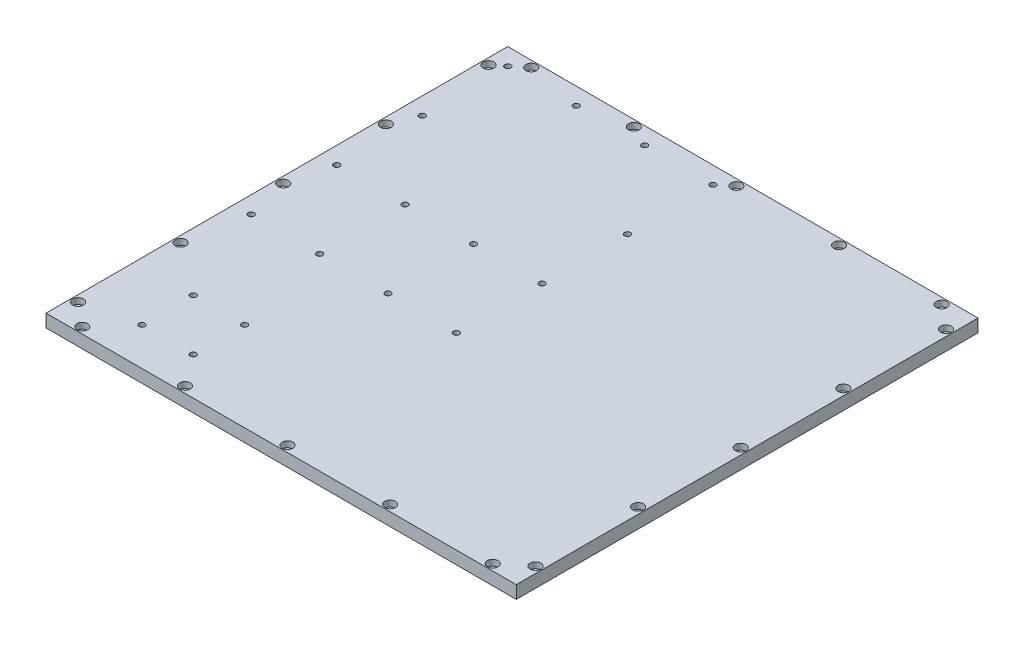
ISO-10303-21;
HEADER;
FILE_DESCRIPTION(('STEP AP214'),'2;1');
FILE_NAME('part.step','',(''),(''),'','','');
FILE_SCHEMA(('AUTOMOTIVE_DESIGN { 1 0 10303 214 1 1 1 1 }'));
ENDSEC;
DATA;
#1=APPLICATION_CONTEXT('core data for automotive mechanical design processes');
#2=APPLICATION_PROTOCOL_DEFINITION('international standard','automotive_design',2000,#1);
#3=PRODUCT_CONTEXT('',#1,'mechanical');
#4=PRODUCT('Part','Part','',(#3));
#5=PRODUCT_RELATED_PRODUCT_CATEGORY('part','',(#4));
#6=PRODUCT_DEFINITION_FORMATION('','',#4);
#7=PRODUCT_DEFINITION_CONTEXT('part definition',#1,'design');
#8=PRODUCT_DEFINITION('design','',#6,#7);
#9=PRODUCT_DEFINITION_SHAPE('','',#8);
#10=(LENGTH_UNIT() NAMED_UNIT(*) SI_UNIT(.MILLI.,.METRE.));
#11=(NAMED_UNIT(*) PLANE_ANGLE_UNIT() SI_UNIT($,.RADIAN.));
#12=(NAMED_UNIT(*) SI_UNIT($,.STERADIAN.) SOLID_ANGLE_UNIT());
#13=UNCERTAINTY_MEASURE_WITH_UNIT(LENGTH_MEASURE(1.E-05),#10,'distance_accuracy_value','');
#14=(GEOMETRIC_REPRESENTATION_CONTEXT(3) GLOBAL_UNCERTAINTY_ASSIGNED_CONTEXT((#13)) GLOBAL_UNIT_ASSIGNED_CONTEXT((#10,
#11,#12)) REPRESENTATION_CONTEXT('',''));
#15=CARTESIAN_POINT('',(0.,0.,0.));
#16=DIRECTION('',(0.,0.,1.));
#17=DIRECTION('',(1.,0.,0.));
#18=AXIS2_PLACEMENT_3D('',#15,#16,#17);
#19=CARTESIAN_POINT('',(174.625,9.525,-171.45));
#20=DIRECTION('',(-1.,0.,0.));
#21=DIRECTION('',(0.,0.,1.));
#22=AXIS2_PLACEMENT_3D('',#19,#20,#21);
#23=PLANE('',#22);
#24=DIRECTION('',(0.,0.,-1.));
#25=VECTOR('',#24,1.);
#26=CARTESIAN_POINT('',(174.625,0.,-171.45));
#27=LINE('',#26,#25);
#28=CARTESIAN_POINT('',(174.625,0.,171.45));
#29=VERTEX_POINT('',#28);
#30=CARTESIAN_POINT('',(174.625,0.,-171.45));
#31=VERTEX_POINT('',#30);
#32=EDGE_CURVE('E97',#29,#31,#27,.T.);
#33=ORIENTED_EDGE('',*,*,#32,.T.);
#34=DIRECTION('',(0.,-1.,0.));
#35=VECTOR('',#34,1.);
#36=CARTESIAN_POINT('',(174.625,9.525,-171.45));
#37=LINE('',#36,#35);
#38=CARTESIAN_POINT('',(174.625,9.525,-171.45));
#39=VERTEX_POINT('',#38);
#40=EDGE_CURVE('E11',#39,#31,#37,.T.);
#41=ORIENTED_EDGE('',*,*,#40,.F.);
#42=DIRECTION('',(0.,0.,-1.));
#43=VECTOR('',#42,1.);
#44=CARTESIAN_POINT('',(174.625,9.525,-171.45));
#45=LINE('',#44,#43);
#46=CARTESIAN_POINT('',(174.625,9.525,171.45));
#47=VERTEX_POINT('',#46);
#48=EDGE_CURVE('E85',#47,#39,#45,.T.);
#49=ORIENTED_EDGE('',*,*,#48,.F.);
#50=DIRECTION('',(0.,-1.,0.));
#51=VECTOR('',#50,1.);
#52=CARTESIAN_POINT('',(174.625,9.525,171.45));
#53=LINE('',#52,#51);
#54=EDGE_CURVE('E93',#47,#29,#53,.T.);
#55=ORIENTED_EDGE('',*,*,#54,.T.);
#56=EDGE_LOOP('',(#33,#41,#49,#55));
#57=FACE_BOUND('',#56,.T.);
#58=ADVANCED_FACE('F34',(#57),#23,.F.);
#59=CARTESIAN_POINT('',(-174.625,9.525,-171.45));
#60=DIRECTION('',(0.,0.,1.));
#61=DIRECTION('',(1.,0.,0.));
#62=AXIS2_PLACEMENT_3D('',#59,#60,#61);
#63=PLANE('',#62);
#64=DIRECTION('',(-1.,0.,0.));
#65=VECTOR('',#64,1.);
#66=CARTESIAN_POINT('',(-174.625,0.,-171.45));
#67=LINE('',#66,#65);
#68=CARTESIAN_POINT('',(-174.625,0.,-171.45));
#69=VERTEX_POINT('',#68);
#70=EDGE_CURVE('E89',#31,#69,#67,.T.);
#71=ORIENTED_EDGE('',*,*,#70,.T.);
#72=DIRECTION('',(0.,-1.,0.));
#73=VECTOR('',#72,1.);
#74=CARTESIAN_POINT('',(-174.625,9.525,-171.45));
#75=LINE('',#74,#73);
#76=CARTESIAN_POINT('',(-174.625,9.525,-171.45));
#77=VERTEX_POINT('',#76);
#78=EDGE_CURVE('E42',#77,#69,#75,.T.);
#79=ORIENTED_EDGE('',*,*,#78,.F.);
#80=DIRECTION('',(-1.,0.,0.));
#81=VECTOR('',#80,1.);
#82=CARTESIAN_POINT('',(-174.625,9.525,-171.45));
#83=LINE('',#82,#81);
#84=EDGE_CURVE('E80',#39,#77,#83,.T.);
#85=ORIENTED_EDGE('',*,*,#84,.F.);
#86=ORIENTED_EDGE('',*,*,#40,.T.);
#87=EDGE_LOOP('',(#71,#79,#85,#86));
#88=FACE_BOUND('',#87,.T.);
#89=ADVANCED_FACE('F88',(#88),#63,.F.);
#90=CARTESIAN_POINT('',(-174.625,9.525,-171.45));
#91=DIRECTION('',(1.,0.,0.));
#92=DIRECTION('',(0.,0.,-1.));
#93=AXIS2_PLACEMENT_3D('',#90,#91,#92);
#94=PLANE('',#93);
#95=DIRECTION('',(0.,0.,1.));
#96=VECTOR('',#95,1.);
#97=CARTESIAN_POINT('',(-174.625,0.,-171.45));
#98=LINE('',#97,#96);
#99=CARTESIAN_POINT('',(-174.625,0.,171.45));
#100=VERTEX_POINT('',#99);
#101=EDGE_CURVE('E67',#69,#100,#98,.T.);
#102=ORIENTED_EDGE('',*,*,#101,.T.);
#103=DIRECTION('',(0.,-1.,0.));
#104=VECTOR('',#103,1.);
#105=CARTESIAN_POINT('',(-174.625,9.525,171.45));
#106=LINE('',#105,#104);
#107=CARTESIAN_POINT('',(-174.625,9.525,171.45));
#108=VERTEX_POINT('',#107);
#109=EDGE_CURVE('E90',#108,#100,#106,.T.);
#110=ORIENTED_EDGE('',*,*,#109,.F.);
#111=DIRECTION('',(0.,0.,1.));
#112=VECTOR('',#111,1.);
#113=CARTESIAN_POINT('',(-174.625,9.525,-171.45));
#114=LINE('',#113,#112);
#115=EDGE_CURVE('E83',#77,#108,#114,.T.);
#116=ORIENTED_EDGE('',*,*,#115,.F.);
#117=ORIENTED_EDGE('',*,*,#78,.T.);
#118=EDGE_LOOP('',(#102,#110,#116,#117));
#119=FACE_BOUND('',#118,.T.);
#120=ADVANCED_FACE('F91',(#119),#94,.F.);
#121=CARTESIAN_POINT('',(-174.625,9.525,171.45));
#122=DIRECTION('',(0.,0.,-1.));
#123=DIRECTION('',(-1.,0.,0.));
#124=AXIS2_PLACEMENT_3D('',#121,#122,#123);
#125=PLANE('',#124);
#126=DIRECTION('',(1.,0.,0.));
#127=VECTOR('',#126,1.);
#128=CARTESIAN_POINT('',(-174.625,0.,171.45));
#129=LINE('',#128,#127);
#130=EDGE_CURVE('E73',#100,#29,#129,.T.);
#131=ORIENTED_EDGE('',*,*,#130,.T.);
#132=ORIENTED_EDGE('',*,*,#54,.F.);
#133=DIRECTION('',(1.,0.,0.));
#134=VECTOR('',#133,1.);
#135=CARTESIAN_POINT('',(-174.625,9.525,171.45));
#136=LINE('',#135,#134);
#137=EDGE_CURVE('E50',#108,#47,#136,.T.);
#138=ORIENTED_EDGE('',*,*,#137,.F.);
#139=ORIENTED_EDGE('',*,*,#109,.T.);
#140=EDGE_LOOP('',(#131,#132,#138,#139));
#141=FACE_BOUND('',#140,.T.);
#142=ADVANCED_FACE('F105',(#141),#125,.F.);
#143=CARTESIAN_POINT('',(0.,9.525,0.));
#144=DIRECTION('',(0.,1.,0.));
#145=DIRECTION('',(0.,0.,1.));
#146=AXIS2_PLACEMENT_3D('',#143,#144,#145);
#147=PLANE('',#146);
#148=CARTESIAN_POINT('',(-93.3530106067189,9.525,143.372057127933));
#149=DIRECTION('',(0.,1.,0.));
#150=DIRECTION('',(0.,0.,1.));
#151=AXIS2_PLACEMENT_3D('',#148,#149,#150);
#152=CIRCLE('',#151,2.19709999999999);
#153=CARTESIAN_POINT('',(-93.3530106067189,9.525,145.569157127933));
#154=VERTEX_POINT('',#153);
#155=EDGE_CURVE('E448',#154,#154,#152,.T.);
#156=ORIENTED_EDGE('',*,*,#155,.F.);
#157=EDGE_LOOP('',(#156));
#158=FACE_BOUND('',#157,.T.);
#159=CARTESIAN_POINT('',(-131.453010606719,9.525,105.272057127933));
#160=DIRECTION('',(0.,1.,0.));
#161=DIRECTION('',(0.,0.,1.));
#162=AXIS2_PLACEMENT_3D('',#159,#160,#161);
#163=CIRCLE('',#162,2.1971);
#164=CARTESIAN_POINT('',(-131.453010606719,9.525,107.469157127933));
#165=VERTEX_POINT('',#164);
#166=EDGE_CURVE('E441',#165,#165,#163,.T.);
#167=ORIENTED_EDGE('',*,*,#166,.F.);
#168=EDGE_LOOP('',(#167));
#169=FACE_BOUND('',#168,.T.);
#170=CARTESIAN_POINT('',(-131.453010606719,9.525,143.372057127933));
#171=DIRECTION('',(0.,1.,0.));
#172=DIRECTION('',(0.,0.,1.));
#173=AXIS2_PLACEMENT_3D('',#170,#171,#172);
#174=CIRCLE('',#173,2.1971);
#175=CARTESIAN_POINT('',(-131.453010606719,9.525,145.569157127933));
#176=VERTEX_POINT('',#175);
#177=EDGE_CURVE('E453',#176,#176,#174,.T.);
#178=ORIENTED_EDGE('',*,*,#177,.F.);
#179=EDGE_LOOP('',(#178));
#180=FACE_BOUND('',#179,.T.);
#181=CARTESIAN_POINT('',(-93.3530106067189,9.525,105.272057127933));
#182=DIRECTION('',(0.,1.,0.));
#183=DIRECTION('',(0.,0.,1.));
#184=AXIS2_PLACEMENT_3D('',#181,#182,#183);
#185=CIRCLE('',#184,2.1971);
#186=CARTESIAN_POINT('',(-93.3530106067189,9.525,107.469157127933));
#187=VERTEX_POINT('',#186);
#188=EDGE_CURVE('E435',#187,#187,#185,.T.);
#189=ORIENTED_EDGE('',*,*,#188,.F.);
#190=EDGE_LOOP('',(#189));
#191=FACE_BOUND('',#190,.T.);
#192=CARTESIAN_POINT('',(-60.325,9.525,-31.7499999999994));
#193=DIRECTION('',(0.,1.,0.));
#194=DIRECTION('',(0.,0.,1.));
#195=AXIS2_PLACEMENT_3D('',#192,#193,#194);
#196=CIRCLE('',#195,2.1971);
#197=CARTESIAN_POINT('',(-60.325,9.525,-29.5528999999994));
#198=VERTEX_POINT('',#197);
#199=EDGE_CURVE('E381',#198,#198,#196,.T.);
#200=ORIENTED_EDGE('',*,*,#199,.F.);
#201=EDGE_LOOP('',(#200));
#202=FACE_BOUND('',#201,.T.);
#203=CARTESIAN_POINT('',(-111.125,9.525,-31.7499999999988));
#204=DIRECTION('',(0.,1.,0.));
#205=DIRECTION('',(0.,0.,1.));
#206=AXIS2_PLACEMENT_3D('',#203,#204,#205);
#207=CIRCLE('',#206,2.1971);
#208=CARTESIAN_POINT('',(-111.125,9.525,-29.5528999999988));
#209=VERTEX_POINT('',#208);
#210=EDGE_CURVE('E388',#209,#209,#207,.T.);
#211=ORIENTED_EDGE('',*,*,#210,.F.);
#212=EDGE_LOOP('',(#211));
#213=FACE_BOUND('',#212,.T.);
#214=CARTESIAN_POINT('',(-161.925,9.525,-31.7499999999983));
#215=DIRECTION('',(0.,1.,0.));
#216=DIRECTION('',(0.,0.,1.));
#217=AXIS2_PLACEMENT_3D('',#214,#215,#216);
#218=CIRCLE('',#217,2.1971);
#219=CARTESIAN_POINT('',(-161.925,9.525,-29.5528999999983));
#220=VERTEX_POINT('',#219);
#221=EDGE_CURVE('E394',#220,#220,#218,.T.);
#222=ORIENTED_EDGE('',*,*,#221,.F.);
#223=EDGE_LOOP('',(#222));
#224=FACE_BOUND('',#223,.T.);
#225=CARTESIAN_POINT('',(-161.925,9.525,-95.2499999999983));
#226=DIRECTION('',(0.,1.,0.));
#227=DIRECTION('',(0.,0.,1.));
#228=AXIS2_PLACEMENT_3D('',#225,#226,#227);
#229=CIRCLE('',#228,2.1971);
#230=CARTESIAN_POINT('',(-161.925,9.525,-93.0528999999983));
#231=VERTEX_POINT('',#230);
#232=EDGE_CURVE('E400',#231,#231,#229,.T.);
#233=ORIENTED_EDGE('',*,*,#232,.F.);
#234=EDGE_LOOP('',(#233));
#235=FACE_BOUND('',#234,.T.);
#236=CARTESIAN_POINT('',(-60.3250000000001,9.525,-158.749999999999));
#237=DIRECTION('',(0.,1.,0.));
#238=DIRECTION('',(0.,0.,1.));
#239=AXIS2_PLACEMENT_3D('',#236,#237,#238);
#240=CIRCLE('',#239,2.19709999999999);
#241=CARTESIAN_POINT('',(-60.3250000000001,9.525,-156.552899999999));
#242=VERTEX_POINT('',#241);
#243=EDGE_CURVE('E364',#242,#242,#240,.T.);
#244=ORIENTED_EDGE('',*,*,#243,.F.);
#245=EDGE_LOOP('',(#244));
#246=FACE_BOUND('',#245,.T.);
#247=CARTESIAN_POINT('',(-111.125,9.525,-158.749999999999));
#248=DIRECTION('',(0.,1.,0.));
#249=DIRECTION('',(0.,0.,1.));
#250=AXIS2_PLACEMENT_3D('',#247,#248,#249);
#251=CIRCLE('',#250,2.19709999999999);
#252=CARTESIAN_POINT('',(-111.125,9.525,-156.552899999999));
#253=VERTEX_POINT('',#252);
#254=EDGE_CURVE('E357',#253,#253,#251,.T.);
#255=ORIENTED_EDGE('',*,*,#254,.F.);
#256=EDGE_LOOP('',(#255));
#257=FACE_BOUND('',#256,.T.);
#258=CARTESIAN_POINT('',(-161.925,9.525,-158.749999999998));
#259=DIRECTION('',(0.,1.,0.));
#260=DIRECTION('',(0.,0.,1.));
#261=AXIS2_PLACEMENT_3D('',#258,#259,#260);
#262=CIRCLE('',#261,2.1971);
#263=CARTESIAN_POINT('',(-161.925,9.525,-156.552899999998));
#264=VERTEX_POINT('',#263);
#265=EDGE_CURVE('E376',#264,#264,#262,.T.);
#266=ORIENTED_EDGE('',*,*,#265,.F.);
#267=EDGE_LOOP('',(#266));
#268=FACE_BOUND('',#267,.T.);
#269=CARTESIAN_POINT('',(-9.52500000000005,9.525,-95.2499999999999));
#270=DIRECTION('',(0.,1.,0.));
#271=DIRECTION('',(0.,0.,1.));
#272=AXIS2_PLACEMENT_3D('',#269,#270,#271);
#273=CIRCLE('',#272,2.1971);
#274=CARTESIAN_POINT('',(-9.52500000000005,9.525,-93.0528999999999));
#275=VERTEX_POINT('',#274);
#276=EDGE_CURVE('E369',#275,#275,#273,.T.);
#277=ORIENTED_EDGE('',*,*,#276,.F.);
#278=EDGE_LOOP('',(#277));
#279=FACE_BOUND('',#278,.T.);
#280=CARTESIAN_POINT('',(-9.52499999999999,9.525,31.7500000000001));
#281=DIRECTION('',(0.,1.,0.));
#282=DIRECTION('',(0.,0.,1.));
#283=AXIS2_PLACEMENT_3D('',#280,#281,#282);
#284=CIRCLE('',#283,2.1971);
#285=CARTESIAN_POINT('',(-9.52499999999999,9.525,33.9471000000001));
#286=VERTEX_POINT('',#285);
#287=EDGE_CURVE('E429',#286,#286,#284,.T.);
#288=ORIENTED_EDGE('',*,*,#287,.F.);
#289=EDGE_LOOP('',(#288));
#290=FACE_BOUND('',#289,.T.);
#291=CARTESIAN_POINT('',(-9.52500000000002,9.525,-31.7499999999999));
#292=DIRECTION('',(0.,1.,0.));
#293=DIRECTION('',(0.,0.,1.));
#294=AXIS2_PLACEMENT_3D('',#291,#292,#293);
#295=CIRCLE('',#294,2.1971);
#296=CARTESIAN_POINT('',(-9.52500000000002,9.525,-29.5528999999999));
#297=VERTEX_POINT('',#296);
#298=EDGE_CURVE('E412',#297,#297,#295,.T.);
#299=ORIENTED_EDGE('',*,*,#298,.F.);
#300=EDGE_LOOP('',(#299));
#301=FACE_BOUND('',#300,.T.);
#302=CARTESIAN_POINT('',(-161.925,9.525,31.7500000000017));
#303=DIRECTION('',(0.,1.,0.));
#304=DIRECTION('',(0.,0.,1.));
#305=AXIS2_PLACEMENT_3D('',#302,#303,#304);
#306=CIRCLE('',#305,2.1971);
#307=CARTESIAN_POINT('',(-161.925,9.525,33.9471000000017));
#308=VERTEX_POINT('',#307);
#309=EDGE_CURVE('E405',#308,#308,#306,.T.);
#310=ORIENTED_EDGE('',*,*,#309,.F.);
#311=EDGE_LOOP('',(#310));
#312=FACE_BOUND('',#311,.T.);
#313=CARTESIAN_POINT('',(-111.125,9.525,31.7500000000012));
#314=DIRECTION('',(0.,1.,0.));
#315=DIRECTION('',(0.,0.,1.));
#316=AXIS2_PLACEMENT_3D('',#313,#314,#315);
#317=CIRCLE('',#316,2.1971);
#318=CARTESIAN_POINT('',(-111.125,9.525,33.9471000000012));
#319=VERTEX_POINT('',#318);
#320=EDGE_CURVE('E424',#319,#319,#317,.T.);
#321=ORIENTED_EDGE('',*,*,#320,.F.);
#322=EDGE_LOOP('',(#321));
#323=FACE_BOUND('',#322,.T.);
#324=CARTESIAN_POINT('',(-60.325,9.525,31.7500000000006));
#325=DIRECTION('',(0.,1.,0.));
#326=DIRECTION('',(0.,0.,1.));
#327=AXIS2_PLACEMENT_3D('',#324,#325,#326);
#328=CIRCLE('',#327,2.1971);
#329=CARTESIAN_POINT('',(-60.325,9.525,33.9471000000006));
#330=VERTEX_POINT('',#329);
#331=EDGE_CURVE('E417',#330,#330,#328,.T.);
#332=ORIENTED_EDGE('',*,*,#331,.F.);
#333=EDGE_LOOP('',(#332));
#334=FACE_BOUND('',#333,.T.);
#335=CARTESIAN_POINT('',(-9.52500000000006,9.525,-158.75));
#336=DIRECTION('',(0.,1.,0.));
#337=DIRECTION('',(0.,0.,1.));
#338=AXIS2_PLACEMENT_3D('',#335,#336,#337);
#339=CIRCLE('',#338,2.1971);
#340=CARTESIAN_POINT('',(-9.52500000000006,9.525,-156.5529));
#341=VERTEX_POINT('',#340);
#342=EDGE_CURVE('E351',#341,#341,#339,.T.);
#343=ORIENTED_EDGE('',*,*,#342,.F.);
#344=EDGE_LOOP('',(#343));
#345=FACE_BOUND('',#344,.T.);
#346=CARTESIAN_POINT('',(-169.862500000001,9.525,-152.4));
#347=DIRECTION('',(0.,1.,0.));
#348=DIRECTION('',(0.,0.,1.));
#349=AXIS2_PLACEMENT_3D('',#346,#347,#348);
#350=CIRCLE('',#349,3.96874999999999);
#351=CARTESIAN_POINT('',(-169.862500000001,9.525,-148.43125));
#352=VERTEX_POINT('',#351);
#353=EDGE_CURVE('E347',#352,#352,#350,.T.);
#354=ORIENTED_EDGE('',*,*,#353,.F.);
#355=EDGE_LOOP('',(#354));
#356=FACE_BOUND('',#355,.T.);
#357=CARTESIAN_POINT('',(-169.8625,9.525,-76.2000000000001));
#358=DIRECTION('',(0.,1.,0.));
#359=DIRECTION('',(0.,0.,1.));
#360=AXIS2_PLACEMENT_3D('',#357,#358,#359);
#361=CIRCLE('',#360,3.96874999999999);
#362=CARTESIAN_POINT('',(-169.8625,9.525,-72.2312500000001));
#363=VERTEX_POINT('',#362);
#364=EDGE_CURVE('E335',#363,#363,#361,.T.);
#365=ORIENTED_EDGE('',*,*,#364,.F.);
#366=EDGE_LOOP('',(#365));
#367=FACE_BOUND('',#366,.T.);
#368=CARTESIAN_POINT('',(-169.8625,9.525,0.));
#369=DIRECTION('',(0.,1.,0.));
#370=DIRECTION('',(0.,0.,1.));
#371=AXIS2_PLACEMENT_3D('',#368,#369,#370);
#372=CIRCLE('',#371,3.96874999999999);
#373=CARTESIAN_POINT('',(-169.8625,9.525,3.96874999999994));
#374=VERTEX_POINT('',#373);
#375=EDGE_CURVE('E323',#374,#374,#372,.T.);
#376=ORIENTED_EDGE('',*,*,#375,.F.);
#377=EDGE_LOOP('',(#376));
#378=FACE_BOUND('',#377,.T.);
#379=CARTESIAN_POINT('',(-169.862499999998,9.525,76.1999999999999));
#380=DIRECTION('',(0.,1.,0.));
#381=DIRECTION('',(0.,0.,1.));
#382=AXIS2_PLACEMENT_3D('',#379,#380,#381);
#383=CIRCLE('',#382,3.96874999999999);
#384=CARTESIAN_POINT('',(-169.862499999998,9.525,80.1687499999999));
#385=VERTEX_POINT('',#384);
#386=EDGE_CURVE('E311',#385,#385,#383,.T.);
#387=ORIENTED_EDGE('',*,*,#386,.F.);
#388=EDGE_LOOP('',(#387));
#389=FACE_BOUND('',#388,.T.);
#390=CARTESIAN_POINT('',(-169.862499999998,9.525,152.4));
#391=DIRECTION('',(0.,1.,0.));
#392=DIRECTION('',(0.,0.,1.));
#393=AXIS2_PLACEMENT_3D('',#390,#391,#392);
#394=CIRCLE('',#393,3.96874999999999);
#395=CARTESIAN_POINT('',(-169.862499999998,9.525,156.36875));
#396=VERTEX_POINT('',#395);
#397=EDGE_CURVE('E299',#396,#396,#394,.T.);
#398=ORIENTED_EDGE('',*,*,#397,.F.);
#399=EDGE_LOOP('',(#398));
#400=FACE_BOUND('',#399,.T.);
#401=CARTESIAN_POINT('',(-152.4,9.525,166.687500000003));
#402=DIRECTION('',(0.,1.,0.));
#403=DIRECTION('',(0.,0.,1.));
#404=AXIS2_PLACEMENT_3D('',#401,#402,#403);
#405=CIRCLE('',#404,3.96874999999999);
#406=CARTESIAN_POINT('',(-152.4,9.525,170.656250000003));
#407=VERTEX_POINT('',#406);
#408=EDGE_CURVE('E287',#407,#407,#405,.T.);
#409=ORIENTED_EDGE('',*,*,#408,.F.);
#410=EDGE_LOOP('',(#409));
#411=FACE_BOUND('',#410,.T.);
#412=CARTESIAN_POINT('',(-76.2,9.525,166.687500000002));
#413=DIRECTION('',(0.,1.,0.));
#414=DIRECTION('',(0.,0.,1.));
#415=AXIS2_PLACEMENT_3D('',#412,#413,#414);
#416=CIRCLE('',#415,3.96874999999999);
#417=CARTESIAN_POINT('',(-76.2,9.525,170.656250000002));
#418=VERTEX_POINT('',#417);
#419=EDGE_CURVE('E275',#418,#418,#416,.T.);
#420=ORIENTED_EDGE('',*,*,#419,.F.);
#421=EDGE_LOOP('',(#420));
#422=FACE_BOUND('',#421,.T.);
#423=CARTESIAN_POINT('',(0.,9.525,166.6875));
#424=DIRECTION('',(0.,1.,0.));
#425=DIRECTION('',(0.,0.,1.));
#426=AXIS2_PLACEMENT_3D('',#423,#424,#425);
#427=CIRCLE('',#426,3.96875);
#428=CARTESIAN_POINT('',(0.,9.525,170.65625));
#429=VERTEX_POINT('',#428);
#430=EDGE_CURVE('E263',#429,#429,#427,.T.);
#431=ORIENTED_EDGE('',*,*,#430,.F.);
#432=EDGE_LOOP('',(#431));
#433=FACE_BOUND('',#432,.T.);
#434=CARTESIAN_POINT('',(-152.400000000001,9.525,-166.6875));
#435=DIRECTION('',(0.,1.,0.));
#436=DIRECTION('',(0.,0.,1.));
#437=AXIS2_PLACEMENT_3D('',#434,#435,#436);
#438=CIRCLE('',#437,3.96874999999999);
#439=CARTESIAN_POINT('',(-152.400000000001,9.525,-162.71875));
#440=VERTEX_POINT('',#439);
#441=EDGE_CURVE('E251',#440,#440,#438,.T.);
#442=ORIENTED_EDGE('',*,*,#441,.F.);
#443=EDGE_LOOP('',(#442));
#444=FACE_BOUND('',#443,.T.);
#445=CARTESIAN_POINT('',(-76.2000000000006,9.525,-166.687499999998));
#446=DIRECTION('',(0.,1.,0.));
#447=DIRECTION('',(0.,0.,1.));
#448=AXIS2_PLACEMENT_3D('',#445,#446,#447);
#449=CIRCLE('',#448,3.96874999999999);
#450=CARTESIAN_POINT('',(-76.2000000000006,9.525,-162.718749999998));
#451=VERTEX_POINT('',#450);
#452=EDGE_CURVE('E239',#451,#451,#449,.T.);
#453=ORIENTED_EDGE('',*,*,#452,.F.);
#454=EDGE_LOOP('',(#453));
#455=FACE_BOUND('',#454,.T.);
#456=CARTESIAN_POINT('',(0.,9.525,-166.6875));
#457=DIRECTION('',(0.,1.,0.));
#458=DIRECTION('',(0.,0.,1.));
#459=AXIS2_PLACEMENT_3D('',#456,#457,#458);
#460=CIRCLE('',#459,3.96875);
#461=CARTESIAN_POINT('',(0.,9.525,-162.71875));
#462=VERTEX_POINT('',#461);
#463=EDGE_CURVE('E227',#462,#462,#460,.T.);
#464=ORIENTED_EDGE('',*,*,#463,.F.);
#465=EDGE_LOOP('',(#464));
#466=FACE_BOUND('',#465,.T.);
#467=CARTESIAN_POINT('',(76.1999999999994,9.525,-166.687499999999));
#468=DIRECTION('',(0.,1.,0.));
#469=DIRECTION('',(0.,0.,1.));
#470=AXIS2_PLACEMENT_3D('',#467,#468,#469);
#471=CIRCLE('',#470,3.96874999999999);
#472=CARTESIAN_POINT('',(76.1999999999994,9.525,-162.718749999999));
#473=VERTEX_POINT('',#472);
#474=EDGE_CURVE('E215',#473,#473,#471,.T.);
#475=ORIENTED_EDGE('',*,*,#474,.F.);
#476=EDGE_LOOP('',(#475));
#477=FACE_BOUND('',#476,.T.);
#478=CARTESIAN_POINT('',(152.4,9.525,-166.6875));
#479=DIRECTION('',(0.,1.,0.));
#480=DIRECTION('',(0.,0.,1.));
#481=AXIS2_PLACEMENT_3D('',#478,#479,#480);
#482=CIRCLE('',#481,3.96874999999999);
#483=CARTESIAN_POINT('',(152.4,9.525,-162.71875));
#484=VERTEX_POINT('',#483);
#485=EDGE_CURVE('E203',#484,#484,#482,.T.);
#486=ORIENTED_EDGE('',*,*,#485,.F.);
#487=EDGE_LOOP('',(#486));
#488=FACE_BOUND('',#487,.T.);
#489=CARTESIAN_POINT('',(169.862500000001,9.525,-152.4));
#490=DIRECTION('',(0.,1.,0.));
#491=DIRECTION('',(0.,0.,1.));
#492=AXIS2_PLACEMENT_3D('',#489,#490,#491);
#493=CIRCLE('',#492,3.96874999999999);
#494=CARTESIAN_POINT('',(169.862500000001,9.525,-148.43125));
#495=VERTEX_POINT('',#494);
#496=EDGE_CURVE('E191',#495,#495,#493,.T.);
#497=ORIENTED_EDGE('',*,*,#496,.F.);
#498=EDGE_LOOP('',(#497));
#499=FACE_BOUND('',#498,.T.);
#500=CARTESIAN_POINT('',(169.862500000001,9.525,-76.2));
#501=DIRECTION('',(0.,1.,0.));
#502=DIRECTION('',(0.,0.,1.));
#503=AXIS2_PLACEMENT_3D('',#500,#501,#502);
#504=CIRCLE('',#503,3.96874999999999);
#505=CARTESIAN_POINT('',(169.862500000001,9.525,-72.23125));
#506=VERTEX_POINT('',#505);
#507=EDGE_CURVE('E179',#506,#506,#504,.T.);
#508=ORIENTED_EDGE('',*,*,#507,.F.);
#509=EDGE_LOOP('',(#508));
#510=FACE_BOUND('',#509,.T.);
#511=CARTESIAN_POINT('',(169.8625,9.525,-1.11022302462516E-13));
#512=DIRECTION('',(0.,1.,0.));
#513=DIRECTION('',(0.,0.,1.));
#514=AXIS2_PLACEMENT_3D('',#511,#512,#513);
#515=CIRCLE('',#514,3.96874999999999);
#516=CARTESIAN_POINT('',(169.8625,9.525,3.96874999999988));
#517=VERTEX_POINT('',#516);
#518=EDGE_CURVE('E167',#517,#517,#515,.T.);
#519=ORIENTED_EDGE('',*,*,#518,.F.);
#520=EDGE_LOOP('',(#519));
#521=FACE_BOUND('',#520,.T.);
#522=CARTESIAN_POINT('',(169.862500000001,9.525,76.2));
#523=DIRECTION('',(0.,1.,0.));
#524=DIRECTION('',(0.,0.,1.));
#525=AXIS2_PLACEMENT_3D('',#522,#523,#524);
#526=CIRCLE('',#525,3.96874999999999);
#527=CARTESIAN_POINT('',(169.862500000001,9.525,80.16875));
#528=VERTEX_POINT('',#527);
#529=EDGE_CURVE('E155',#528,#528,#526,.T.);
#530=ORIENTED_EDGE('',*,*,#529,.F.);
#531=EDGE_LOOP('',(#530));
#532=FACE_BOUND('',#531,.T.);
#533=CARTESIAN_POINT('',(76.2,9.525,166.6875));
#534=DIRECTION('',(0.,1.,0.));
#535=DIRECTION('',(0.,0.,1.));
#536=AXIS2_PLACEMENT_3D('',#533,#534,#535);
#537=CIRCLE('',#536,3.96874999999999);
#538=CARTESIAN_POINT('',(76.2,9.525,170.65625));
#539=VERTEX_POINT('',#538);
#540=EDGE_CURVE('E143',#539,#539,#537,.T.);
#541=ORIENTED_EDGE('',*,*,#540,.F.);
#542=EDGE_LOOP('',(#541));
#543=FACE_BOUND('',#542,.T.);
#544=CARTESIAN_POINT('',(152.4,9.525,166.6875));
#545=DIRECTION('',(0.,1.,0.));
#546=DIRECTION('',(0.,0.,1.));
#547=AXIS2_PLACEMENT_3D('',#544,#545,#546);
#548=CIRCLE('',#547,3.96874999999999);
#549=CARTESIAN_POINT('',(152.4,9.525,170.65625));
#550=VERTEX_POINT('',#549);
#551=EDGE_CURVE('E131',#550,#550,#548,.T.);
#552=ORIENTED_EDGE('',*,*,#551,.F.);
#553=EDGE_LOOP('',(#552));
#554=FACE_BOUND('',#553,.T.);
#555=CARTESIAN_POINT('',(169.862499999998,9.525,152.4));
#556=DIRECTION('',(0.,1.,0.));
#557=DIRECTION('',(0.,0.,1.));
#558=AXIS2_PLACEMENT_3D('',#555,#556,#557);
#559=CIRCLE('',#558,3.96874999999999);
#560=CARTESIAN_POINT('',(169.862499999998,9.525,156.36875));
#561=VERTEX_POINT('',#560);
#562=EDGE_CURVE('E119',#561,#561,#559,.T.);
#563=ORIENTED_EDGE('',*,*,#562,.F.);
#564=EDGE_LOOP('',(#563));
#565=FACE_BOUND('',#564,.T.);
#566=ORIENTED_EDGE('',*,*,#48,.T.);
#567=ORIENTED_EDGE('',*,*,#84,.T.);
#568=ORIENTED_EDGE('',*,*,#115,.T.);
#569=ORIENTED_EDGE('',*,*,#137,.T.);
#570=EDGE_LOOP('',(#566,#567,#568,#569));
#571=FACE_BOUND('',#570,.T.);
#572=ADVANCED_FACE('F81',(#158,#169,#180,#191,#202,#213,#224,#235,#246,#257,#268,#279,#290,#301,
#312,#323,#334,#345,#356,#367,#378,#389,#400,#411,#422,#433,#444,#455,#466,#477,#488,#499,#510,
#521,#532,#543,#554,#565,#571),#147,.T.);
#573=CARTESIAN_POINT('',(0.,0.,0.));
#574=DIRECTION('',(0.,1.,0.));
#575=DIRECTION('',(0.,0.,1.));
#576=AXIS2_PLACEMENT_3D('',#573,#574,#575);
#577=PLANE('',#576);
#578=CARTESIAN_POINT('',(-93.3530106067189,0.,143.372057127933));
#579=DIRECTION('',(0.,1.,0.));
#580=DIRECTION('',(0.,0.,1.));
#581=AXIS2_PLACEMENT_3D('',#578,#579,#580);
#582=CIRCLE('',#581,2.19709999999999);
#583=CARTESIAN_POINT('',(-93.3530106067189,0.,145.569157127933));
#584=VERTEX_POINT('',#583);
#585=EDGE_CURVE('E438',#584,#584,#582,.T.);
#586=ORIENTED_EDGE('',*,*,#585,.T.);
#587=EDGE_LOOP('',(#586));
#588=FACE_BOUND('',#587,.T.);
#589=CARTESIAN_POINT('',(-131.453010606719,0.,105.272057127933));
#590=DIRECTION('',(0.,1.,0.));
#591=DIRECTION('',(0.,0.,1.));
#592=AXIS2_PLACEMENT_3D('',#589,#590,#591);
#593=CIRCLE('',#592,2.1971);
#594=CARTESIAN_POINT('',(-131.453010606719,0.,107.469157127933));
#595=VERTEX_POINT('',#594);
#596=EDGE_CURVE('E444',#595,#595,#593,.T.);
#597=ORIENTED_EDGE('',*,*,#596,.T.);
#598=EDGE_LOOP('',(#597));
#599=FACE_BOUND('',#598,.T.);
#600=CARTESIAN_POINT('',(-131.453010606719,0.,143.372057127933));
#601=DIRECTION('',(0.,1.,0.));
#602=DIRECTION('',(0.,0.,1.));
#603=AXIS2_PLACEMENT_3D('',#600,#601,#602);
#604=CIRCLE('',#603,2.1971);
#605=CARTESIAN_POINT('',(-131.453010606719,0.,145.569157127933));
#606=VERTEX_POINT('',#605);
#607=EDGE_CURVE('E445',#606,#606,#604,.T.);
#608=ORIENTED_EDGE('',*,*,#607,.T.);
#609=EDGE_LOOP('',(#608));
#610=FACE_BOUND('',#609,.T.);
#611=CARTESIAN_POINT('',(-93.3530106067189,0.,105.272057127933));
#612=DIRECTION('',(0.,1.,0.));
#613=DIRECTION('',(0.,0.,1.));
#614=AXIS2_PLACEMENT_3D('',#611,#612,#613);
#615=CIRCLE('',#614,2.1971);
#616=CARTESIAN_POINT('',(-93.3530106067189,0.,107.469157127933));
#617=VERTEX_POINT('',#616);
#618=EDGE_CURVE('E432',#617,#617,#615,.T.);
#619=ORIENTED_EDGE('',*,*,#618,.T.);
#620=EDGE_LOOP('',(#619));
#621=FACE_BOUND('',#620,.T.);
#622=CARTESIAN_POINT('',(-60.325,0.,-31.7499999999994));
#623=DIRECTION('',(0.,1.,0.));
#624=DIRECTION('',(0.,0.,1.));
#625=AXIS2_PLACEMENT_3D('',#622,#623,#624);
#626=CIRCLE('',#625,2.1971);
#627=CARTESIAN_POINT('',(-60.325,0.,-29.5528999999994));
#628=VERTEX_POINT('',#627);
#629=EDGE_CURVE('E384',#628,#628,#626,.T.);
#630=ORIENTED_EDGE('',*,*,#629,.T.);
#631=EDGE_LOOP('',(#630));
#632=FACE_BOUND('',#631,.T.);
#633=CARTESIAN_POINT('',(-111.125,0.,-31.7499999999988));
#634=DIRECTION('',(0.,1.,0.));
#635=DIRECTION('',(0.,0.,1.));
#636=AXIS2_PLACEMENT_3D('',#633,#634,#635);
#637=CIRCLE('',#636,2.1971);
#638=CARTESIAN_POINT('',(-111.125,0.,-29.5528999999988));
#639=VERTEX_POINT('',#638);
#640=EDGE_CURVE('E391',#639,#639,#637,.T.);
#641=ORIENTED_EDGE('',*,*,#640,.T.);
#642=EDGE_LOOP('',(#641));
#643=FACE_BOUND('',#642,.T.);
#644=CARTESIAN_POINT('',(-161.925,0.,-31.7499999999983));
#645=DIRECTION('',(0.,1.,0.));
#646=DIRECTION('',(0.,0.,1.));
#647=AXIS2_PLACEMENT_3D('',#644,#645,#646);
#648=CIRCLE('',#647,2.1971);
#649=CARTESIAN_POINT('',(-161.925,0.,-29.5528999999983));
#650=VERTEX_POINT('',#649);
#651=EDGE_CURVE('E397',#650,#650,#648,.T.);
#652=ORIENTED_EDGE('',*,*,#651,.T.);
#653=EDGE_LOOP('',(#652));
#654=FACE_BOUND('',#653,.T.);
#655=CARTESIAN_POINT('',(-161.925,0.,-95.2499999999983));
#656=DIRECTION('',(0.,1.,0.));
#657=DIRECTION('',(0.,0.,1.));
#658=AXIS2_PLACEMENT_3D('',#655,#656,#657);
#659=CIRCLE('',#658,2.1971);
#660=CARTESIAN_POINT('',(-161.925,0.,-93.0528999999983));
#661=VERTEX_POINT('',#660);
#662=EDGE_CURVE('E373',#661,#661,#659,.T.);
#663=ORIENTED_EDGE('',*,*,#662,.T.);
#664=EDGE_LOOP('',(#663));
#665=FACE_BOUND('',#664,.T.);
#666=CARTESIAN_POINT('',(-60.3250000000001,0.,-158.749999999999));
#667=DIRECTION('',(0.,1.,0.));
#668=DIRECTION('',(0.,0.,1.));
#669=AXIS2_PLACEMENT_3D('',#666,#667,#668);
#670=CIRCLE('',#669,2.19709999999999);
#671=CARTESIAN_POINT('',(-60.3250000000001,0.,-156.552899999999));
#672=VERTEX_POINT('',#671);
#673=EDGE_CURVE('E354',#672,#672,#670,.T.);
#674=ORIENTED_EDGE('',*,*,#673,.T.);
#675=EDGE_LOOP('',(#674));
#676=FACE_BOUND('',#675,.T.);
#677=CARTESIAN_POINT('',(-111.125,0.,-158.749999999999));
#678=DIRECTION('',(0.,1.,0.));
#679=DIRECTION('',(0.,0.,1.));
#680=AXIS2_PLACEMENT_3D('',#677,#678,#679);
#681=CIRCLE('',#680,2.19709999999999);
#682=CARTESIAN_POINT('',(-111.125,0.,-156.552899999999));
#683=VERTEX_POINT('',#682);
#684=EDGE_CURVE('E360',#683,#683,#681,.T.);
#685=ORIENTED_EDGE('',*,*,#684,.T.);
#686=EDGE_LOOP('',(#685));
#687=FACE_BOUND('',#686,.T.);
#688=CARTESIAN_POINT('',(-161.925,0.,-158.749999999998));
#689=DIRECTION('',(0.,1.,0.));
#690=DIRECTION('',(0.,0.,1.));
#691=AXIS2_PLACEMENT_3D('',#688,#689,#690);
#692=CIRCLE('',#691,2.1971);
#693=CARTESIAN_POINT('',(-161.925,0.,-156.552899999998));
#694=VERTEX_POINT('',#693);
#695=EDGE_CURVE('E361',#694,#694,#692,.T.);
#696=ORIENTED_EDGE('',*,*,#695,.T.);
#697=EDGE_LOOP('',(#696));
#698=FACE_BOUND('',#697,.T.);
#699=CARTESIAN_POINT('',(-9.52500000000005,0.,-95.2499999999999));
#700=DIRECTION('',(0.,1.,0.));
#701=DIRECTION('',(0.,0.,1.));
#702=AXIS2_PLACEMENT_3D('',#699,#700,#701);
#703=CIRCLE('',#702,2.1971);
#704=CARTESIAN_POINT('',(-9.52500000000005,0.,-93.0528999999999));
#705=VERTEX_POINT('',#704);
#706=EDGE_CURVE('E372',#705,#705,#703,.T.);
#707=ORIENTED_EDGE('',*,*,#706,.T.);
#708=EDGE_LOOP('',(#707));
#709=FACE_BOUND('',#708,.T.);
#710=CARTESIAN_POINT('',(-9.52499999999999,0.,31.7500000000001));
#711=DIRECTION('',(0.,1.,0.));
#712=DIRECTION('',(0.,0.,1.));
#713=AXIS2_PLACEMENT_3D('',#710,#711,#712);
#714=CIRCLE('',#713,2.1971);
#715=CARTESIAN_POINT('',(-9.52499999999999,0.,33.9471000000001));
#716=VERTEX_POINT('',#715);
#717=EDGE_CURVE('E421',#716,#716,#714,.T.);
#718=ORIENTED_EDGE('',*,*,#717,.T.);
#719=EDGE_LOOP('',(#718));
#720=FACE_BOUND('',#719,.T.);
#721=CARTESIAN_POINT('',(-9.52500000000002,0.,-31.7499999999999));
#722=DIRECTION('',(0.,1.,0.));
#723=DIRECTION('',(0.,0.,1.));
#724=AXIS2_PLACEMENT_3D('',#721,#722,#723);
#725=CIRCLE('',#724,2.1971);
#726=CARTESIAN_POINT('',(-9.52500000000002,0.,-29.5528999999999));
#727=VERTEX_POINT('',#726);
#728=EDGE_CURVE('E385',#727,#727,#725,.T.);
#729=ORIENTED_EDGE('',*,*,#728,.T.);
#730=EDGE_LOOP('',(#729));
#731=FACE_BOUND('',#730,.T.);
#732=CARTESIAN_POINT('',(-161.925,0.,31.7500000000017));
#733=DIRECTION('',(0.,1.,0.));
#734=DIRECTION('',(0.,0.,1.));
#735=AXIS2_PLACEMENT_3D('',#732,#733,#734);
#736=CIRCLE('',#735,2.1971);
#737=CARTESIAN_POINT('',(-161.925,0.,33.9471000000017));
#738=VERTEX_POINT('',#737);
#739=EDGE_CURVE('E408',#738,#738,#736,.T.);
#740=ORIENTED_EDGE('',*,*,#739,.T.);
#741=EDGE_LOOP('',(#740));
#742=FACE_BOUND('',#741,.T.);
#743=CARTESIAN_POINT('',(-111.125,0.,31.7500000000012));
#744=DIRECTION('',(0.,1.,0.));
#745=DIRECTION('',(0.,0.,1.));
#746=AXIS2_PLACEMENT_3D('',#743,#744,#745);
#747=CIRCLE('',#746,2.1971);
#748=CARTESIAN_POINT('',(-111.125,0.,33.9471000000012));
#749=VERTEX_POINT('',#748);
#750=EDGE_CURVE('E409',#749,#749,#747,.T.);
#751=ORIENTED_EDGE('',*,*,#750,.T.);
#752=EDGE_LOOP('',(#751));
#753=FACE_BOUND('',#752,.T.);
#754=CARTESIAN_POINT('',(-60.325,0.,31.7500000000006));
#755=DIRECTION('',(0.,1.,0.));
#756=DIRECTION('',(0.,0.,1.));
#757=AXIS2_PLACEMENT_3D('',#754,#755,#756);
#758=CIRCLE('',#757,2.1971);
#759=CARTESIAN_POINT('',(-60.325,0.,33.9471000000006));
#760=VERTEX_POINT('',#759);
#761=EDGE_CURVE('E420',#760,#760,#758,.T.);
#762=ORIENTED_EDGE('',*,*,#761,.T.);
#763=EDGE_LOOP('',(#762));
#764=FACE_BOUND('',#763,.T.);
#765=CARTESIAN_POINT('',(-9.52500000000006,0.,-158.75));
#766=DIRECTION('',(0.,1.,0.));
#767=DIRECTION('',(0.,0.,1.));
#768=AXIS2_PLACEMENT_3D('',#765,#766,#767);
#769=CIRCLE('',#768,2.1971);
#770=CARTESIAN_POINT('',(-9.52500000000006,0.,-156.5529));
#771=VERTEX_POINT('',#770);
#772=EDGE_CURVE('E350',#771,#771,#769,.T.);
#773=ORIENTED_EDGE('',*,*,#772,.T.);
#774=EDGE_LOOP('',(#773));
#775=FACE_BOUND('',#774,.T.);
#776=CARTESIAN_POINT('',(-169.862500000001,0.,-152.4));
#777=DIRECTION('',(0.,1.,0.));
#778=DIRECTION('',(0.,0.,1.));
#779=AXIS2_PLACEMENT_3D('',#776,#777,#778);
#780=CIRCLE('',#779,2.15265000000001);
#781=CARTESIAN_POINT('',(-169.862500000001,0.,-150.24735));
#782=VERTEX_POINT('',#781);
#783=EDGE_CURVE('E338',#782,#782,#780,.T.);
#784=ORIENTED_EDGE('',*,*,#783,.T.);
#785=EDGE_LOOP('',(#784));
#786=FACE_BOUND('',#785,.T.);
#787=CARTESIAN_POINT('',(-169.8625,0.,-76.2000000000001));
#788=DIRECTION('',(0.,1.,0.));
#789=DIRECTION('',(0.,0.,1.));
#790=AXIS2_PLACEMENT_3D('',#787,#788,#789);
#791=CIRCLE('',#790,2.15265000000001);
#792=CARTESIAN_POINT('',(-169.8625,0.,-74.0473500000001));
#793=VERTEX_POINT('',#792);
#794=EDGE_CURVE('E326',#793,#793,#791,.T.);
#795=ORIENTED_EDGE('',*,*,#794,.T.);
#796=EDGE_LOOP('',(#795));
#797=FACE_BOUND('',#796,.T.);
#798=CARTESIAN_POINT('',(-169.8625,0.,0.));
#799=DIRECTION('',(0.,1.,0.));
#800=DIRECTION('',(0.,0.,1.));
#801=AXIS2_PLACEMENT_3D('',#798,#799,#800);
#802=CIRCLE('',#801,2.15265000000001);
#803=CARTESIAN_POINT('',(-169.8625,0.,2.15264999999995));
#804=VERTEX_POINT('',#803);
#805=EDGE_CURVE('E314',#804,#804,#802,.T.);
#806=ORIENTED_EDGE('',*,*,#805,.T.);
#807=EDGE_LOOP('',(#806));
#808=FACE_BOUND('',#807,.T.);
#809=CARTESIAN_POINT('',(-169.862499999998,0.,76.1999999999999));
#810=DIRECTION('',(0.,1.,0.));
#811=DIRECTION('',(0.,0.,1.));
#812=AXIS2_PLACEMENT_3D('',#809,#810,#811);
#813=CIRCLE('',#812,2.15265000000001);
#814=CARTESIAN_POINT('',(-169.862499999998,0.,78.35265));
#815=VERTEX_POINT('',#814);
#816=EDGE_CURVE('E302',#815,#815,#813,.T.);
#817=ORIENTED_EDGE('',*,*,#816,.T.);
#818=EDGE_LOOP('',(#817));
#819=FACE_BOUND('',#818,.T.);
#820=CARTESIAN_POINT('',(-169.862499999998,0.,152.4));
#821=DIRECTION('',(0.,1.,0.));
#822=DIRECTION('',(0.,0.,1.));
#823=AXIS2_PLACEMENT_3D('',#820,#821,#822);
#824=CIRCLE('',#823,2.15265000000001);
#825=CARTESIAN_POINT('',(-169.862499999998,0.,154.55265));
#826=VERTEX_POINT('',#825);
#827=EDGE_CURVE('E290',#826,#826,#824,.T.);
#828=ORIENTED_EDGE('',*,*,#827,.T.);
#829=EDGE_LOOP('',(#828));
#830=FACE_BOUND('',#829,.T.);
#831=CARTESIAN_POINT('',(-152.4,0.,166.687500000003));
#832=DIRECTION('',(0.,1.,0.));
#833=DIRECTION('',(0.,0.,1.));
#834=AXIS2_PLACEMENT_3D('',#831,#832,#833);
#835=CIRCLE('',#834,2.15265000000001);
#836=CARTESIAN_POINT('',(-152.4,0.,168.840150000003));
#837=VERTEX_POINT('',#836);
#838=EDGE_CURVE('E278',#837,#837,#835,.T.);
#839=ORIENTED_EDGE('',*,*,#838,.T.);
#840=EDGE_LOOP('',(#839));
#841=FACE_BOUND('',#840,.T.);
#842=CARTESIAN_POINT('',(-76.2,0.,166.687500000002));
#843=DIRECTION('',(0.,1.,0.));
#844=DIRECTION('',(0.,0.,1.));
#845=AXIS2_PLACEMENT_3D('',#842,#843,#844);
#846=CIRCLE('',#845,2.15264999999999);
#847=CARTESIAN_POINT('',(-76.2,0.,168.840150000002));
#848=VERTEX_POINT('',#847);
#849=EDGE_CURVE('E266',#848,#848,#846,.T.);
#850=ORIENTED_EDGE('',*,*,#849,.T.);
#851=EDGE_LOOP('',(#850));
#852=FACE_BOUND('',#851,.T.);
#853=CARTESIAN_POINT('',(0.,0.,166.6875));
#854=DIRECTION('',(0.,1.,0.));
#855=DIRECTION('',(0.,0.,1.));
#856=AXIS2_PLACEMENT_3D('',#853,#854,#855);
#857=CIRCLE('',#856,2.15265);
#858=CARTESIAN_POINT('',(0.,0.,168.84015));
#859=VERTEX_POINT('',#858);
#860=EDGE_CURVE('E254',#859,#859,#857,.T.);
#861=ORIENTED_EDGE('',*,*,#860,.T.);
#862=EDGE_LOOP('',(#861));
#863=FACE_BOUND('',#862,.T.);
#864=CARTESIAN_POINT('',(-152.400000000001,0.,-166.6875));
#865=DIRECTION('',(0.,1.,0.));
#866=DIRECTION('',(0.,0.,1.));
#867=AXIS2_PLACEMENT_3D('',#864,#865,#866);
#868=CIRCLE('',#867,2.15265000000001);
#869=CARTESIAN_POINT('',(-152.400000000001,0.,-164.53485));
#870=VERTEX_POINT('',#869);
#871=EDGE_CURVE('E242',#870,#870,#868,.T.);
#872=ORIENTED_EDGE('',*,*,#871,.T.);
#873=EDGE_LOOP('',(#872));
#874=FACE_BOUND('',#873,.T.);
#875=CARTESIAN_POINT('',(-76.2000000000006,0.,-166.687499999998));
#876=DIRECTION('',(0.,1.,0.));
#877=DIRECTION('',(0.,0.,1.));
#878=AXIS2_PLACEMENT_3D('',#875,#876,#877);
#879=CIRCLE('',#878,2.15264999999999);
#880=CARTESIAN_POINT('',(-76.2000000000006,0.,-164.534849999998));
#881=VERTEX_POINT('',#880);
#882=EDGE_CURVE('E230',#881,#881,#879,.T.);
#883=ORIENTED_EDGE('',*,*,#882,.T.);
#884=EDGE_LOOP('',(#883));
#885=FACE_BOUND('',#884,.T.);
#886=CARTESIAN_POINT('',(0.,0.,-166.6875));
#887=DIRECTION('',(0.,1.,0.));
#888=DIRECTION('',(0.,0.,1.));
#889=AXIS2_PLACEMENT_3D('',#886,#887,#888);
#890=CIRCLE('',#889,2.15265);
#891=CARTESIAN_POINT('',(0.,0.,-164.53485));
#892=VERTEX_POINT('',#891);
#893=EDGE_CURVE('E218',#892,#892,#890,.T.);
#894=ORIENTED_EDGE('',*,*,#893,.T.);
#895=EDGE_LOOP('',(#894));
#896=FACE_BOUND('',#895,.T.);
#897=CARTESIAN_POINT('',(76.1999999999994,0.,-166.687499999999));
#898=DIRECTION('',(0.,1.,0.));
#899=DIRECTION('',(0.,0.,1.));
#900=AXIS2_PLACEMENT_3D('',#897,#898,#899);
#901=CIRCLE('',#900,2.15264999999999);
#902=CARTESIAN_POINT('',(76.1999999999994,0.,-164.534849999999));
#903=VERTEX_POINT('',#902);
#904=EDGE_CURVE('E206',#903,#903,#901,.T.);
#905=ORIENTED_EDGE('',*,*,#904,.T.);
#906=EDGE_LOOP('',(#905));
#907=FACE_BOUND('',#906,.T.);
#908=CARTESIAN_POINT('',(152.4,0.,-166.6875));
#909=DIRECTION('',(0.,1.,0.));
#910=DIRECTION('',(0.,0.,1.));
#911=AXIS2_PLACEMENT_3D('',#908,#909,#910);
#912=CIRCLE('',#911,2.15265000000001);
#913=CARTESIAN_POINT('',(152.4,0.,-164.53485));
#914=VERTEX_POINT('',#913);
#915=EDGE_CURVE('E194',#914,#914,#912,.T.);
#916=ORIENTED_EDGE('',*,*,#915,.T.);
#917=EDGE_LOOP('',(#916));
#918=FACE_BOUND('',#917,.T.);
#919=CARTESIAN_POINT('',(169.862500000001,0.,-152.4));
#920=DIRECTION('',(0.,1.,0.));
#921=DIRECTION('',(0.,0.,1.));
#922=AXIS2_PLACEMENT_3D('',#919,#920,#921);
#923=CIRCLE('',#922,2.15265000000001);
#924=CARTESIAN_POINT('',(169.862500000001,0.,-150.24735));
#925=VERTEX_POINT('',#924);
#926=EDGE_CURVE('E182',#925,#925,#923,.T.);
#927=ORIENTED_EDGE('',*,*,#926,.T.);
#928=EDGE_LOOP('',(#927));
#929=FACE_BOUND('',#928,.T.);
#930=CARTESIAN_POINT('',(169.862500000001,0.,-76.2));
#931=DIRECTION('',(0.,1.,0.));
#932=DIRECTION('',(0.,0.,1.));
#933=AXIS2_PLACEMENT_3D('',#930,#931,#932);
#934=CIRCLE('',#933,2.15265000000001);
#935=CARTESIAN_POINT('',(169.862500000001,0.,-74.04735));
#936=VERTEX_POINT('',#935);
#937=EDGE_CURVE('E170',#936,#936,#934,.T.);
#938=ORIENTED_EDGE('',*,*,#937,.T.);
#939=EDGE_LOOP('',(#938));
#940=FACE_BOUND('',#939,.T.);
#941=CARTESIAN_POINT('',(169.8625,0.,-1.11022302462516E-13));
#942=DIRECTION('',(0.,1.,0.));
#943=DIRECTION('',(0.,0.,1.));
#944=AXIS2_PLACEMENT_3D('',#941,#942,#943);
#945=CIRCLE('',#944,2.15265000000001);
#946=CARTESIAN_POINT('',(169.8625,0.,2.15264999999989));
#947=VERTEX_POINT('',#946);
#948=EDGE_CURVE('E158',#947,#947,#945,.T.);
#949=ORIENTED_EDGE('',*,*,#948,.T.);
#950=EDGE_LOOP('',(#949));
#951=FACE_BOUND('',#950,.T.);
#952=CARTESIAN_POINT('',(169.862500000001,0.,76.2));
#953=DIRECTION('',(0.,1.,0.));
#954=DIRECTION('',(0.,0.,1.));
#955=AXIS2_PLACEMENT_3D('',#952,#953,#954);
#956=CIRCLE('',#955,2.15265000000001);
#957=CARTESIAN_POINT('',(169.862500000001,0.,78.35265));
#958=VERTEX_POINT('',#957);
#959=EDGE_CURVE('E146',#958,#958,#956,.T.);
#960=ORIENTED_EDGE('',*,*,#959,.T.);
#961=EDGE_LOOP('',(#960));
#962=FACE_BOUND('',#961,.T.);
#963=CARTESIAN_POINT('',(76.2,0.,166.6875));
#964=DIRECTION('',(0.,1.,0.));
#965=DIRECTION('',(0.,0.,1.));
#966=AXIS2_PLACEMENT_3D('',#963,#964,#965);
#967=CIRCLE('',#966,2.15264999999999);
#968=CARTESIAN_POINT('',(76.2,0.,168.84015));
#969=VERTEX_POINT('',#968);
#970=EDGE_CURVE('E134',#969,#969,#967,.T.);
#971=ORIENTED_EDGE('',*,*,#970,.T.);
#972=EDGE_LOOP('',(#971));
#973=FACE_BOUND('',#972,.T.);
#974=CARTESIAN_POINT('',(152.4,0.,166.6875));
#975=DIRECTION('',(0.,1.,0.));
#976=DIRECTION('',(0.,0.,1.));
#977=AXIS2_PLACEMENT_3D('',#974,#975,#976);
#978=CIRCLE('',#977,2.15265000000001);
#979=CARTESIAN_POINT('',(152.4,0.,168.84015));
#980=VERTEX_POINT('',#979);
#981=EDGE_CURVE('E122',#980,#980,#978,.T.);
#982=ORIENTED_EDGE('',*,*,#981,.T.);
#983=EDGE_LOOP('',(#982));
#984=FACE_BOUND('',#983,.T.);
#985=CARTESIAN_POINT('',(169.862499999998,0.,152.4));
#986=DIRECTION('',(0.,1.,0.));
#987=DIRECTION('',(0.,0.,1.));
#988=AXIS2_PLACEMENT_3D('',#985,#986,#987);
#989=CIRCLE('',#988,2.15265000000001);
#990=CARTESIAN_POINT('',(169.862499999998,0.,154.55265));
#991=VERTEX_POINT('',#990);
#992=EDGE_CURVE('E100',#991,#991,#989,.T.);
#993=ORIENTED_EDGE('',*,*,#992,.T.);
#994=EDGE_LOOP('',(#993));
#995=FACE_BOUND('',#994,.T.);
#996=ORIENTED_EDGE('',*,*,#32,.F.);
#997=ORIENTED_EDGE('',*,*,#130,.F.);
#998=ORIENTED_EDGE('',*,*,#101,.F.);
#999=ORIENTED_EDGE('',*,*,#70,.F.);
#1000=EDGE_LOOP('',(#996,#997,#998,#999));
#1001=FACE_BOUND('',#1000,.T.);
#1002=ADVANCED_FACE('F108',(#588,#599,#610,#621,#632,#643,#654,#665,#676,#687,#698,#709,#720,
#731,#742,#753,#764,#775,#786,#797,#808,#819,#830,#841,#852,#863,#874,#885,#896,#907,#918,#929,
#940,#951,#962,#973,#984,#995,#1001),#577,.F.);
#1003=CARTESIAN_POINT('',(169.862499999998,9.525,152.4));
#1004=DIRECTION('',(0.,1.,0.));
#1005=DIRECTION('',(0.,0.,1.));
#1006=AXIS2_PLACEMENT_3D('',#1003,#1004,#1005);
#1007=CYLINDRICAL_SURFACE('',#1006,2.15265000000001);
#1008=ORIENTED_EDGE('',*,*,#992,.F.);
#1009=EDGE_LOOP('',(#1008));
#1010=FACE_BOUND('',#1009,.T.);
#1011=CARTESIAN_POINT('',(169.862499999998,5.1054,152.4));
#1012=DIRECTION('',(0.,1.,0.));
#1013=DIRECTION('',(0.,0.,1.));
#1014=AXIS2_PLACEMENT_3D('',#1011,#1012,#1013);
#1015=CIRCLE('',#1014,2.15265000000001);
#1016=CARTESIAN_POINT('',(169.862499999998,5.1054,154.55265));
#1017=VERTEX_POINT('',#1016);
#1018=EDGE_CURVE('E113',#1017,#1017,#1015,.T.);
#1019=ORIENTED_EDGE('',*,*,#1018,.T.);
#1020=EDGE_LOOP('',(#1019));
#1021=FACE_BOUND('',#1020,.T.);
#1022=ADVANCED_FACE('F556',(#1010,#1021),#1007,.F.);
#1023=CARTESIAN_POINT('',(172.015149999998,5.1054,152.4));
#1024=DIRECTION('',(0.,-1.,0.));
#1025=DIRECTION('',(0.,0.,-1.));
#1026=AXIS2_PLACEMENT_3D('',#1023,#1024,#1025);
#1027=PLANE('',#1026);
#1028=ORIENTED_EDGE('',*,*,#1018,.F.);
#1029=EDGE_LOOP('',(#1028));
#1030=FACE_BOUND('',#1029,.T.);
#1031=CARTESIAN_POINT('',(169.862499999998,5.1054,152.4));
#1032=DIRECTION('',(0.,1.,0.));
#1033=DIRECTION('',(0.,0.,1.));
#1034=AXIS2_PLACEMENT_3D('',#1031,#1032,#1033);
#1035=CIRCLE('',#1034,3.96874999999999);
#1036=CARTESIAN_POINT('',(169.862499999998,5.1054,156.36875));
#1037=VERTEX_POINT('',#1036);
#1038=EDGE_CURVE('E116',#1037,#1037,#1035,.T.);
#1039=ORIENTED_EDGE('',*,*,#1038,.T.);
#1040=EDGE_LOOP('',(#1039));
#1041=FACE_BOUND('',#1040,.T.);
#1042=ADVANCED_FACE('F546',(#1030,#1041),#1027,.F.);
#1043=CARTESIAN_POINT('',(169.862499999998,9.525,152.4));
#1044=DIRECTION('',(0.,1.,0.));
#1045=DIRECTION('',(0.,0.,1.));
#1046=AXIS2_PLACEMENT_3D('',#1043,#1044,#1045);
#1047=CYLINDRICAL_SURFACE('',#1046,3.96874999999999);
#1048=ORIENTED_EDGE('',*,*,#1038,.F.);
#1049=EDGE_LOOP('',(#1048));
#1050=FACE_BOUND('',#1049,.T.);
#1051=ORIENTED_EDGE('',*,*,#562,.T.);
#1052=EDGE_LOOP('',(#1051));
#1053=FACE_BOUND('',#1052,.T.);
#1054=ADVANCED_FACE('F543',(#1050,#1053),#1047,.F.);
#1055=CARTESIAN_POINT('',(152.4,9.525,166.6875));
#1056=DIRECTION('',(0.,1.,0.));
#1057=DIRECTION('',(0.,0.,1.));
#1058=AXIS2_PLACEMENT_3D('',#1055,#1056,#1057);
#1059=CYLINDRICAL_SURFACE('',#1058,2.15265000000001);
#1060=ORIENTED_EDGE('',*,*,#981,.F.);
#1061=EDGE_LOOP('',(#1060));
#1062=FACE_BOUND('',#1061,.T.);
#1063=CARTESIAN_POINT('',(152.4,5.1054,166.6875));
#1064=DIRECTION('',(0.,1.,0.));
#1065=DIRECTION('',(0.,0.,1.));
#1066=AXIS2_PLACEMENT_3D('',#1063,#1064,#1065);
#1067=CIRCLE('',#1066,2.15265000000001);
#1068=CARTESIAN_POINT('',(152.4,5.1054,168.84015));
#1069=VERTEX_POINT('',#1068);
#1070=EDGE_CURVE('E125',#1069,#1069,#1067,.T.);
#1071=ORIENTED_EDGE('',*,*,#1070,.T.);
#1072=EDGE_LOOP('',(#1071));
#1073=FACE_BOUND('',#1072,.T.);
#1074=ADVANCED_FACE('F545',(#1062,#1073),#1059,.F.);
#1075=CARTESIAN_POINT('',(154.55265,5.1054,166.6875));
#1076=DIRECTION('',(0.,-1.,0.));
#1077=DIRECTION('',(0.,0.,-1.));
#1078=AXIS2_PLACEMENT_3D('',#1075,#1076,#1077);
#1079=PLANE('',#1078);
#1080=ORIENTED_EDGE('',*,*,#1070,.F.);
#1081=EDGE_LOOP('',(#1080));
#1082=FACE_BOUND('',#1081,.T.);
#1083=CARTESIAN_POINT('',(152.4,5.1054,166.6875));
#1084=DIRECTION('',(0.,1.,0.));
#1085=DIRECTION('',(0.,0.,1.));
#1086=AXIS2_PLACEMENT_3D('',#1083,#1084,#1085);
#1087=CIRCLE('',#1086,3.96874999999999);
#1088=CARTESIAN_POINT('',(152.4,5.1054,170.65625));
#1089=VERTEX_POINT('',#1088);
#1090=EDGE_CURVE('E128',#1089,#1089,#1087,.T.);
#1091=ORIENTED_EDGE('',*,*,#1090,.T.);
#1092=EDGE_LOOP('',(#1091));
#1093=FACE_BOUND('',#1092,.T.);
#1094=ADVANCED_FACE('F553',(#1082,#1093),#1079,.F.);
#1095=CARTESIAN_POINT('',(152.4,9.525,166.6875));
#1096=DIRECTION('',(0.,1.,0.));
#1097=DIRECTION('',(0.,0.,1.));
#1098=AXIS2_PLACEMENT_3D('',#1095,#1096,#1097);
#1099=CYLINDRICAL_SURFACE('',#1098,3.96874999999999);
#1100=ORIENTED_EDGE('',*,*,#1090,.F.);
#1101=EDGE_LOOP('',(#1100));
#1102=FACE_BOUND('',#1101,.T.);
#1103=ORIENTED_EDGE('',*,*,#551,.T.);
#1104=EDGE_LOOP('',(#1103));
#1105=FACE_BOUND('',#1104,.T.);
#1106=ADVANCED_FACE('F609',(#1102,#1105),#1099,.F.);
#1107=CARTESIAN_POINT('',(76.2,9.525,166.6875));
#1108=DIRECTION('',(0.,1.,0.));
#1109=DIRECTION('',(0.,0.,1.));
#1110=AXIS2_PLACEMENT_3D('',#1107,#1108,#1109);
#1111=CYLINDRICAL_SURFACE('',#1110,2.15265);
#1112=ORIENTED_EDGE('',*,*,#970,.F.);
#1113=EDGE_LOOP('',(#1112));
#1114=FACE_BOUND('',#1113,.T.);
#1115=CARTESIAN_POINT('',(76.2,5.1054,166.6875));
#1116=DIRECTION('',(0.,1.,0.));
#1117=DIRECTION('',(0.,0.,1.));
#1118=AXIS2_PLACEMENT_3D('',#1115,#1116,#1117);
#1119=CIRCLE('',#1118,2.15265000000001);
#1120=CARTESIAN_POINT('',(76.2,5.1054,168.84015));
#1121=VERTEX_POINT('',#1120);
#1122=EDGE_CURVE('E137',#1121,#1121,#1119,.T.);
#1123=ORIENTED_EDGE('',*,*,#1122,.T.);
#1124=EDGE_LOOP('',(#1123));
#1125=FACE_BOUND('',#1124,.T.);
#1126=ADVANCED_FACE('F619',(#1114,#1125),#1111,.F.);
#1127=CARTESIAN_POINT('',(78.35265,5.1054,166.6875));
#1128=DIRECTION('',(0.,-1.,0.));
#1129=DIRECTION('',(0.,0.,-1.));
#1130=AXIS2_PLACEMENT_3D('',#1127,#1128,#1129);
#1131=PLANE('',#1130);
#1132=ORIENTED_EDGE('',*,*,#1122,.F.);
#1133=EDGE_LOOP('',(#1132));
#1134=FACE_BOUND('',#1133,.T.);
#1135=CARTESIAN_POINT('',(76.2,5.1054,166.6875));
#1136=DIRECTION('',(0.,1.,0.));
#1137=DIRECTION('',(0.,0.,1.));
#1138=AXIS2_PLACEMENT_3D('',#1135,#1136,#1137);
#1139=CIRCLE('',#1138,3.96874999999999);
#1140=CARTESIAN_POINT('',(76.2,5.1054,170.65625));
#1141=VERTEX_POINT('',#1140);
#1142=EDGE_CURVE('E140',#1141,#1141,#1139,.T.);
#1143=ORIENTED_EDGE('',*,*,#1142,.T.);
#1144=EDGE_LOOP('',(#1143));
#1145=FACE_BOUND('',#1144,.T.);
#1146=ADVANCED_FACE('F629',(#1134,#1145),#1131,.F.);
#1147=CARTESIAN_POINT('',(76.2,9.525,166.6875));
#1148=DIRECTION('',(0.,1.,0.));
#1149=DIRECTION('',(0.,0.,1.));
#1150=AXIS2_PLACEMENT_3D('',#1147,#1148,#1149);
#1151=CYLINDRICAL_SURFACE('',#1150,3.96874999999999);
#1152=ORIENTED_EDGE('',*,*,#1142,.F.);
#1153=EDGE_LOOP('',(#1152));
#1154=FACE_BOUND('',#1153,.T.);
#1155=ORIENTED_EDGE('',*,*,#540,.T.);
#1156=EDGE_LOOP('',(#1155));
#1157=FACE_BOUND('',#1156,.T.);
#1158=ADVANCED_FACE('F639',(#1154,#1157),#1151,.F.);
#1159=CARTESIAN_POINT('',(169.862500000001,9.525,76.2));
#1160=DIRECTION('',(0.,1.,0.));
#1161=DIRECTION('',(0.,0.,1.));
#1162=AXIS2_PLACEMENT_3D('',#1159,#1160,#1161);
#1163=CYLINDRICAL_SURFACE('',#1162,2.15265000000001);
#1164=ORIENTED_EDGE('',*,*,#959,.F.);
#1165=EDGE_LOOP('',(#1164));
#1166=FACE_BOUND('',#1165,.T.);
#1167=CARTESIAN_POINT('',(169.862500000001,5.1054,76.2));
#1168=DIRECTION('',(0.,1.,0.));
#1169=DIRECTION('',(0.,0.,1.));
#1170=AXIS2_PLACEMENT_3D('',#1167,#1168,#1169);
#1171=CIRCLE('',#1170,2.15265000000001);
#1172=CARTESIAN_POINT('',(169.862500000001,5.1054,78.35265));
#1173=VERTEX_POINT('',#1172);
#1174=EDGE_CURVE('E149',#1173,#1173,#1171,.T.);
#1175=ORIENTED_EDGE('',*,*,#1174,.T.);
#1176=EDGE_LOOP('',(#1175));
#1177=FACE_BOUND('',#1176,.T.);
#1178=ADVANCED_FACE('F649',(#1166,#1177),#1163,.F.);
#1179=CARTESIAN_POINT('',(172.015150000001,5.1054,76.2));
#1180=DIRECTION('',(0.,-1.,0.));
#1181=DIRECTION('',(0.,0.,-1.));
#1182=AXIS2_PLACEMENT_3D('',#1179,#1180,#1181);
#1183=PLANE('',#1182);
#1184=ORIENTED_EDGE('',*,*,#1174,.F.);
#1185=EDGE_LOOP('',(#1184));
#1186=FACE_BOUND('',#1185,.T.);
#1187=CARTESIAN_POINT('',(169.862500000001,5.1054,76.2));
#1188=DIRECTION('',(0.,1.,0.));
#1189=DIRECTION('',(0.,0.,1.));
#1190=AXIS2_PLACEMENT_3D('',#1187,#1188,#1189);
#1191=CIRCLE('',#1190,3.96874999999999);
#1192=CARTESIAN_POINT('',(169.862500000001,5.1054,80.16875));
#1193=VERTEX_POINT('',#1192);
#1194=EDGE_CURVE('E152',#1193,#1193,#1191,.T.);
#1195=ORIENTED_EDGE('',*,*,#1194,.T.);
#1196=EDGE_LOOP('',(#1195));
#1197=FACE_BOUND('',#1196,.T.);
#1198=ADVANCED_FACE('F659',(#1186,#1197),#1183,.F.);
#1199=CARTESIAN_POINT('',(169.862500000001,9.525,76.2));
#1200=DIRECTION('',(0.,1.,0.));
#1201=DIRECTION('',(0.,0.,1.));
#1202=AXIS2_PLACEMENT_3D('',#1199,#1200,#1201);
#1203=CYLINDRICAL_SURFACE('',#1202,3.96874999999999);
#1204=ORIENTED_EDGE('',*,*,#1194,.F.);
#1205=EDGE_LOOP('',(#1204));
#1206=FACE_BOUND('',#1205,.T.);
#1207=ORIENTED_EDGE('',*,*,#529,.T.);
#1208=EDGE_LOOP('',(#1207));
#1209=FACE_BOUND('',#1208,.T.);
#1210=ADVANCED_FACE('F669',(#1206,#1209),#1203,.F.);
#1211=CARTESIAN_POINT('',(169.8625,9.525,-1.11022302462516E-13));
#1212=DIRECTION('',(0.,1.,0.));
#1213=DIRECTION('',(0.,0.,1.));
#1214=AXIS2_PLACEMENT_3D('',#1211,#1212,#1213);
#1215=CYLINDRICAL_SURFACE('',#1214,2.15265000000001);
#1216=ORIENTED_EDGE('',*,*,#948,.F.);
#1217=EDGE_LOOP('',(#1216));
#1218=FACE_BOUND('',#1217,.T.);
#1219=CARTESIAN_POINT('',(169.8625,5.1054,-1.11022302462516E-13));
#1220=DIRECTION('',(0.,1.,0.));
#1221=DIRECTION('',(0.,0.,1.));
#1222=AXIS2_PLACEMENT_3D('',#1219,#1220,#1221);
#1223=CIRCLE('',#1222,2.15265000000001);
#1224=CARTESIAN_POINT('',(169.8625,5.1054,2.15264999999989));
#1225=VERTEX_POINT('',#1224);
#1226=EDGE_CURVE('E161',#1225,#1225,#1223,.T.);
#1227=ORIENTED_EDGE('',*,*,#1226,.T.);
#1228=EDGE_LOOP('',(#1227));
#1229=FACE_BOUND('',#1228,.T.);
#1230=ADVANCED_FACE('F679',(#1218,#1229),#1215,.F.);
#1231=CARTESIAN_POINT('',(172.01515,5.1054,-1.11022302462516E-13));
#1232=DIRECTION('',(0.,-1.,0.));
#1233=DIRECTION('',(0.,0.,-1.));
#1234=AXIS2_PLACEMENT_3D('',#1231,#1232,#1233);
#1235=PLANE('',#1234);
#1236=ORIENTED_EDGE('',*,*,#1226,.F.);
#1237=EDGE_LOOP('',(#1236));
#1238=FACE_BOUND('',#1237,.T.);
#1239=CARTESIAN_POINT('',(169.8625,5.1054,-1.11022302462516E-13));
#1240=DIRECTION('',(0.,1.,0.));
#1241=DIRECTION('',(0.,0.,1.));
#1242=AXIS2_PLACEMENT_3D('',#1239,#1240,#1241);
#1243=CIRCLE('',#1242,3.96874999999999);
#1244=CARTESIAN_POINT('',(169.8625,5.1054,3.96874999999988));
#1245=VERTEX_POINT('',#1244);
#1246=EDGE_CURVE('E164',#1245,#1245,#1243,.T.);
#1247=ORIENTED_EDGE('',*,*,#1246,.T.);
#1248=EDGE_LOOP('',(#1247));
#1249=FACE_BOUND('',#1248,.T.);
#1250=ADVANCED_FACE('F689',(#1238,#1249),#1235,.F.);
#1251=CARTESIAN_POINT('',(169.8625,9.525,-1.11022302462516E-13));
#1252=DIRECTION('',(0.,1.,0.));
#1253=DIRECTION('',(0.,0.,1.));
#1254=AXIS2_PLACEMENT_3D('',#1251,#1252,#1253);
#1255=CYLINDRICAL_SURFACE('',#1254,3.96874999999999);
#1256=ORIENTED_EDGE('',*,*,#1246,.F.);
#1257=EDGE_LOOP('',(#1256));
#1258=FACE_BOUND('',#1257,.T.);
#1259=ORIENTED_EDGE('',*,*,#518,.T.);
#1260=EDGE_LOOP('',(#1259));
#1261=FACE_BOUND('',#1260,.T.);
#1262=ADVANCED_FACE('F699',(#1258,#1261),#1255,.F.);
#1263=CARTESIAN_POINT('',(169.862500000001,9.525,-76.2));
#1264=DIRECTION('',(0.,1.,0.));
#1265=DIRECTION('',(0.,0.,1.));
#1266=AXIS2_PLACEMENT_3D('',#1263,#1264,#1265);
#1267=CYLINDRICAL_SURFACE('',#1266,2.15265000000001);
#1268=ORIENTED_EDGE('',*,*,#937,.F.);
#1269=EDGE_LOOP('',(#1268));
#1270=FACE_BOUND('',#1269,.T.);
#1271=CARTESIAN_POINT('',(169.862500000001,5.1054,-76.2));
#1272=DIRECTION('',(0.,1.,0.));
#1273=DIRECTION('',(0.,0.,1.));
#1274=AXIS2_PLACEMENT_3D('',#1271,#1272,#1273);
#1275=CIRCLE('',#1274,2.15265000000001);
#1276=CARTESIAN_POINT('',(169.862500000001,5.1054,-74.04735));
#1277=VERTEX_POINT('',#1276);
#1278=EDGE_CURVE('E173',#1277,#1277,#1275,.T.);
#1279=ORIENTED_EDGE('',*,*,#1278,.T.);
#1280=EDGE_LOOP('',(#1279));
#1281=FACE_BOUND('',#1280,.T.);
#1282=ADVANCED_FACE('F709',(#1270,#1281),#1267,.F.);
#1283=CARTESIAN_POINT('',(172.015150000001,5.1054,-76.2));
#1284=DIRECTION('',(0.,-1.,0.));
#1285=DIRECTION('',(0.,0.,-1.));
#1286=AXIS2_PLACEMENT_3D('',#1283,#1284,#1285);
#1287=PLANE('',#1286);
#1288=ORIENTED_EDGE('',*,*,#1278,.F.);
#1289=EDGE_LOOP('',(#1288));
#1290=FACE_BOUND('',#1289,.T.);
#1291=CARTESIAN_POINT('',(169.862500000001,5.1054,-76.2));
#1292=DIRECTION('',(0.,1.,0.));
#1293=DIRECTION('',(0.,0.,1.));
#1294=AXIS2_PLACEMENT_3D('',#1291,#1292,#1293);
#1295=CIRCLE('',#1294,3.96874999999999);
#1296=CARTESIAN_POINT('',(169.862500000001,5.1054,-72.23125));
#1297=VERTEX_POINT('',#1296);
#1298=EDGE_CURVE('E176',#1297,#1297,#1295,.T.);
#1299=ORIENTED_EDGE('',*,*,#1298,.T.);
#1300=EDGE_LOOP('',(#1299));
#1301=FACE_BOUND('',#1300,.T.);
#1302=ADVANCED_FACE('F719',(#1290,#1301),#1287,.F.);
#1303=CARTESIAN_POINT('',(169.862500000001,9.525,-76.2));
#1304=DIRECTION('',(0.,1.,0.));
#1305=DIRECTION('',(0.,0.,1.));
#1306=AXIS2_PLACEMENT_3D('',#1303,#1304,#1305);
#1307=CYLINDRICAL_SURFACE('',#1306,3.96874999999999);
#1308=ORIENTED_EDGE('',*,*,#1298,.F.);
#1309=EDGE_LOOP('',(#1308));
#1310=FACE_BOUND('',#1309,.T.);
#1311=ORIENTED_EDGE('',*,*,#507,.T.);
#1312=EDGE_LOOP('',(#1311));
#1313=FACE_BOUND('',#1312,.T.);
#1314=ADVANCED_FACE('F729',(#1310,#1313),#1307,.F.);
#1315=CARTESIAN_POINT('',(169.862500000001,9.525,-152.4));
#1316=DIRECTION('',(0.,1.,0.));
#1317=DIRECTION('',(0.,0.,1.));
#1318=AXIS2_PLACEMENT_3D('',#1315,#1316,#1317);
#1319=CYLINDRICAL_SURFACE('',#1318,2.15265000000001);
#1320=ORIENTED_EDGE('',*,*,#926,.F.);
#1321=EDGE_LOOP('',(#1320));
#1322=FACE_BOUND('',#1321,.T.);
#1323=CARTESIAN_POINT('',(169.862500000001,5.1054,-152.4));
#1324=DIRECTION('',(0.,1.,0.));
#1325=DIRECTION('',(0.,0.,1.));
#1326=AXIS2_PLACEMENT_3D('',#1323,#1324,#1325);
#1327=CIRCLE('',#1326,2.15265000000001);
#1328=CARTESIAN_POINT('',(169.862500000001,5.1054,-150.24735));
#1329=VERTEX_POINT('',#1328);
#1330=EDGE_CURVE('E185',#1329,#1329,#1327,.T.);
#1331=ORIENTED_EDGE('',*,*,#1330,.T.);
#1332=EDGE_LOOP('',(#1331));
#1333=FACE_BOUND('',#1332,.T.);
#1334=ADVANCED_FACE('F739',(#1322,#1333),#1319,.F.);
#1335=CARTESIAN_POINT('',(172.015150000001,5.1054,-152.4));
#1336=DIRECTION('',(0.,-1.,0.));
#1337=DIRECTION('',(0.,0.,-1.));
#1338=AXIS2_PLACEMENT_3D('',#1335,#1336,#1337);
#1339=PLANE('',#1338);
#1340=ORIENTED_EDGE('',*,*,#1330,.F.);
#1341=EDGE_LOOP('',(#1340));
#1342=FACE_BOUND('',#1341,.T.);
#1343=CARTESIAN_POINT('',(169.862500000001,5.1054,-152.4));
#1344=DIRECTION('',(0.,1.,0.));
#1345=DIRECTION('',(0.,0.,1.));
#1346=AXIS2_PLACEMENT_3D('',#1343,#1344,#1345);
#1347=CIRCLE('',#1346,3.96874999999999);
#1348=CARTESIAN_POINT('',(169.862500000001,5.1054,-148.43125));
#1349=VERTEX_POINT('',#1348);
#1350=EDGE_CURVE('E188',#1349,#1349,#1347,.T.);
#1351=ORIENTED_EDGE('',*,*,#1350,.T.);
#1352=EDGE_LOOP('',(#1351));
#1353=FACE_BOUND('',#1352,.T.);
#1354=ADVANCED_FACE('F749',(#1342,#1353),#1339,.F.);
#1355=CARTESIAN_POINT('',(169.862500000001,9.525,-152.4));
#1356=DIRECTION('',(0.,1.,0.));
#1357=DIRECTION('',(0.,0.,1.));
#1358=AXIS2_PLACEMENT_3D('',#1355,#1356,#1357);
#1359=CYLINDRICAL_SURFACE('',#1358,3.96874999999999);
#1360=ORIENTED_EDGE('',*,*,#1350,.F.);
#1361=EDGE_LOOP('',(#1360));
#1362=FACE_BOUND('',#1361,.T.);
#1363=ORIENTED_EDGE('',*,*,#496,.T.);
#1364=EDGE_LOOP('',(#1363));
#1365=FACE_BOUND('',#1364,.T.);
#1366=ADVANCED_FACE('F759',(#1362,#1365),#1359,.F.);
#1367=CARTESIAN_POINT('',(152.4,9.525,-166.6875));
#1368=DIRECTION('',(0.,1.,0.));
#1369=DIRECTION('',(0.,0.,1.));
#1370=AXIS2_PLACEMENT_3D('',#1367,#1368,#1369);
#1371=CYLINDRICAL_SURFACE('',#1370,2.15265000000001);
#1372=ORIENTED_EDGE('',*,*,#915,.F.);
#1373=EDGE_LOOP('',(#1372));
#1374=FACE_BOUND('',#1373,.T.);
#1375=CARTESIAN_POINT('',(152.4,5.1054,-166.6875));
#1376=DIRECTION('',(0.,1.,0.));
#1377=DIRECTION('',(0.,0.,1.));
#1378=AXIS2_PLACEMENT_3D('',#1375,#1376,#1377);
#1379=CIRCLE('',#1378,2.15265000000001);
#1380=CARTESIAN_POINT('',(152.4,5.1054,-164.53485));
#1381=VERTEX_POINT('',#1380);
#1382=EDGE_CURVE('E197',#1381,#1381,#1379,.T.);
#1383=ORIENTED_EDGE('',*,*,#1382,.T.);
#1384=EDGE_LOOP('',(#1383));
#1385=FACE_BOUND('',#1384,.T.);
#1386=ADVANCED_FACE('F769',(#1374,#1385),#1371,.F.);
#1387=CARTESIAN_POINT('',(154.55265,5.1054,-166.6875));
#1388=DIRECTION('',(0.,-1.,0.));
#1389=DIRECTION('',(0.,0.,-1.));
#1390=AXIS2_PLACEMENT_3D('',#1387,#1388,#1389);
#1391=PLANE('',#1390);
#1392=ORIENTED_EDGE('',*,*,#1382,.F.);
#1393=EDGE_LOOP('',(#1392));
#1394=FACE_BOUND('',#1393,.T.);
#1395=CARTESIAN_POINT('',(152.4,5.1054,-166.6875));
#1396=DIRECTION('',(0.,1.,0.));
#1397=DIRECTION('',(0.,0.,1.));
#1398=AXIS2_PLACEMENT_3D('',#1395,#1396,#1397);
#1399=CIRCLE('',#1398,3.96874999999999);
#1400=CARTESIAN_POINT('',(152.4,5.1054,-162.71875));
#1401=VERTEX_POINT('',#1400);
#1402=EDGE_CURVE('E200',#1401,#1401,#1399,.T.);
#1403=ORIENTED_EDGE('',*,*,#1402,.T.);
#1404=EDGE_LOOP('',(#1403));
#1405=FACE_BOUND('',#1404,.T.);
#1406=ADVANCED_FACE('F779',(#1394,#1405),#1391,.F.);
#1407=CARTESIAN_POINT('',(152.4,9.525,-166.6875));
#1408=DIRECTION('',(0.,1.,0.));
#1409=DIRECTION('',(0.,0.,1.));
#1410=AXIS2_PLACEMENT_3D('',#1407,#1408,#1409);
#1411=CYLINDRICAL_SURFACE('',#1410,3.96874999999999);
#1412=ORIENTED_EDGE('',*,*,#1402,.F.);
#1413=EDGE_LOOP('',(#1412));
#1414=FACE_BOUND('',#1413,.T.);
#1415=ORIENTED_EDGE('',*,*,#485,.T.);
#1416=EDGE_LOOP('',(#1415));
#1417=FACE_BOUND('',#1416,.T.);
#1418=ADVANCED_FACE('F789',(#1414,#1417),#1411,.F.);
#1419=CARTESIAN_POINT('',(76.1999999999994,9.525,-166.687499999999));
#1420=DIRECTION('',(0.,1.,0.));
#1421=DIRECTION('',(0.,0.,1.));
#1422=AXIS2_PLACEMENT_3D('',#1419,#1420,#1421);
#1423=CYLINDRICAL_SURFACE('',#1422,2.15265);
#1424=ORIENTED_EDGE('',*,*,#904,.F.);
#1425=EDGE_LOOP('',(#1424));
#1426=FACE_BOUND('',#1425,.T.);
#1427=CARTESIAN_POINT('',(76.1999999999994,5.1054,-166.687499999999));
#1428=DIRECTION('',(0.,1.,0.));
#1429=DIRECTION('',(0.,0.,1.));
#1430=AXIS2_PLACEMENT_3D('',#1427,#1428,#1429);
#1431=CIRCLE('',#1430,2.15265000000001);
#1432=CARTESIAN_POINT('',(76.1999999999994,5.1054,-164.534849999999));
#1433=VERTEX_POINT('',#1432);
#1434=EDGE_CURVE('E209',#1433,#1433,#1431,.T.);
#1435=ORIENTED_EDGE('',*,*,#1434,.T.);
#1436=EDGE_LOOP('',(#1435));
#1437=FACE_BOUND('',#1436,.T.);
#1438=ADVANCED_FACE('F799',(#1426,#1437),#1423,.F.);
#1439=CARTESIAN_POINT('',(78.3526499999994,5.1054,-166.687499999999));
#1440=DIRECTION('',(0.,-1.,0.));
#1441=DIRECTION('',(0.,0.,-1.));
#1442=AXIS2_PLACEMENT_3D('',#1439,#1440,#1441);
#1443=PLANE('',#1442);
#1444=ORIENTED_EDGE('',*,*,#1434,.F.);
#1445=EDGE_LOOP('',(#1444));
#1446=FACE_BOUND('',#1445,.T.);
#1447=CARTESIAN_POINT('',(76.1999999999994,5.1054,-166.687499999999));
#1448=DIRECTION('',(0.,1.,0.));
#1449=DIRECTION('',(0.,0.,1.));
#1450=AXIS2_PLACEMENT_3D('',#1447,#1448,#1449);
#1451=CIRCLE('',#1450,3.96874999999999);
#1452=CARTESIAN_POINT('',(76.1999999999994,5.1054,-162.718749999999));
#1453=VERTEX_POINT('',#1452);
#1454=EDGE_CURVE('E212',#1453,#1453,#1451,.T.);
#1455=ORIENTED_EDGE('',*,*,#1454,.T.);
#1456=EDGE_LOOP('',(#1455));
#1457=FACE_BOUND('',#1456,.T.);
#1458=ADVANCED_FACE('F809',(#1446,#1457),#1443,.F.);
#1459=CARTESIAN_POINT('',(76.1999999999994,9.525,-166.687499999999));
#1460=DIRECTION('',(0.,1.,0.));
#1461=DIRECTION('',(0.,0.,1.));
#1462=AXIS2_PLACEMENT_3D('',#1459,#1460,#1461);
#1463=CYLINDRICAL_SURFACE('',#1462,3.96874999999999);
#1464=ORIENTED_EDGE('',*,*,#1454,.F.);
#1465=EDGE_LOOP('',(#1464));
#1466=FACE_BOUND('',#1465,.T.);
#1467=ORIENTED_EDGE('',*,*,#474,.T.);
#1468=EDGE_LOOP('',(#1467));
#1469=FACE_BOUND('',#1468,.T.);
#1470=ADVANCED_FACE('F819',(#1466,#1469),#1463,.F.);
#1471=CARTESIAN_POINT('',(0.,9.525,-166.6875));
#1472=DIRECTION('',(0.,1.,0.));
#1473=DIRECTION('',(0.,0.,1.));
#1474=AXIS2_PLACEMENT_3D('',#1471,#1472,#1473);
#1475=CYLINDRICAL_SURFACE('',#1474,2.15265);
#1476=ORIENTED_EDGE('',*,*,#893,.F.);
#1477=EDGE_LOOP('',(#1476));
#1478=FACE_BOUND('',#1477,.T.);
#1479=CARTESIAN_POINT('',(0.,5.1054,-166.6875));
#1480=DIRECTION('',(0.,1.,0.));
#1481=DIRECTION('',(0.,0.,1.));
#1482=AXIS2_PLACEMENT_3D('',#1479,#1480,#1481);
#1483=CIRCLE('',#1482,2.15265000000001);
#1484=CARTESIAN_POINT('',(0.,5.1054,-164.53485));
#1485=VERTEX_POINT('',#1484);
#1486=EDGE_CURVE('E221',#1485,#1485,#1483,.T.);
#1487=ORIENTED_EDGE('',*,*,#1486,.T.);
#1488=EDGE_LOOP('',(#1487));
#1489=FACE_BOUND('',#1488,.T.);
#1490=ADVANCED_FACE('F829',(#1478,#1489),#1475,.F.);
#1491=CARTESIAN_POINT('',(2.15265000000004,5.1054,-166.6875));
#1492=DIRECTION('',(0.,-1.,0.));
#1493=DIRECTION('',(0.,0.,-1.));
#1494=AXIS2_PLACEMENT_3D('',#1491,#1492,#1493);
#1495=PLANE('',#1494);
#1496=ORIENTED_EDGE('',*,*,#1486,.F.);
#1497=EDGE_LOOP('',(#1496));
#1498=FACE_BOUND('',#1497,.T.);
#1499=CARTESIAN_POINT('',(0.,5.1054,-166.6875));
#1500=DIRECTION('',(0.,1.,0.));
#1501=DIRECTION('',(0.,0.,1.));
#1502=AXIS2_PLACEMENT_3D('',#1499,#1500,#1501);
#1503=CIRCLE('',#1502,3.96875);
#1504=CARTESIAN_POINT('',(0.,5.1054,-162.71875));
#1505=VERTEX_POINT('',#1504);
#1506=EDGE_CURVE('E224',#1505,#1505,#1503,.T.);
#1507=ORIENTED_EDGE('',*,*,#1506,.T.);
#1508=EDGE_LOOP('',(#1507));
#1509=FACE_BOUND('',#1508,.T.);
#1510=ADVANCED_FACE('F839',(#1498,#1509),#1495,.F.);
#1511=CARTESIAN_POINT('',(0.,9.525,-166.6875));
#1512=DIRECTION('',(0.,1.,0.));
#1513=DIRECTION('',(0.,0.,1.));
#1514=AXIS2_PLACEMENT_3D('',#1511,#1512,#1513);
#1515=CYLINDRICAL_SURFACE('',#1514,3.96875);
#1516=ORIENTED_EDGE('',*,*,#1506,.F.);
#1517=EDGE_LOOP('',(#1516));
#1518=FACE_BOUND('',#1517,.T.);
#1519=ORIENTED_EDGE('',*,*,#463,.T.);
#1520=EDGE_LOOP('',(#1519));
#1521=FACE_BOUND('',#1520,.T.);
#1522=ADVANCED_FACE('F849',(#1518,#1521),#1515,.F.);
#1523=CARTESIAN_POINT('',(-76.2000000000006,9.525,-166.687499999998));
#1524=DIRECTION('',(0.,1.,0.));
#1525=DIRECTION('',(0.,0.,1.));
#1526=AXIS2_PLACEMENT_3D('',#1523,#1524,#1525);
#1527=CYLINDRICAL_SURFACE('',#1526,2.15265);
#1528=ORIENTED_EDGE('',*,*,#882,.F.);
#1529=EDGE_LOOP('',(#1528));
#1530=FACE_BOUND('',#1529,.T.);
#1531=CARTESIAN_POINT('',(-76.2000000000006,5.1054,-166.687499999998));
#1532=DIRECTION('',(0.,1.,0.));
#1533=DIRECTION('',(0.,0.,1.));
#1534=AXIS2_PLACEMENT_3D('',#1531,#1532,#1533);
#1535=CIRCLE('',#1534,2.15265000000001);
#1536=CARTESIAN_POINT('',(-76.2000000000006,5.1054,-164.534849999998));
#1537=VERTEX_POINT('',#1536);
#1538=EDGE_CURVE('E233',#1537,#1537,#1535,.T.);
#1539=ORIENTED_EDGE('',*,*,#1538,.T.);
#1540=EDGE_LOOP('',(#1539));
#1541=FACE_BOUND('',#1540,.T.);
#1542=ADVANCED_FACE('F859',(#1530,#1541),#1527,.F.);
#1543=CARTESIAN_POINT('',(-74.0473500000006,5.1054,-166.687499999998));
#1544=DIRECTION('',(0.,-1.,0.));
#1545=DIRECTION('',(0.,0.,-1.));
#1546=AXIS2_PLACEMENT_3D('',#1543,#1544,#1545);
#1547=PLANE('',#1546);
#1548=ORIENTED_EDGE('',*,*,#1538,.F.);
#1549=EDGE_LOOP('',(#1548));
#1550=FACE_BOUND('',#1549,.T.);
#1551=CARTESIAN_POINT('',(-76.2000000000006,5.1054,-166.687499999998));
#1552=DIRECTION('',(0.,1.,0.));
#1553=DIRECTION('',(0.,0.,1.));
#1554=AXIS2_PLACEMENT_3D('',#1551,#1552,#1553);
#1555=CIRCLE('',#1554,3.96874999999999);
#1556=CARTESIAN_POINT('',(-76.2000000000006,5.1054,-162.718749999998));
#1557=VERTEX_POINT('',#1556);
#1558=EDGE_CURVE('E236',#1557,#1557,#1555,.T.);
#1559=ORIENTED_EDGE('',*,*,#1558,.T.);
#1560=EDGE_LOOP('',(#1559));
#1561=FACE_BOUND('',#1560,.T.);
#1562=ADVANCED_FACE('F869',(#1550,#1561),#1547,.F.);
#1563=CARTESIAN_POINT('',(-76.2000000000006,9.525,-166.687499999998));
#1564=DIRECTION('',(0.,1.,0.));
#1565=DIRECTION('',(0.,0.,1.));
#1566=AXIS2_PLACEMENT_3D('',#1563,#1564,#1565);
#1567=CYLINDRICAL_SURFACE('',#1566,3.96874999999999);
#1568=ORIENTED_EDGE('',*,*,#1558,.F.);
#1569=EDGE_LOOP('',(#1568));
#1570=FACE_BOUND('',#1569,.T.);
#1571=ORIENTED_EDGE('',*,*,#452,.T.);
#1572=EDGE_LOOP('',(#1571));
#1573=FACE_BOUND('',#1572,.T.);
#1574=ADVANCED_FACE('F879',(#1570,#1573),#1567,.F.);
#1575=CARTESIAN_POINT('',(-152.400000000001,9.525,-166.6875));
#1576=DIRECTION('',(0.,1.,0.));
#1577=DIRECTION('',(0.,0.,1.));
#1578=AXIS2_PLACEMENT_3D('',#1575,#1576,#1577);
#1579=CYLINDRICAL_SURFACE('',#1578,2.15265000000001);
#1580=ORIENTED_EDGE('',*,*,#871,.F.);
#1581=EDGE_LOOP('',(#1580));
#1582=FACE_BOUND('',#1581,.T.);
#1583=CARTESIAN_POINT('',(-152.400000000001,5.1054,-166.6875));
#1584=DIRECTION('',(0.,1.,0.));
#1585=DIRECTION('',(0.,0.,1.));
#1586=AXIS2_PLACEMENT_3D('',#1583,#1584,#1585);
#1587=CIRCLE('',#1586,2.15265000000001);
#1588=CARTESIAN_POINT('',(-152.400000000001,5.1054,-164.53485));
#1589=VERTEX_POINT('',#1588);
#1590=EDGE_CURVE('E245',#1589,#1589,#1587,.T.);
#1591=ORIENTED_EDGE('',*,*,#1590,.T.);
#1592=EDGE_LOOP('',(#1591));
#1593=FACE_BOUND('',#1592,.T.);
#1594=ADVANCED_FACE('F889',(#1582,#1593),#1579,.F.);
#1595=CARTESIAN_POINT('',(-150.247350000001,5.1054,-166.6875));
#1596=DIRECTION('',(0.,-1.,0.));
#1597=DIRECTION('',(0.,0.,-1.));
#1598=AXIS2_PLACEMENT_3D('',#1595,#1596,#1597);
#1599=PLANE('',#1598);
#1600=ORIENTED_EDGE('',*,*,#1590,.F.);
#1601=EDGE_LOOP('',(#1600));
#1602=FACE_BOUND('',#1601,.T.);
#1603=CARTESIAN_POINT('',(-152.400000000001,5.1054,-166.6875));
#1604=DIRECTION('',(0.,1.,0.));
#1605=DIRECTION('',(0.,0.,1.));
#1606=AXIS2_PLACEMENT_3D('',#1603,#1604,#1605);
#1607=CIRCLE('',#1606,3.96874999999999);
#1608=CARTESIAN_POINT('',(-152.400000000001,5.1054,-162.71875));
#1609=VERTEX_POINT('',#1608);
#1610=EDGE_CURVE('E248',#1609,#1609,#1607,.T.);
#1611=ORIENTED_EDGE('',*,*,#1610,.T.);
#1612=EDGE_LOOP('',(#1611));
#1613=FACE_BOUND('',#1612,.T.);
#1614=ADVANCED_FACE('F899',(#1602,#1613),#1599,.F.);
#1615=CARTESIAN_POINT('',(-152.400000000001,9.525,-166.6875));
#1616=DIRECTION('',(0.,1.,0.));
#1617=DIRECTION('',(0.,0.,1.));
#1618=AXIS2_PLACEMENT_3D('',#1615,#1616,#1617);
#1619=CYLINDRICAL_SURFACE('',#1618,3.96874999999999);
#1620=ORIENTED_EDGE('',*,*,#1610,.F.);
#1621=EDGE_LOOP('',(#1620));
#1622=FACE_BOUND('',#1621,.T.);
#1623=ORIENTED_EDGE('',*,*,#441,.T.);
#1624=EDGE_LOOP('',(#1623));
#1625=FACE_BOUND('',#1624,.T.);
#1626=ADVANCED_FACE('F909',(#1622,#1625),#1619,.F.);
#1627=CARTESIAN_POINT('',(0.,9.525,166.6875));
#1628=DIRECTION('',(0.,1.,0.));
#1629=DIRECTION('',(0.,0.,1.));
#1630=AXIS2_PLACEMENT_3D('',#1627,#1628,#1629);
#1631=CYLINDRICAL_SURFACE('',#1630,2.15265);
#1632=ORIENTED_EDGE('',*,*,#860,.F.);
#1633=EDGE_LOOP('',(#1632));
#1634=FACE_BOUND('',#1633,.T.);
#1635=CARTESIAN_POINT('',(0.,5.1054,166.6875));
#1636=DIRECTION('',(0.,1.,0.));
#1637=DIRECTION('',(0.,0.,1.));
#1638=AXIS2_PLACEMENT_3D('',#1635,#1636,#1637);
#1639=CIRCLE('',#1638,2.15265000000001);
#1640=CARTESIAN_POINT('',(0.,5.1054,168.84015));
#1641=VERTEX_POINT('',#1640);
#1642=EDGE_CURVE('E257',#1641,#1641,#1639,.T.);
#1643=ORIENTED_EDGE('',*,*,#1642,.T.);
#1644=EDGE_LOOP('',(#1643));
#1645=FACE_BOUND('',#1644,.T.);
#1646=ADVANCED_FACE('F919',(#1634,#1645),#1631,.F.);
#1647=CARTESIAN_POINT('',(2.15265000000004,5.1054,166.6875));
#1648=DIRECTION('',(0.,-1.,0.));
#1649=DIRECTION('',(0.,0.,-1.));
#1650=AXIS2_PLACEMENT_3D('',#1647,#1648,#1649);
#1651=PLANE('',#1650);
#1652=ORIENTED_EDGE('',*,*,#1642,.F.);
#1653=EDGE_LOOP('',(#1652));
#1654=FACE_BOUND('',#1653,.T.);
#1655=CARTESIAN_POINT('',(0.,5.1054,166.6875));
#1656=DIRECTION('',(0.,1.,0.));
#1657=DIRECTION('',(0.,0.,1.));
#1658=AXIS2_PLACEMENT_3D('',#1655,#1656,#1657);
#1659=CIRCLE('',#1658,3.96875);
#1660=CARTESIAN_POINT('',(0.,5.1054,170.65625));
#1661=VERTEX_POINT('',#1660);
#1662=EDGE_CURVE('E260',#1661,#1661,#1659,.T.);
#1663=ORIENTED_EDGE('',*,*,#1662,.T.);
#1664=EDGE_LOOP('',(#1663));
#1665=FACE_BOUND('',#1664,.T.);
#1666=ADVANCED_FACE('F929',(#1654,#1665),#1651,.F.);
#1667=CARTESIAN_POINT('',(0.,9.525,166.6875));
#1668=DIRECTION('',(0.,1.,0.));
#1669=DIRECTION('',(0.,0.,1.));
#1670=AXIS2_PLACEMENT_3D('',#1667,#1668,#1669);
#1671=CYLINDRICAL_SURFACE('',#1670,3.96875);
#1672=ORIENTED_EDGE('',*,*,#1662,.F.);
#1673=EDGE_LOOP('',(#1672));
#1674=FACE_BOUND('',#1673,.T.);
#1675=ORIENTED_EDGE('',*,*,#430,.T.);
#1676=EDGE_LOOP('',(#1675));
#1677=FACE_BOUND('',#1676,.T.);
#1678=ADVANCED_FACE('F939',(#1674,#1677),#1671,.F.);
#1679=CARTESIAN_POINT('',(-76.2,9.525,166.687500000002));
#1680=DIRECTION('',(0.,1.,0.));
#1681=DIRECTION('',(0.,0.,1.));
#1682=AXIS2_PLACEMENT_3D('',#1679,#1680,#1681);
#1683=CYLINDRICAL_SURFACE('',#1682,2.15265);
#1684=ORIENTED_EDGE('',*,*,#849,.F.);
#1685=EDGE_LOOP('',(#1684));
#1686=FACE_BOUND('',#1685,.T.);
#1687=CARTESIAN_POINT('',(-76.2,5.1054,166.687500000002));
#1688=DIRECTION('',(0.,1.,0.));
#1689=DIRECTION('',(0.,0.,1.));
#1690=AXIS2_PLACEMENT_3D('',#1687,#1688,#1689);
#1691=CIRCLE('',#1690,2.15265000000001);
#1692=CARTESIAN_POINT('',(-76.2,5.1054,168.840150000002));
#1693=VERTEX_POINT('',#1692);
#1694=EDGE_CURVE('E269',#1693,#1693,#1691,.T.);
#1695=ORIENTED_EDGE('',*,*,#1694,.T.);
#1696=EDGE_LOOP('',(#1695));
#1697=FACE_BOUND('',#1696,.T.);
#1698=ADVANCED_FACE('F949',(#1686,#1697),#1683,.F.);
#1699=CARTESIAN_POINT('',(-74.04735,5.1054,166.687500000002));
#1700=DIRECTION('',(0.,-1.,0.));
#1701=DIRECTION('',(0.,0.,-1.));
#1702=AXIS2_PLACEMENT_3D('',#1699,#1700,#1701);
#1703=PLANE('',#1702);
#1704=ORIENTED_EDGE('',*,*,#1694,.F.);
#1705=EDGE_LOOP('',(#1704));
#1706=FACE_BOUND('',#1705,.T.);
#1707=CARTESIAN_POINT('',(-76.2,5.1054,166.687500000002));
#1708=DIRECTION('',(0.,1.,0.));
#1709=DIRECTION('',(0.,0.,1.));
#1710=AXIS2_PLACEMENT_3D('',#1707,#1708,#1709);
#1711=CIRCLE('',#1710,3.96874999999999);
#1712=CARTESIAN_POINT('',(-76.2,5.1054,170.656250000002));
#1713=VERTEX_POINT('',#1712);
#1714=EDGE_CURVE('E272',#1713,#1713,#1711,.T.);
#1715=ORIENTED_EDGE('',*,*,#1714,.T.);
#1716=EDGE_LOOP('',(#1715));
#1717=FACE_BOUND('',#1716,.T.);
#1718=ADVANCED_FACE('F959',(#1706,#1717),#1703,.F.);
#1719=CARTESIAN_POINT('',(-76.2,9.525,166.687500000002));
#1720=DIRECTION('',(0.,1.,0.));
#1721=DIRECTION('',(0.,0.,1.));
#1722=AXIS2_PLACEMENT_3D('',#1719,#1720,#1721);
#1723=CYLINDRICAL_SURFACE('',#1722,3.96874999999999);
#1724=ORIENTED_EDGE('',*,*,#1714,.F.);
#1725=EDGE_LOOP('',(#1724));
#1726=FACE_BOUND('',#1725,.T.);
#1727=ORIENTED_EDGE('',*,*,#419,.T.);
#1728=EDGE_LOOP('',(#1727));
#1729=FACE_BOUND('',#1728,.T.);
#1730=ADVANCED_FACE('F969',(#1726,#1729),#1723,.F.);
#1731=CARTESIAN_POINT('',(-152.4,9.525,166.687500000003));
#1732=DIRECTION('',(0.,1.,0.));
#1733=DIRECTION('',(0.,0.,1.));
#1734=AXIS2_PLACEMENT_3D('',#1731,#1732,#1733);
#1735=CYLINDRICAL_SURFACE('',#1734,2.15265000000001);
#1736=ORIENTED_EDGE('',*,*,#838,.F.);
#1737=EDGE_LOOP('',(#1736));
#1738=FACE_BOUND('',#1737,.T.);
#1739=CARTESIAN_POINT('',(-152.4,5.1054,166.687500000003));
#1740=DIRECTION('',(0.,1.,0.));
#1741=DIRECTION('',(0.,0.,1.));
#1742=AXIS2_PLACEMENT_3D('',#1739,#1740,#1741);
#1743=CIRCLE('',#1742,2.15265000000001);
#1744=CARTESIAN_POINT('',(-152.4,5.1054,168.840150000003));
#1745=VERTEX_POINT('',#1744);
#1746=EDGE_CURVE('E281',#1745,#1745,#1743,.T.);
#1747=ORIENTED_EDGE('',*,*,#1746,.T.);
#1748=EDGE_LOOP('',(#1747));
#1749=FACE_BOUND('',#1748,.T.);
#1750=ADVANCED_FACE('F979',(#1738,#1749),#1735,.F.);
#1751=CARTESIAN_POINT('',(-150.24735,5.1054,166.687500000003));
#1752=DIRECTION('',(0.,-1.,0.));
#1753=DIRECTION('',(0.,0.,-1.));
#1754=AXIS2_PLACEMENT_3D('',#1751,#1752,#1753);
#1755=PLANE('',#1754);
#1756=ORIENTED_EDGE('',*,*,#1746,.F.);
#1757=EDGE_LOOP('',(#1756));
#1758=FACE_BOUND('',#1757,.T.);
#1759=CARTESIAN_POINT('',(-152.4,5.1054,166.687500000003));
#1760=DIRECTION('',(0.,1.,0.));
#1761=DIRECTION('',(0.,0.,1.));
#1762=AXIS2_PLACEMENT_3D('',#1759,#1760,#1761);
#1763=CIRCLE('',#1762,3.96874999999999);
#1764=CARTESIAN_POINT('',(-152.4,5.1054,170.656250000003));
#1765=VERTEX_POINT('',#1764);
#1766=EDGE_CURVE('E284',#1765,#1765,#1763,.T.);
#1767=ORIENTED_EDGE('',*,*,#1766,.T.);
#1768=EDGE_LOOP('',(#1767));
#1769=FACE_BOUND('',#1768,.T.);
#1770=ADVANCED_FACE('F989',(#1758,#1769),#1755,.F.);
#1771=CARTESIAN_POINT('',(-152.4,9.525,166.687500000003));
#1772=DIRECTION('',(0.,1.,0.));
#1773=DIRECTION('',(0.,0.,1.));
#1774=AXIS2_PLACEMENT_3D('',#1771,#1772,#1773);
#1775=CYLINDRICAL_SURFACE('',#1774,3.96874999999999);
#1776=ORIENTED_EDGE('',*,*,#1766,.F.);
#1777=EDGE_LOOP('',(#1776));
#1778=FACE_BOUND('',#1777,.T.);
#1779=ORIENTED_EDGE('',*,*,#408,.T.);
#1780=EDGE_LOOP('',(#1779));
#1781=FACE_BOUND('',#1780,.T.);
#1782=ADVANCED_FACE('F999',(#1778,#1781),#1775,.F.);
#1783=CARTESIAN_POINT('',(-169.862499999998,9.525,152.4));
#1784=DIRECTION('',(0.,1.,0.));
#1785=DIRECTION('',(0.,0.,1.));
#1786=AXIS2_PLACEMENT_3D('',#1783,#1784,#1785);
#1787=CYLINDRICAL_SURFACE('',#1786,2.15265000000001);
#1788=ORIENTED_EDGE('',*,*,#827,.F.);
#1789=EDGE_LOOP('',(#1788));
#1790=FACE_BOUND('',#1789,.T.);
#1791=CARTESIAN_POINT('',(-169.862499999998,5.1054,152.4));
#1792=DIRECTION('',(0.,1.,0.));
#1793=DIRECTION('',(0.,0.,1.));
#1794=AXIS2_PLACEMENT_3D('',#1791,#1792,#1793);
#1795=CIRCLE('',#1794,2.15265000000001);
#1796=CARTESIAN_POINT('',(-169.862499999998,5.1054,154.55265));
#1797=VERTEX_POINT('',#1796);
#1798=EDGE_CURVE('E293',#1797,#1797,#1795,.T.);
#1799=ORIENTED_EDGE('',*,*,#1798,.T.);
#1800=EDGE_LOOP('',(#1799));
#1801=FACE_BOUND('',#1800,.T.);
#1802=ADVANCED_FACE('F1009',(#1790,#1801),#1787,.F.);
#1803=CARTESIAN_POINT('',(-167.709849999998,5.1054,152.4));
#1804=DIRECTION('',(0.,-1.,0.));
#1805=DIRECTION('',(0.,0.,-1.));
#1806=AXIS2_PLACEMENT_3D('',#1803,#1804,#1805);
#1807=PLANE('',#1806);
#1808=ORIENTED_EDGE('',*,*,#1798,.F.);
#1809=EDGE_LOOP('',(#1808));
#1810=FACE_BOUND('',#1809,.T.);
#1811=CARTESIAN_POINT('',(-169.862499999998,5.1054,152.4));
#1812=DIRECTION('',(0.,1.,0.));
#1813=DIRECTION('',(0.,0.,1.));
#1814=AXIS2_PLACEMENT_3D('',#1811,#1812,#1813);
#1815=CIRCLE('',#1814,3.96874999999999);
#1816=CARTESIAN_POINT('',(-169.862499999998,5.1054,156.36875));
#1817=VERTEX_POINT('',#1816);
#1818=EDGE_CURVE('E296',#1817,#1817,#1815,.T.);
#1819=ORIENTED_EDGE('',*,*,#1818,.T.);
#1820=EDGE_LOOP('',(#1819));
#1821=FACE_BOUND('',#1820,.T.);
#1822=ADVANCED_FACE('F1019',(#1810,#1821),#1807,.F.);
#1823=CARTESIAN_POINT('',(-169.862499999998,9.525,152.4));
#1824=DIRECTION('',(0.,1.,0.));
#1825=DIRECTION('',(0.,0.,1.));
#1826=AXIS2_PLACEMENT_3D('',#1823,#1824,#1825);
#1827=CYLINDRICAL_SURFACE('',#1826,3.96874999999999);
#1828=ORIENTED_EDGE('',*,*,#1818,.F.);
#1829=EDGE_LOOP('',(#1828));
#1830=FACE_BOUND('',#1829,.T.);
#1831=ORIENTED_EDGE('',*,*,#397,.T.);
#1832=EDGE_LOOP('',(#1831));
#1833=FACE_BOUND('',#1832,.T.);
#1834=ADVANCED_FACE('F1029',(#1830,#1833),#1827,.F.);
#1835=CARTESIAN_POINT('',(-169.862499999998,9.525,76.1999999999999));
#1836=DIRECTION('',(0.,1.,0.));
#1837=DIRECTION('',(0.,0.,1.));
#1838=AXIS2_PLACEMENT_3D('',#1835,#1836,#1837);
#1839=CYLINDRICAL_SURFACE('',#1838,2.15265000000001);
#1840=ORIENTED_EDGE('',*,*,#816,.F.);
#1841=EDGE_LOOP('',(#1840));
#1842=FACE_BOUND('',#1841,.T.);
#1843=CARTESIAN_POINT('',(-169.862499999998,5.1054,76.1999999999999));
#1844=DIRECTION('',(0.,1.,0.));
#1845=DIRECTION('',(0.,0.,1.));
#1846=AXIS2_PLACEMENT_3D('',#1843,#1844,#1845);
#1847=CIRCLE('',#1846,2.15265000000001);
#1848=CARTESIAN_POINT('',(-169.862499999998,5.1054,78.35265));
#1849=VERTEX_POINT('',#1848);
#1850=EDGE_CURVE('E305',#1849,#1849,#1847,.T.);
#1851=ORIENTED_EDGE('',*,*,#1850,.T.);
#1852=EDGE_LOOP('',(#1851));
#1853=FACE_BOUND('',#1852,.T.);
#1854=ADVANCED_FACE('F1039',(#1842,#1853),#1839,.F.);
#1855=CARTESIAN_POINT('',(-167.709849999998,5.1054,76.1999999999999));
#1856=DIRECTION('',(0.,-1.,0.));
#1857=DIRECTION('',(0.,0.,-1.));
#1858=AXIS2_PLACEMENT_3D('',#1855,#1856,#1857);
#1859=PLANE('',#1858);
#1860=ORIENTED_EDGE('',*,*,#1850,.F.);
#1861=EDGE_LOOP('',(#1860));
#1862=FACE_BOUND('',#1861,.T.);
#1863=CARTESIAN_POINT('',(-169.862499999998,5.1054,76.1999999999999));
#1864=DIRECTION('',(0.,1.,0.));
#1865=DIRECTION('',(0.,0.,1.));
#1866=AXIS2_PLACEMENT_3D('',#1863,#1864,#1865);
#1867=CIRCLE('',#1866,3.96874999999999);
#1868=CARTESIAN_POINT('',(-169.862499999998,5.1054,80.1687499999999));
#1869=VERTEX_POINT('',#1868);
#1870=EDGE_CURVE('E308',#1869,#1869,#1867,.T.);
#1871=ORIENTED_EDGE('',*,*,#1870,.T.);
#1872=EDGE_LOOP('',(#1871));
#1873=FACE_BOUND('',#1872,.T.);
#1874=ADVANCED_FACE('F1049',(#1862,#1873),#1859,.F.);
#1875=CARTESIAN_POINT('',(-169.862499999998,9.525,76.1999999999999));
#1876=DIRECTION('',(0.,1.,0.));
#1877=DIRECTION('',(0.,0.,1.));
#1878=AXIS2_PLACEMENT_3D('',#1875,#1876,#1877);
#1879=CYLINDRICAL_SURFACE('',#1878,3.96874999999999);
#1880=ORIENTED_EDGE('',*,*,#1870,.F.);
#1881=EDGE_LOOP('',(#1880));
#1882=FACE_BOUND('',#1881,.T.);
#1883=ORIENTED_EDGE('',*,*,#386,.T.);
#1884=EDGE_LOOP('',(#1883));
#1885=FACE_BOUND('',#1884,.T.);
#1886=ADVANCED_FACE('F1059',(#1882,#1885),#1879,.F.);
#1887=CARTESIAN_POINT('',(-169.8625,9.525,0.));
#1888=DIRECTION('',(0.,1.,0.));
#1889=DIRECTION('',(0.,0.,1.));
#1890=AXIS2_PLACEMENT_3D('',#1887,#1888,#1889);
#1891=CYLINDRICAL_SURFACE('',#1890,2.15265000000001);
#1892=ORIENTED_EDGE('',*,*,#805,.F.);
#1893=EDGE_LOOP('',(#1892));
#1894=FACE_BOUND('',#1893,.T.);
#1895=CARTESIAN_POINT('',(-169.8625,5.1054,0.));
#1896=DIRECTION('',(0.,1.,0.));
#1897=DIRECTION('',(0.,0.,1.));
#1898=AXIS2_PLACEMENT_3D('',#1895,#1896,#1897);
#1899=CIRCLE('',#1898,2.15265000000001);
#1900=CARTESIAN_POINT('',(-169.8625,5.1054,2.15264999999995));
#1901=VERTEX_POINT('',#1900);
#1902=EDGE_CURVE('E317',#1901,#1901,#1899,.T.);
#1903=ORIENTED_EDGE('',*,*,#1902,.T.);
#1904=EDGE_LOOP('',(#1903));
#1905=FACE_BOUND('',#1904,.T.);
#1906=ADVANCED_FACE('F1069',(#1894,#1905),#1891,.F.);
#1907=CARTESIAN_POINT('',(-167.70985,5.1054,0.));
#1908=DIRECTION('',(0.,-1.,0.));
#1909=DIRECTION('',(0.,0.,-1.));
#1910=AXIS2_PLACEMENT_3D('',#1907,#1908,#1909);
#1911=PLANE('',#1910);
#1912=ORIENTED_EDGE('',*,*,#1902,.F.);
#1913=EDGE_LOOP('',(#1912));
#1914=FACE_BOUND('',#1913,.T.);
#1915=CARTESIAN_POINT('',(-169.8625,5.1054,0.));
#1916=DIRECTION('',(0.,1.,0.));
#1917=DIRECTION('',(0.,0.,1.));
#1918=AXIS2_PLACEMENT_3D('',#1915,#1916,#1917);
#1919=CIRCLE('',#1918,3.96874999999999);
#1920=CARTESIAN_POINT('',(-169.8625,5.1054,3.96874999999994));
#1921=VERTEX_POINT('',#1920);
#1922=EDGE_CURVE('E320',#1921,#1921,#1919,.T.);
#1923=ORIENTED_EDGE('',*,*,#1922,.T.);
#1924=EDGE_LOOP('',(#1923));
#1925=FACE_BOUND('',#1924,.T.);
#1926=ADVANCED_FACE('F1079',(#1914,#1925),#1911,.F.);
#1927=CARTESIAN_POINT('',(-169.8625,9.525,0.));
#1928=DIRECTION('',(0.,1.,0.));
#1929=DIRECTION('',(0.,0.,1.));
#1930=AXIS2_PLACEMENT_3D('',#1927,#1928,#1929);
#1931=CYLINDRICAL_SURFACE('',#1930,3.96874999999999);
#1932=ORIENTED_EDGE('',*,*,#1922,.F.);
#1933=EDGE_LOOP('',(#1932));
#1934=FACE_BOUND('',#1933,.T.);
#1935=ORIENTED_EDGE('',*,*,#375,.T.);
#1936=EDGE_LOOP('',(#1935));
#1937=FACE_BOUND('',#1936,.T.);
#1938=ADVANCED_FACE('F1089',(#1934,#1937),#1931,.F.);
#1939=CARTESIAN_POINT('',(-169.8625,9.525,-76.2000000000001));
#1940=DIRECTION('',(0.,1.,0.));
#1941=DIRECTION('',(0.,0.,1.));
#1942=AXIS2_PLACEMENT_3D('',#1939,#1940,#1941);
#1943=CYLINDRICAL_SURFACE('',#1942,2.15265000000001);
#1944=ORIENTED_EDGE('',*,*,#794,.F.);
#1945=EDGE_LOOP('',(#1944));
#1946=FACE_BOUND('',#1945,.T.);
#1947=CARTESIAN_POINT('',(-169.8625,5.1054,-76.2000000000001));
#1948=DIRECTION('',(0.,1.,0.));
#1949=DIRECTION('',(0.,0.,1.));
#1950=AXIS2_PLACEMENT_3D('',#1947,#1948,#1949);
#1951=CIRCLE('',#1950,2.15265000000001);
#1952=CARTESIAN_POINT('',(-169.8625,5.1054,-74.0473500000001));
#1953=VERTEX_POINT('',#1952);
#1954=EDGE_CURVE('E329',#1953,#1953,#1951,.T.);
#1955=ORIENTED_EDGE('',*,*,#1954,.T.);
#1956=EDGE_LOOP('',(#1955));
#1957=FACE_BOUND('',#1956,.T.);
#1958=ADVANCED_FACE('F1099',(#1946,#1957),#1943,.F.);
#1959=CARTESIAN_POINT('',(-167.70985,5.1054,-76.2000000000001));
#1960=DIRECTION('',(0.,-1.,0.));
#1961=DIRECTION('',(0.,0.,-1.));
#1962=AXIS2_PLACEMENT_3D('',#1959,#1960,#1961);
#1963=PLANE('',#1962);
#1964=ORIENTED_EDGE('',*,*,#1954,.F.);
#1965=EDGE_LOOP('',(#1964));
#1966=FACE_BOUND('',#1965,.T.);
#1967=CARTESIAN_POINT('',(-169.8625,5.1054,-76.2000000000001));
#1968=DIRECTION('',(0.,1.,0.));
#1969=DIRECTION('',(0.,0.,1.));
#1970=AXIS2_PLACEMENT_3D('',#1967,#1968,#1969);
#1971=CIRCLE('',#1970,3.96874999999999);
#1972=CARTESIAN_POINT('',(-169.8625,5.1054,-72.2312500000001));
#1973=VERTEX_POINT('',#1972);
#1974=EDGE_CURVE('E332',#1973,#1973,#1971,.T.);
#1975=ORIENTED_EDGE('',*,*,#1974,.T.);
#1976=EDGE_LOOP('',(#1975));
#1977=FACE_BOUND('',#1976,.T.);
#1978=ADVANCED_FACE('F1109',(#1966,#1977),#1963,.F.);
#1979=CARTESIAN_POINT('',(-169.8625,9.525,-76.2000000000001));
#1980=DIRECTION('',(0.,1.,0.));
#1981=DIRECTION('',(0.,0.,1.));
#1982=AXIS2_PLACEMENT_3D('',#1979,#1980,#1981);
#1983=CYLINDRICAL_SURFACE('',#1982,3.96874999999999);
#1984=ORIENTED_EDGE('',*,*,#1974,.F.);
#1985=EDGE_LOOP('',(#1984));
#1986=FACE_BOUND('',#1985,.T.);
#1987=ORIENTED_EDGE('',*,*,#364,.T.);
#1988=EDGE_LOOP('',(#1987));
#1989=FACE_BOUND('',#1988,.T.);
#1990=ADVANCED_FACE('F1119',(#1986,#1989),#1983,.F.);
#1991=CARTESIAN_POINT('',(-169.862500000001,9.525,-152.4));
#1992=DIRECTION('',(0.,1.,0.));
#1993=DIRECTION('',(0.,0.,1.));
#1994=AXIS2_PLACEMENT_3D('',#1991,#1992,#1993);
#1995=CYLINDRICAL_SURFACE('',#1994,2.15265000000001);
#1996=ORIENTED_EDGE('',*,*,#783,.F.);
#1997=EDGE_LOOP('',(#1996));
#1998=FACE_BOUND('',#1997,.T.);
#1999=CARTESIAN_POINT('',(-169.862500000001,5.1054,-152.4));
#2000=DIRECTION('',(0.,1.,0.));
#2001=DIRECTION('',(0.,0.,1.));
#2002=AXIS2_PLACEMENT_3D('',#1999,#2000,#2001);
#2003=CIRCLE('',#2002,2.15265000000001);
#2004=CARTESIAN_POINT('',(-169.862500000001,5.1054,-150.24735));
#2005=VERTEX_POINT('',#2004);
#2006=EDGE_CURVE('E341',#2005,#2005,#2003,.T.);
#2007=ORIENTED_EDGE('',*,*,#2006,.T.);
#2008=EDGE_LOOP('',(#2007));
#2009=FACE_BOUND('',#2008,.T.);
#2010=ADVANCED_FACE('F1129',(#1998,#2009),#1995,.F.);
#2011=CARTESIAN_POINT('',(-167.709850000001,5.1054,-152.4));
#2012=DIRECTION('',(0.,-1.,0.));
#2013=DIRECTION('',(0.,0.,-1.));
#2014=AXIS2_PLACEMENT_3D('',#2011,#2012,#2013);
#2015=PLANE('',#2014);
#2016=ORIENTED_EDGE('',*,*,#2006,.F.);
#2017=EDGE_LOOP('',(#2016));
#2018=FACE_BOUND('',#2017,.T.);
#2019=CARTESIAN_POINT('',(-169.862500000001,5.1054,-152.4));
#2020=DIRECTION('',(0.,1.,0.));
#2021=DIRECTION('',(0.,0.,1.));
#2022=AXIS2_PLACEMENT_3D('',#2019,#2020,#2021);
#2023=CIRCLE('',#2022,3.96874999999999);
#2024=CARTESIAN_POINT('',(-169.862500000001,5.1054,-148.43125));
#2025=VERTEX_POINT('',#2024);
#2026=EDGE_CURVE('E344',#2025,#2025,#2023,.T.);
#2027=ORIENTED_EDGE('',*,*,#2026,.T.);
#2028=EDGE_LOOP('',(#2027));
#2029=FACE_BOUND('',#2028,.T.);
#2030=ADVANCED_FACE('F1139',(#2018,#2029),#2015,.F.);
#2031=CARTESIAN_POINT('',(-169.862500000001,9.525,-152.4));
#2032=DIRECTION('',(0.,1.,0.));
#2033=DIRECTION('',(0.,0.,1.));
#2034=AXIS2_PLACEMENT_3D('',#2031,#2032,#2033);
#2035=CYLINDRICAL_SURFACE('',#2034,3.96874999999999);
#2036=ORIENTED_EDGE('',*,*,#2026,.F.);
#2037=EDGE_LOOP('',(#2036));
#2038=FACE_BOUND('',#2037,.T.);
#2039=ORIENTED_EDGE('',*,*,#353,.T.);
#2040=EDGE_LOOP('',(#2039));
#2041=FACE_BOUND('',#2040,.T.);
#2042=ADVANCED_FACE('F1149',(#2038,#2041),#2035,.F.);
#2043=CARTESIAN_POINT('',(-9.52500000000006,0.,-158.75));
#2044=DIRECTION('',(0.,1.,0.));
#2045=DIRECTION('',(0.,0.,1.));
#2046=AXIS2_PLACEMENT_3D('',#2043,#2044,#2045);
#2047=CYLINDRICAL_SURFACE('',#2046,2.1971);
#2048=CARTESIAN_POINT('',(-9.52500000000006,0.,-156.5529));
#2049=CARTESIAN_POINT('',(-9.52500000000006,0.0992187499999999,-156.5529));
#2050=CARTESIAN_POINT('',(-9.52500000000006,0.1984375,-156.5529));
#2051=CARTESIAN_POINT('',(-9.52500000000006,0.396875,-156.5529));
#2052=CARTESIAN_POINT('',(-9.52500000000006,0.49609375,-156.5529));
#2053=CARTESIAN_POINT('',(-9.52500000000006,0.69453125,-156.5529));
#2054=CARTESIAN_POINT('',(-9.52500000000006,0.79375,-156.5529));
#2055=CARTESIAN_POINT('',(-9.52500000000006,0.9921875,-156.5529));
#2056=CARTESIAN_POINT('',(-9.52500000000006,1.09140625,-156.5529));
#2057=CARTESIAN_POINT('',(-9.52500000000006,1.28984375,-156.5529));
#2058=CARTESIAN_POINT('',(-9.52500000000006,1.3890625,-156.5529));
#2059=CARTESIAN_POINT('',(-9.52500000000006,1.5875,-156.5529));
#2060=CARTESIAN_POINT('',(-9.52500000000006,1.68671875,-156.5529));
#2061=CARTESIAN_POINT('',(-9.52500000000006,1.88515625,-156.5529));
#2062=CARTESIAN_POINT('',(-9.52500000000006,1.984375,-156.5529));
#2063=CARTESIAN_POINT('',(-9.52500000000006,2.1828125,-156.5529));
#2064=CARTESIAN_POINT('',(-9.52500000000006,2.28203125,-156.5529));
#2065=CARTESIAN_POINT('',(-9.52500000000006,2.48046875,-156.5529));
#2066=CARTESIAN_POINT('',(-9.52500000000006,2.5796875,-156.5529));
#2067=CARTESIAN_POINT('',(-9.52500000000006,2.778125,-156.5529));
#2068=CARTESIAN_POINT('',(-9.52500000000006,2.87734375,-156.5529));
#2069=CARTESIAN_POINT('',(-9.52500000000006,3.07578125,-156.5529));
#2070=CARTESIAN_POINT('',(-9.52500000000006,3.175,-156.5529));
#2071=CARTESIAN_POINT('',(-9.52500000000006,3.3734375,-156.5529));
#2072=CARTESIAN_POINT('',(-9.52500000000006,3.47265625,-156.5529));
#2073=CARTESIAN_POINT('',(-9.52500000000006,3.67109375,-156.5529));
#2074=CARTESIAN_POINT('',(-9.52500000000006,3.7703125,-156.5529));
#2075=CARTESIAN_POINT('',(-9.52500000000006,3.96875,-156.5529));
#2076=CARTESIAN_POINT('',(-9.52500000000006,4.06796875,-156.5529));
#2077=CARTESIAN_POINT('',(-9.52500000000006,4.26640625,-156.5529));
#2078=CARTESIAN_POINT('',(-9.52500000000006,4.365625,-156.5529));
#2079=CARTESIAN_POINT('',(-9.52500000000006,4.5640625,-156.5529));
#2080=CARTESIAN_POINT('',(-9.52500000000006,4.66328125,-156.5529));
#2081=CARTESIAN_POINT('',(-9.52500000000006,4.86171875,-156.5529));
#2082=CARTESIAN_POINT('',(-9.52500000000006,4.9609375,-156.5529));
#2083=CARTESIAN_POINT('',(-9.52500000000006,5.159375,-156.5529));
#2084=CARTESIAN_POINT('',(-9.52500000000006,5.25859375,-156.5529));
#2085=CARTESIAN_POINT('',(-9.52500000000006,5.45703125,-156.5529));
#2086=CARTESIAN_POINT('',(-9.52500000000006,5.55625,-156.5529));
#2087=CARTESIAN_POINT('',(-9.52500000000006,5.7546875,-156.5529));
#2088=CARTESIAN_POINT('',(-9.52500000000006,5.85390625,-156.5529));
#2089=CARTESIAN_POINT('',(-9.52500000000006,6.05234375,-156.5529));
#2090=CARTESIAN_POINT('',(-9.52500000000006,6.1515625,-156.5529));
#2091=CARTESIAN_POINT('',(-9.52500000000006,6.35,-156.5529));
#2092=CARTESIAN_POINT('',(-9.52500000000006,6.44921875,-156.5529));
#2093=CARTESIAN_POINT('',(-9.52500000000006,6.64765625,-156.5529));
#2094=CARTESIAN_POINT('',(-9.52500000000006,6.746875,-156.5529));
#2095=CARTESIAN_POINT('',(-9.52500000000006,6.9453125,-156.5529));
#2096=CARTESIAN_POINT('',(-9.52500000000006,7.04453125,-156.5529));
#2097=CARTESIAN_POINT('',(-9.52500000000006,7.24296875,-156.5529));
#2098=CARTESIAN_POINT('',(-9.52500000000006,7.3421875,-156.5529));
#2099=CARTESIAN_POINT('',(-9.52500000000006,7.540625,-156.5529));
#2100=CARTESIAN_POINT('',(-9.52500000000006,7.63984375,-156.5529));
#2101=CARTESIAN_POINT('',(-9.52500000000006,7.83828125,-156.5529));
#2102=CARTESIAN_POINT('',(-9.52500000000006,7.9375,-156.5529));
#2103=CARTESIAN_POINT('',(-9.52500000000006,8.1359375,-156.5529));
#2104=CARTESIAN_POINT('',(-9.52500000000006,8.23515625,-156.5529));
#2105=CARTESIAN_POINT('',(-9.52500000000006,8.43359375,-156.5529));
#2106=CARTESIAN_POINT('',(-9.52500000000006,8.5328125,-156.5529));
#2107=CARTESIAN_POINT('',(-9.52500000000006,8.73125,-156.5529));
#2108=CARTESIAN_POINT('',(-9.52500000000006,8.83046875,-156.5529));
#2109=CARTESIAN_POINT('',(-9.52500000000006,9.02890625,-156.5529));
#2110=CARTESIAN_POINT('',(-9.52500000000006,9.128125,-156.5529));
#2111=CARTESIAN_POINT('',(-9.52500000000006,9.3265625,-156.5529));
#2112=CARTESIAN_POINT('',(-9.52500000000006,9.42578125,-156.5529));
#2113=CARTESIAN_POINT('',(-9.52500000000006,9.525,-156.5529));
#2114=B_SPLINE_CURVE_WITH_KNOTS('',3,(#2048,#2049,#2050,#2051,#2052,#2053,#2054,#2055,#2056,
#2057,#2058,#2059,#2060,#2061,#2062,#2063,#2064,#2065,#2066,#2067,#2068,#2069,#2070,#2071,#2072,
#2073,#2074,#2075,#2076,#2077,#2078,#2079,#2080,#2081,#2082,#2083,#2084,#2085,#2086,#2087,#2088,
#2089,#2090,#2091,#2092,#2093,#2094,#2095,#2096,#2097,#2098,#2099,#2100,#2101,#2102,#2103,#2104,
#2105,#2106,#2107,#2108,#2109,#2110,#2111,#2112,#2113),.UNSPECIFIED.,.F.,.F.,(4,2,2,2,2,2,2,2,2,
2,2,2,2,2,2,2,2,2,2,2,2,2,2,2,2,2,2,2,2,2,2,2,4),(0.,0.29765625,0.5953125,0.89296875,1.190625,
1.48828125,1.7859375,2.08359375,2.38125,2.67890625,2.9765625,3.27421875,3.571875,3.86953125,
4.1671875,4.46484375,4.7625,5.06015625,5.3578125,5.65546875,5.953125,6.25078125,6.5484375,
6.84609375,7.14375,7.44140625,7.7390625,8.03671875,8.334375,8.63203125,8.9296875,9.22734375,
9.525),.UNSPECIFIED.);
#2115=EDGE_CURVE('BSEAM1159',#771,#341,#2114,.T.);
#2116=ORIENTED_EDGE('',*,*,#772,.F.);
#2117=ORIENTED_EDGE('',*,*,#342,.T.);
#2118=ORIENTED_EDGE('',*,*,#2115,.T.);
#2119=ORIENTED_EDGE('',*,*,#2115,.F.);
#2120=EDGE_LOOP('',(#2116,#2118,#2117,#2119));
#2121=FACE_BOUND('',#2120,.T.);
#2122=ADVANCED_FACE('F1159',(#2121),#2047,.F.);
#2123=CARTESIAN_POINT('',(-60.325,0.,31.7500000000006));
#2124=DIRECTION('',(0.,1.,0.));
#2125=DIRECTION('',(0.,0.,1.));
#2126=AXIS2_PLACEMENT_3D('',#2123,#2124,#2125);
#2127=CYLINDRICAL_SURFACE('',#2126,2.1971);
#2128=CARTESIAN_POINT('',(-60.325,0.,33.9471000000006));
#2129=CARTESIAN_POINT('',(-60.325,0.0992187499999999,33.9471000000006));
#2130=CARTESIAN_POINT('',(-60.325,0.1984375,33.9471000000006));
#2131=CARTESIAN_POINT('',(-60.325,0.396875,33.9471000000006));
#2132=CARTESIAN_POINT('',(-60.325,0.49609375,33.9471000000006));
#2133=CARTESIAN_POINT('',(-60.325,0.69453125,33.9471000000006));
#2134=CARTESIAN_POINT('',(-60.325,0.79375,33.9471000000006));
#2135=CARTESIAN_POINT('',(-60.325,0.9921875,33.9471000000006));
#2136=CARTESIAN_POINT('',(-60.325,1.09140625,33.9471000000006));
#2137=CARTESIAN_POINT('',(-60.325,1.28984375,33.9471000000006));
#2138=CARTESIAN_POINT('',(-60.325,1.3890625,33.9471000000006));
#2139=CARTESIAN_POINT('',(-60.325,1.5875,33.9471000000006));
#2140=CARTESIAN_POINT('',(-60.325,1.68671875,33.9471000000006));
#2141=CARTESIAN_POINT('',(-60.325,1.88515625,33.9471000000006));
#2142=CARTESIAN_POINT('',(-60.325,1.984375,33.9471000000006));
#2143=CARTESIAN_POINT('',(-60.325,2.1828125,33.9471000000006));
#2144=CARTESIAN_POINT('',(-60.325,2.28203125,33.9471000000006));
#2145=CARTESIAN_POINT('',(-60.325,2.48046875,33.9471000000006));
#2146=CARTESIAN_POINT('',(-60.325,2.5796875,33.9471000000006));
#2147=CARTESIAN_POINT('',(-60.325,2.778125,33.9471000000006));
#2148=CARTESIAN_POINT('',(-60.325,2.87734375,33.9471000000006));
#2149=CARTESIAN_POINT('',(-60.325,3.07578125,33.9471000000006));
#2150=CARTESIAN_POINT('',(-60.325,3.175,33.9471000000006));
#2151=CARTESIAN_POINT('',(-60.325,3.3734375,33.9471000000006));
#2152=CARTESIAN_POINT('',(-60.325,3.47265625,33.9471000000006));
#2153=CARTESIAN_POINT('',(-60.325,3.67109375,33.9471000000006));
#2154=CARTESIAN_POINT('',(-60.325,3.7703125,33.9471000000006));
#2155=CARTESIAN_POINT('',(-60.325,3.96875,33.9471000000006));
#2156=CARTESIAN_POINT('',(-60.325,4.06796875,33.9471000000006));
#2157=CARTESIAN_POINT('',(-60.325,4.26640625,33.9471000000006));
#2158=CARTESIAN_POINT('',(-60.325,4.365625,33.9471000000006));
#2159=CARTESIAN_POINT('',(-60.325,4.5640625,33.9471000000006));
#2160=CARTESIAN_POINT('',(-60.325,4.66328125,33.9471000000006));
#2161=CARTESIAN_POINT('',(-60.325,4.86171875,33.9471000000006));
#2162=CARTESIAN_POINT('',(-60.325,4.9609375,33.9471000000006));
#2163=CARTESIAN_POINT('',(-60.325,5.159375,33.9471000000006));
#2164=CARTESIAN_POINT('',(-60.325,5.25859375,33.9471000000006));
#2165=CARTESIAN_POINT('',(-60.325,5.45703125,33.9471000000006));
#2166=CARTESIAN_POINT('',(-60.325,5.55625,33.9471000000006));
#2167=CARTESIAN_POINT('',(-60.325,5.7546875,33.9471000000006));
#2168=CARTESIAN_POINT('',(-60.325,5.85390625,33.9471000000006));
#2169=CARTESIAN_POINT('',(-60.325,6.05234375,33.9471000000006));
#2170=CARTESIAN_POINT('',(-60.325,6.1515625,33.9471000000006));
#2171=CARTESIAN_POINT('',(-60.325,6.35,33.9471000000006));
#2172=CARTESIAN_POINT('',(-60.325,6.44921875,33.9471000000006));
#2173=CARTESIAN_POINT('',(-60.325,6.64765625,33.9471000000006));
#2174=CARTESIAN_POINT('',(-60.325,6.746875,33.9471000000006));
#2175=CARTESIAN_POINT('',(-60.325,6.9453125,33.9471000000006));
#2176=CARTESIAN_POINT('',(-60.325,7.04453125,33.9471000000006));
#2177=CARTESIAN_POINT('',(-60.325,7.24296875,33.9471000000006));
#2178=CARTESIAN_POINT('',(-60.325,7.3421875,33.9471000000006));
#2179=CARTESIAN_POINT('',(-60.325,7.540625,33.9471000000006));
#2180=CARTESIAN_POINT('',(-60.325,7.63984375,33.9471000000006));
#2181=CARTESIAN_POINT('',(-60.325,7.83828125,33.9471000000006));
#2182=CARTESIAN_POINT('',(-60.325,7.9375,33.9471000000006));
#2183=CARTESIAN_POINT('',(-60.325,8.1359375,33.9471000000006));
#2184=CARTESIAN_POINT('',(-60.325,8.23515625,33.9471000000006));
#2185=CARTESIAN_POINT('',(-60.325,8.43359375,33.9471000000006));
#2186=CARTESIAN_POINT('',(-60.325,8.5328125,33.9471000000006));
#2187=CARTESIAN_POINT('',(-60.325,8.73125,33.9471000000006));
#2188=CARTESIAN_POINT('',(-60.325,8.83046875,33.9471000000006));
#2189=CARTESIAN_POINT('',(-60.325,9.02890625,33.9471000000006));
#2190=CARTESIAN_POINT('',(-60.325,9.128125,33.9471000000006));
#2191=CARTESIAN_POINT('',(-60.325,9.3265625,33.9471000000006));
#2192=CARTESIAN_POINT('',(-60.325,9.42578125,33.9471000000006));
#2193=CARTESIAN_POINT('',(-60.325,9.525,33.9471000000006));
#2194=B_SPLINE_CURVE_WITH_KNOTS('',3,(#2128,#2129,#2130,#2131,#2132,#2133,#2134,#2135,#2136,
#2137,#2138,#2139,#2140,#2141,#2142,#2143,#2144,#2145,#2146,#2147,#2148,#2149,#2150,#2151,#2152,
#2153,#2154,#2155,#2156,#2157,#2158,#2159,#2160,#2161,#2162,#2163,#2164,#2165,#2166,#2167,#2168,
#2169,#2170,#2171,#2172,#2173,#2174,#2175,#2176,#2177,#2178,#2179,#2180,#2181,#2182,#2183,#2184,
#2185,#2186,#2187,#2188,#2189,#2190,#2191,#2192,#2193),.UNSPECIFIED.,.F.,.F.,(4,2,2,2,2,2,2,2,2,
2,2,2,2,2,2,2,2,2,2,2,2,2,2,2,2,2,2,2,2,2,2,2,4),(0.,0.29765625,0.5953125,0.89296875,1.190625,
1.48828125,1.7859375,2.08359375,2.38125,2.67890625,2.9765625,3.27421875,3.571875,3.86953125,
4.1671875,4.46484375,4.7625,5.06015625,5.3578125,5.65546875,5.953125,6.25078125,6.5484375,
6.84609375,7.14375,7.44140625,7.7390625,8.03671875,8.334375,8.63203125,8.9296875,9.22734375,
9.525),.UNSPECIFIED.);
#2195=EDGE_CURVE('BSEAM1169',#760,#330,#2194,.T.);
#2196=ORIENTED_EDGE('',*,*,#761,.F.);
#2197=ORIENTED_EDGE('',*,*,#331,.T.);
#2198=ORIENTED_EDGE('',*,*,#2195,.T.);
#2199=ORIENTED_EDGE('',*,*,#2195,.F.);
#2200=EDGE_LOOP('',(#2196,#2198,#2197,#2199));
#2201=FACE_BOUND('',#2200,.T.);
#2202=ADVANCED_FACE('F1169',(#2201),#2127,.F.);
#2203=CARTESIAN_POINT('',(-111.125,0.,31.7500000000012));
#2204=DIRECTION('',(0.,1.,0.));
#2205=DIRECTION('',(0.,0.,1.));
#2206=AXIS2_PLACEMENT_3D('',#2203,#2204,#2205);
#2207=CYLINDRICAL_SURFACE('',#2206,2.1971);
#2208=CARTESIAN_POINT('',(-111.125,0.,33.9471000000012));
#2209=CARTESIAN_POINT('',(-111.125,0.0992187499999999,33.9471000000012));
#2210=CARTESIAN_POINT('',(-111.125,0.1984375,33.9471000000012));
#2211=CARTESIAN_POINT('',(-111.125,0.396875,33.9471000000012));
#2212=CARTESIAN_POINT('',(-111.125,0.49609375,33.9471000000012));
#2213=CARTESIAN_POINT('',(-111.125,0.69453125,33.9471000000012));
#2214=CARTESIAN_POINT('',(-111.125,0.79375,33.9471000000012));
#2215=CARTESIAN_POINT('',(-111.125,0.9921875,33.9471000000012));
#2216=CARTESIAN_POINT('',(-111.125,1.09140625,33.9471000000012));
#2217=CARTESIAN_POINT('',(-111.125,1.28984375,33.9471000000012));
#2218=CARTESIAN_POINT('',(-111.125,1.3890625,33.9471000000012));
#2219=CARTESIAN_POINT('',(-111.125,1.5875,33.9471000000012));
#2220=CARTESIAN_POINT('',(-111.125,1.68671875,33.9471000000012));
#2221=CARTESIAN_POINT('',(-111.125,1.88515625,33.9471000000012));
#2222=CARTESIAN_POINT('',(-111.125,1.984375,33.9471000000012));
#2223=CARTESIAN_POINT('',(-111.125,2.1828125,33.9471000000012));
#2224=CARTESIAN_POINT('',(-111.125,2.28203125,33.9471000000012));
#2225=CARTESIAN_POINT('',(-111.125,2.48046875,33.9471000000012));
#2226=CARTESIAN_POINT('',(-111.125,2.5796875,33.9471000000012));
#2227=CARTESIAN_POINT('',(-111.125,2.778125,33.9471000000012));
#2228=CARTESIAN_POINT('',(-111.125,2.87734375,33.9471000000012));
#2229=CARTESIAN_POINT('',(-111.125,3.07578125,33.9471000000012));
#2230=CARTESIAN_POINT('',(-111.125,3.175,33.9471000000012));
#2231=CARTESIAN_POINT('',(-111.125,3.3734375,33.9471000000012));
#2232=CARTESIAN_POINT('',(-111.125,3.47265625,33.9471000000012));
#2233=CARTESIAN_POINT('',(-111.125,3.67109375,33.9471000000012));
#2234=CARTESIAN_POINT('',(-111.125,3.7703125,33.9471000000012));
#2235=CARTESIAN_POINT('',(-111.125,3.96875,33.9471000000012));
#2236=CARTESIAN_POINT('',(-111.125,4.06796875,33.9471000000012));
#2237=CARTESIAN_POINT('',(-111.125,4.26640625,33.9471000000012));
#2238=CARTESIAN_POINT('',(-111.125,4.365625,33.9471000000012));
#2239=CARTESIAN_POINT('',(-111.125,4.5640625,33.9471000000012));
#2240=CARTESIAN_POINT('',(-111.125,4.66328125,33.9471000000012));
#2241=CARTESIAN_POINT('',(-111.125,4.86171875,33.9471000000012));
#2242=CARTESIAN_POINT('',(-111.125,4.9609375,33.9471000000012));
#2243=CARTESIAN_POINT('',(-111.125,5.159375,33.9471000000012));
#2244=CARTESIAN_POINT('',(-111.125,5.25859375,33.9471000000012));
#2245=CARTESIAN_POINT('',(-111.125,5.45703125,33.9471000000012));
#2246=CARTESIAN_POINT('',(-111.125,5.55625,33.9471000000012));
#2247=CARTESIAN_POINT('',(-111.125,5.7546875,33.9471000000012));
#2248=CARTESIAN_POINT('',(-111.125,5.85390625,33.9471000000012));
#2249=CARTESIAN_POINT('',(-111.125,6.05234375,33.9471000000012));
#2250=CARTESIAN_POINT('',(-111.125,6.1515625,33.9471000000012));
#2251=CARTESIAN_POINT('',(-111.125,6.35,33.9471000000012));
#2252=CARTESIAN_POINT('',(-111.125,6.44921875,33.9471000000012));
#2253=CARTESIAN_POINT('',(-111.125,6.64765625,33.9471000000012));
#2254=CARTESIAN_POINT('',(-111.125,6.746875,33.9471000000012));
#2255=CARTESIAN_POINT('',(-111.125,6.9453125,33.9471000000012));
#2256=CARTESIAN_POINT('',(-111.125,7.04453125,33.9471000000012));
#2257=CARTESIAN_POINT('',(-111.125,7.24296875,33.9471000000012));
#2258=CARTESIAN_POINT('',(-111.125,7.3421875,33.9471000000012));
#2259=CARTESIAN_POINT('',(-111.125,7.540625,33.9471000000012));
#2260=CARTESIAN_POINT('',(-111.125,7.63984375,33.9471000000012));
#2261=CARTESIAN_POINT('',(-111.125,7.83828125,33.9471000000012));
#2262=CARTESIAN_POINT('',(-111.125,7.9375,33.9471000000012));
#2263=CARTESIAN_POINT('',(-111.125,8.1359375,33.9471000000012));
#2264=CARTESIAN_POINT('',(-111.125,8.23515625,33.9471000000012));
#2265=CARTESIAN_POINT('',(-111.125,8.43359375,33.9471000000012));
#2266=CARTESIAN_POINT('',(-111.125,8.5328125,33.9471000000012));
#2267=CARTESIAN_POINT('',(-111.125,8.73125,33.9471000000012));
#2268=CARTESIAN_POINT('',(-111.125,8.83046875,33.9471000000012));
#2269=CARTESIAN_POINT('',(-111.125,9.02890625,33.9471000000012));
#2270=CARTESIAN_POINT('',(-111.125,9.128125,33.9471000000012));
#2271=CARTESIAN_POINT('',(-111.125,9.3265625,33.9471000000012));
#2272=CARTESIAN_POINT('',(-111.125,9.42578125,33.9471000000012));
#2273=CARTESIAN_POINT('',(-111.125,9.525,33.9471000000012));
#2274=B_SPLINE_CURVE_WITH_KNOTS('',3,(#2208,#2209,#2210,#2211,#2212,#2213,#2214,#2215,#2216,
#2217,#2218,#2219,#2220,#2221,#2222,#2223,#2224,#2225,#2226,#2227,#2228,#2229,#2230,#2231,#2232,
#2233,#2234,#2235,#2236,#2237,#2238,#2239,#2240,#2241,#2242,#2243,#2244,#2245,#2246,#2247,#2248,
#2249,#2250,#2251,#2252,#2253,#2254,#2255,#2256,#2257,#2258,#2259,#2260,#2261,#2262,#2263,#2264,
#2265,#2266,#2267,#2268,#2269,#2270,#2271,#2272,#2273),.UNSPECIFIED.,.F.,.F.,(4,2,2,2,2,2,2,2,2,
2,2,2,2,2,2,2,2,2,2,2,2,2,2,2,2,2,2,2,2,2,2,2,4),(0.,0.29765625,0.5953125,0.89296875,1.190625,
1.48828125,1.7859375,2.08359375,2.38125,2.67890625,2.9765625,3.27421875,3.571875,3.86953125,
4.1671875,4.46484375,4.7625,5.06015625,5.3578125,5.65546875,5.953125,6.25078125,6.5484375,
6.84609375,7.14375,7.44140625,7.7390625,8.03671875,8.334375,8.63203125,8.9296875,9.22734375,
9.525),.UNSPECIFIED.);
#2275=EDGE_CURVE('BSEAM1179',#749,#319,#2274,.T.);
#2276=ORIENTED_EDGE('',*,*,#750,.F.);
#2277=ORIENTED_EDGE('',*,*,#320,.T.);
#2278=ORIENTED_EDGE('',*,*,#2275,.T.);
#2279=ORIENTED_EDGE('',*,*,#2275,.F.);
#2280=EDGE_LOOP('',(#2276,#2278,#2277,#2279));
#2281=FACE_BOUND('',#2280,.T.);
#2282=ADVANCED_FACE('F1179',(#2281),#2207,.F.);
#2283=CARTESIAN_POINT('',(-161.925,0.,31.7500000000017));
#2284=DIRECTION('',(0.,1.,0.));
#2285=DIRECTION('',(0.,0.,1.));
#2286=AXIS2_PLACEMENT_3D('',#2283,#2284,#2285);
#2287=CYLINDRICAL_SURFACE('',#2286,2.1971);
#2288=CARTESIAN_POINT('',(-161.925,0.,33.9471000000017));
#2289=CARTESIAN_POINT('',(-161.925,0.0992187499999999,33.9471000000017));
#2290=CARTESIAN_POINT('',(-161.925,0.1984375,33.9471000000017));
#2291=CARTESIAN_POINT('',(-161.925,0.396875,33.9471000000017));
#2292=CARTESIAN_POINT('',(-161.925,0.49609375,33.9471000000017));
#2293=CARTESIAN_POINT('',(-161.925,0.69453125,33.9471000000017));
#2294=CARTESIAN_POINT('',(-161.925,0.79375,33.9471000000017));
#2295=CARTESIAN_POINT('',(-161.925,0.9921875,33.9471000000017));
#2296=CARTESIAN_POINT('',(-161.925,1.09140625,33.9471000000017));
#2297=CARTESIAN_POINT('',(-161.925,1.28984375,33.9471000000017));
#2298=CARTESIAN_POINT('',(-161.925,1.3890625,33.9471000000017));
#2299=CARTESIAN_POINT('',(-161.925,1.5875,33.9471000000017));
#2300=CARTESIAN_POINT('',(-161.925,1.68671875,33.9471000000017));
#2301=CARTESIAN_POINT('',(-161.925,1.88515625,33.9471000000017));
#2302=CARTESIAN_POINT('',(-161.925,1.984375,33.9471000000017));
#2303=CARTESIAN_POINT('',(-161.925,2.1828125,33.9471000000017));
#2304=CARTESIAN_POINT('',(-161.925,2.28203125,33.9471000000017));
#2305=CARTESIAN_POINT('',(-161.925,2.48046875,33.9471000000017));
#2306=CARTESIAN_POINT('',(-161.925,2.5796875,33.9471000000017));
#2307=CARTESIAN_POINT('',(-161.925,2.778125,33.9471000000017));
#2308=CARTESIAN_POINT('',(-161.925,2.87734375,33.9471000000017));
#2309=CARTESIAN_POINT('',(-161.925,3.07578125,33.9471000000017));
#2310=CARTESIAN_POINT('',(-161.925,3.175,33.9471000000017));
#2311=CARTESIAN_POINT('',(-161.925,3.3734375,33.9471000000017));
#2312=CARTESIAN_POINT('',(-161.925,3.47265625,33.9471000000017));
#2313=CARTESIAN_POINT('',(-161.925,3.67109375,33.9471000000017));
#2314=CARTESIAN_POINT('',(-161.925,3.7703125,33.9471000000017));
#2315=CARTESIAN_POINT('',(-161.925,3.96875,33.9471000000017));
#2316=CARTESIAN_POINT('',(-161.925,4.06796875,33.9471000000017));
#2317=CARTESIAN_POINT('',(-161.925,4.26640625,33.9471000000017));
#2318=CARTESIAN_POINT('',(-161.925,4.365625,33.9471000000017));
#2319=CARTESIAN_POINT('',(-161.925,4.5640625,33.9471000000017));
#2320=CARTESIAN_POINT('',(-161.925,4.66328125,33.9471000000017));
#2321=CARTESIAN_POINT('',(-161.925,4.86171875,33.9471000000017));
#2322=CARTESIAN_POINT('',(-161.925,4.9609375,33.9471000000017));
#2323=CARTESIAN_POINT('',(-161.925,5.159375,33.9471000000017));
#2324=CARTESIAN_POINT('',(-161.925,5.25859375,33.9471000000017));
#2325=CARTESIAN_POINT('',(-161.925,5.45703125,33.9471000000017));
#2326=CARTESIAN_POINT('',(-161.925,5.55625,33.9471000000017));
#2327=CARTESIAN_POINT('',(-161.925,5.7546875,33.9471000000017));
#2328=CARTESIAN_POINT('',(-161.925,5.85390625,33.9471000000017));
#2329=CARTESIAN_POINT('',(-161.925,6.05234375,33.9471000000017));
#2330=CARTESIAN_POINT('',(-161.925,6.1515625,33.9471000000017));
#2331=CARTESIAN_POINT('',(-161.925,6.35,33.9471000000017));
#2332=CARTESIAN_POINT('',(-161.925,6.44921875,33.9471000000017));
#2333=CARTESIAN_POINT('',(-161.925,6.64765625,33.9471000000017));
#2334=CARTESIAN_POINT('',(-161.925,6.746875,33.9471000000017));
#2335=CARTESIAN_POINT('',(-161.925,6.9453125,33.9471000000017));
#2336=CARTESIAN_POINT('',(-161.925,7.04453125,33.9471000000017));
#2337=CARTESIAN_POINT('',(-161.925,7.24296875,33.9471000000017));
#2338=CARTESIAN_POINT('',(-161.925,7.3421875,33.9471000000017));
#2339=CARTESIAN_POINT('',(-161.925,7.540625,33.9471000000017));
#2340=CARTESIAN_POINT('',(-161.925,7.63984375,33.9471000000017));
#2341=CARTESIAN_POINT('',(-161.925,7.83828125,33.9471000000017));
#2342=CARTESIAN_POINT('',(-161.925,7.9375,33.9471000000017));
#2343=CARTESIAN_POINT('',(-161.925,8.1359375,33.9471000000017));
#2344=CARTESIAN_POINT('',(-161.925,8.23515625,33.9471000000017));
#2345=CARTESIAN_POINT('',(-161.925,8.43359375,33.9471000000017));
#2346=CARTESIAN_POINT('',(-161.925,8.5328125,33.9471000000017));
#2347=CARTESIAN_POINT('',(-161.925,8.73125,33.9471000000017));
#2348=CARTESIAN_POINT('',(-161.925,8.83046875,33.9471000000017));
#2349=CARTESIAN_POINT('',(-161.925,9.02890625,33.9471000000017));
#2350=CARTESIAN_POINT('',(-161.925,9.128125,33.9471000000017));
#2351=CARTESIAN_POINT('',(-161.925,9.3265625,33.9471000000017));
#2352=CARTESIAN_POINT('',(-161.925,9.42578125,33.9471000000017));
#2353=CARTESIAN_POINT('',(-161.925,9.525,33.9471000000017));
#2354=B_SPLINE_CURVE_WITH_KNOTS('',3,(#2288,#2289,#2290,#2291,#2292,#2293,#2294,#2295,#2296,
#2297,#2298,#2299,#2300,#2301,#2302,#2303,#2304,#2305,#2306,#2307,#2308,#2309,#2310,#2311,#2312,
#2313,#2314,#2315,#2316,#2317,#2318,#2319,#2320,#2321,#2322,#2323,#2324,#2325,#2326,#2327,#2328,
#2329,#2330,#2331,#2332,#2333,#2334,#2335,#2336,#2337,#2338,#2339,#2340,#2341,#2342,#2343,#2344,
#2345,#2346,#2347,#2348,#2349,#2350,#2351,#2352,#2353),.UNSPECIFIED.,.F.,.F.,(4,2,2,2,2,2,2,2,2,
2,2,2,2,2,2,2,2,2,2,2,2,2,2,2,2,2,2,2,2,2,2,2,4),(0.,0.29765625,0.5953125,0.89296875,1.190625,
1.48828125,1.7859375,2.08359375,2.38125,2.67890625,2.9765625,3.27421875,3.571875,3.86953125,
4.1671875,4.46484375,4.7625,5.06015625,5.3578125,5.65546875,5.953125,6.25078125,6.5484375,
6.84609375,7.14375,7.44140625,7.7390625,8.03671875,8.334375,8.63203125,8.9296875,9.22734375,
9.525),.UNSPECIFIED.);
#2355=EDGE_CURVE('BSEAM1189',#738,#308,#2354,.T.);
#2356=ORIENTED_EDGE('',*,*,#739,.F.);
#2357=ORIENTED_EDGE('',*,*,#309,.T.);
#2358=ORIENTED_EDGE('',*,*,#2355,.T.);
#2359=ORIENTED_EDGE('',*,*,#2355,.F.);
#2360=EDGE_LOOP('',(#2356,#2358,#2357,#2359));
#2361=FACE_BOUND('',#2360,.T.);
#2362=ADVANCED_FACE('F1189',(#2361),#2287,.F.);
#2363=CARTESIAN_POINT('',(-9.52500000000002,0.,-31.7499999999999));
#2364=DIRECTION('',(0.,1.,0.));
#2365=DIRECTION('',(0.,0.,1.));
#2366=AXIS2_PLACEMENT_3D('',#2363,#2364,#2365);
#2367=CYLINDRICAL_SURFACE('',#2366,2.1971);
#2368=CARTESIAN_POINT('',(-9.52500000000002,0.,-29.5528999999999));
#2369=CARTESIAN_POINT('',(-9.52500000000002,0.0992187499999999,-29.5528999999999));
#2370=CARTESIAN_POINT('',(-9.52500000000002,0.1984375,-29.5528999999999));
#2371=CARTESIAN_POINT('',(-9.52500000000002,0.396875,-29.5528999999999));
#2372=CARTESIAN_POINT('',(-9.52500000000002,0.49609375,-29.5528999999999));
#2373=CARTESIAN_POINT('',(-9.52500000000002,0.69453125,-29.5528999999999));
#2374=CARTESIAN_POINT('',(-9.52500000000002,0.79375,-29.5528999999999));
#2375=CARTESIAN_POINT('',(-9.52500000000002,0.9921875,-29.5528999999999));
#2376=CARTESIAN_POINT('',(-9.52500000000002,1.09140625,-29.5528999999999));
#2377=CARTESIAN_POINT('',(-9.52500000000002,1.28984375,-29.5528999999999));
#2378=CARTESIAN_POINT('',(-9.52500000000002,1.3890625,-29.5528999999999));
#2379=CARTESIAN_POINT('',(-9.52500000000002,1.5875,-29.5528999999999));
#2380=CARTESIAN_POINT('',(-9.52500000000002,1.68671875,-29.5528999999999));
#2381=CARTESIAN_POINT('',(-9.52500000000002,1.88515625,-29.5528999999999));
#2382=CARTESIAN_POINT('',(-9.52500000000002,1.984375,-29.5528999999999));
#2383=CARTESIAN_POINT('',(-9.52500000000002,2.1828125,-29.5528999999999));
#2384=CARTESIAN_POINT('',(-9.52500000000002,2.28203125,-29.5528999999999));
#2385=CARTESIAN_POINT('',(-9.52500000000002,2.48046875,-29.5528999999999));
#2386=CARTESIAN_POINT('',(-9.52500000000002,2.5796875,-29.5528999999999));
#2387=CARTESIAN_POINT('',(-9.52500000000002,2.778125,-29.5528999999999));
#2388=CARTESIAN_POINT('',(-9.52500000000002,2.87734375,-29.5528999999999));
#2389=CARTESIAN_POINT('',(-9.52500000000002,3.07578125,-29.5528999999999));
#2390=CARTESIAN_POINT('',(-9.52500000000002,3.175,-29.5528999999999));
#2391=CARTESIAN_POINT('',(-9.52500000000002,3.3734375,-29.5528999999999));
#2392=CARTESIAN_POINT('',(-9.52500000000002,3.47265625,-29.5528999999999));
#2393=CARTESIAN_POINT('',(-9.52500000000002,3.67109375,-29.5528999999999));
#2394=CARTESIAN_POINT('',(-9.52500000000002,3.7703125,-29.5528999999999));
#2395=CARTESIAN_POINT('',(-9.52500000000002,3.96875,-29.5528999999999));
#2396=CARTESIAN_POINT('',(-9.52500000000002,4.06796875,-29.5528999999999));
#2397=CARTESIAN_POINT('',(-9.52500000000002,4.26640625,-29.5528999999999));
#2398=CARTESIAN_POINT('',(-9.52500000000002,4.365625,-29.5528999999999));
#2399=CARTESIAN_POINT('',(-9.52500000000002,4.5640625,-29.5528999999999));
#2400=CARTESIAN_POINT('',(-9.52500000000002,4.66328125,-29.5528999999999));
#2401=CARTESIAN_POINT('',(-9.52500000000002,4.86171875,-29.5528999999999));
#2402=CARTESIAN_POINT('',(-9.52500000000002,4.9609375,-29.5528999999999));
#2403=CARTESIAN_POINT('',(-9.52500000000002,5.159375,-29.5528999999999));
#2404=CARTESIAN_POINT('',(-9.52500000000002,5.25859375,-29.5528999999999));
#2405=CARTESIAN_POINT('',(-9.52500000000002,5.45703125,-29.5528999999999));
#2406=CARTESIAN_POINT('',(-9.52500000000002,5.55625,-29.5528999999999));
#2407=CARTESIAN_POINT('',(-9.52500000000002,5.7546875,-29.5528999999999));
#2408=CARTESIAN_POINT('',(-9.52500000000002,5.85390625,-29.5528999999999));
#2409=CARTESIAN_POINT('',(-9.52500000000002,6.05234375,-29.5528999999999));
#2410=CARTESIAN_POINT('',(-9.52500000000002,6.1515625,-29.5528999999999));
#2411=CARTESIAN_POINT('',(-9.52500000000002,6.35,-29.5528999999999));
#2412=CARTESIAN_POINT('',(-9.52500000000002,6.44921875,-29.5528999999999));
#2413=CARTESIAN_POINT('',(-9.52500000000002,6.64765625,-29.5528999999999));
#2414=CARTESIAN_POINT('',(-9.52500000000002,6.746875,-29.5528999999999));
#2415=CARTESIAN_POINT('',(-9.52500000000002,6.9453125,-29.5528999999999));
#2416=CARTESIAN_POINT('',(-9.52500000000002,7.04453125,-29.5528999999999));
#2417=CARTESIAN_POINT('',(-9.52500000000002,7.24296875,-29.5528999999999));
#2418=CARTESIAN_POINT('',(-9.52500000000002,7.3421875,-29.5528999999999));
#2419=CARTESIAN_POINT('',(-9.52500000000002,7.540625,-29.5528999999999));
#2420=CARTESIAN_POINT('',(-9.52500000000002,7.63984375,-29.5528999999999));
#2421=CARTESIAN_POINT('',(-9.52500000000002,7.83828125,-29.5528999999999));
#2422=CARTESIAN_POINT('',(-9.52500000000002,7.9375,-29.5528999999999));
#2423=CARTESIAN_POINT('',(-9.52500000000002,8.1359375,-29.5528999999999));
#2424=CARTESIAN_POINT('',(-9.52500000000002,8.23515625,-29.5528999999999));
#2425=CARTESIAN_POINT('',(-9.52500000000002,8.43359375,-29.5528999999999));
#2426=CARTESIAN_POINT('',(-9.52500000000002,8.5328125,-29.5528999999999));
#2427=CARTESIAN_POINT('',(-9.52500000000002,8.73125,-29.5528999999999));
#2428=CARTESIAN_POINT('',(-9.52500000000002,8.83046875,-29.5528999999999));
#2429=CARTESIAN_POINT('',(-9.52500000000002,9.02890625,-29.5528999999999));
#2430=CARTESIAN_POINT('',(-9.52500000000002,9.128125,-29.5528999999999));
#2431=CARTESIAN_POINT('',(-9.52500000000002,9.3265625,-29.5528999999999));
#2432=CARTESIAN_POINT('',(-9.52500000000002,9.42578125,-29.5528999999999));
#2433=CARTESIAN_POINT('',(-9.52500000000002,9.525,-29.5528999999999));
#2434=B_SPLINE_CURVE_WITH_KNOTS('',3,(#2368,#2369,#2370,#2371,#2372,#2373,#2374,#2375,#2376,
#2377,#2378,#2379,#2380,#2381,#2382,#2383,#2384,#2385,#2386,#2387,#2388,#2389,#2390,#2391,#2392,
#2393,#2394,#2395,#2396,#2397,#2398,#2399,#2400,#2401,#2402,#2403,#2404,#2405,#2406,#2407,#2408,
#2409,#2410,#2411,#2412,#2413,#2414,#2415,#2416,#2417,#2418,#2419,#2420,#2421,#2422,#2423,#2424,
#2425,#2426,#2427,#2428,#2429,#2430,#2431,#2432,#2433),.UNSPECIFIED.,.F.,.F.,(4,2,2,2,2,2,2,2,2,
2,2,2,2,2,2,2,2,2,2,2,2,2,2,2,2,2,2,2,2,2,2,2,4),(0.,0.29765625,0.5953125,0.89296875,1.190625,
1.48828125,1.7859375,2.08359375,2.38125,2.67890625,2.9765625,3.27421875,3.571875,3.86953125,
4.1671875,4.46484375,4.7625,5.06015625,5.3578125,5.65546875,5.953125,6.25078125,6.5484375,
6.84609375,7.14375,7.44140625,7.7390625,8.03671875,8.334375,8.63203125,8.9296875,9.22734375,
9.525),.UNSPECIFIED.);
#2435=EDGE_CURVE('BSEAM1199',#727,#297,#2434,.T.);
#2436=ORIENTED_EDGE('',*,*,#728,.F.);
#2437=ORIENTED_EDGE('',*,*,#298,.T.);
#2438=ORIENTED_EDGE('',*,*,#2435,.T.);
#2439=ORIENTED_EDGE('',*,*,#2435,.F.);
#2440=EDGE_LOOP('',(#2436,#2438,#2437,#2439));
#2441=FACE_BOUND('',#2440,.T.);
#2442=ADVANCED_FACE('F1199',(#2441),#2367,.F.);
#2443=CARTESIAN_POINT('',(-9.52499999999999,0.,31.7500000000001));
#2444=DIRECTION('',(0.,1.,0.));
#2445=DIRECTION('',(0.,0.,1.));
#2446=AXIS2_PLACEMENT_3D('',#2443,#2444,#2445);
#2447=CYLINDRICAL_SURFACE('',#2446,2.1971);
#2448=CARTESIAN_POINT('',(-9.52499999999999,0.,33.9471000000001));
#2449=CARTESIAN_POINT('',(-9.52499999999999,0.0992187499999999,33.9471000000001));
#2450=CARTESIAN_POINT('',(-9.52499999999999,0.1984375,33.9471000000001));
#2451=CARTESIAN_POINT('',(-9.52499999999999,0.396875,33.9471000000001));
#2452=CARTESIAN_POINT('',(-9.52499999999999,0.49609375,33.9471000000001));
#2453=CARTESIAN_POINT('',(-9.52499999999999,0.69453125,33.9471000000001));
#2454=CARTESIAN_POINT('',(-9.52499999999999,0.79375,33.9471000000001));
#2455=CARTESIAN_POINT('',(-9.52499999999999,0.9921875,33.9471000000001));
#2456=CARTESIAN_POINT('',(-9.52499999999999,1.09140625,33.9471000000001));
#2457=CARTESIAN_POINT('',(-9.52499999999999,1.28984375,33.9471000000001));
#2458=CARTESIAN_POINT('',(-9.52499999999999,1.3890625,33.9471000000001));
#2459=CARTESIAN_POINT('',(-9.52499999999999,1.5875,33.9471000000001));
#2460=CARTESIAN_POINT('',(-9.52499999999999,1.68671875,33.9471000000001));
#2461=CARTESIAN_POINT('',(-9.52499999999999,1.88515625,33.9471000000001));
#2462=CARTESIAN_POINT('',(-9.52499999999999,1.984375,33.9471000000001));
#2463=CARTESIAN_POINT('',(-9.52499999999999,2.1828125,33.9471000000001));
#2464=CARTESIAN_POINT('',(-9.52499999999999,2.28203125,33.9471000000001));
#2465=CARTESIAN_POINT('',(-9.52499999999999,2.48046875,33.9471000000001));
#2466=CARTESIAN_POINT('',(-9.52499999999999,2.5796875,33.9471000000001));
#2467=CARTESIAN_POINT('',(-9.52499999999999,2.778125,33.9471000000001));
#2468=CARTESIAN_POINT('',(-9.52499999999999,2.87734375,33.9471000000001));
#2469=CARTESIAN_POINT('',(-9.52499999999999,3.07578125,33.9471000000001));
#2470=CARTESIAN_POINT('',(-9.52499999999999,3.175,33.9471000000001));
#2471=CARTESIAN_POINT('',(-9.52499999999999,3.3734375,33.9471000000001));
#2472=CARTESIAN_POINT('',(-9.52499999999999,3.47265625,33.9471000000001));
#2473=CARTESIAN_POINT('',(-9.52499999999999,3.67109375,33.9471000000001));
#2474=CARTESIAN_POINT('',(-9.52499999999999,3.7703125,33.9471000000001));
#2475=CARTESIAN_POINT('',(-9.52499999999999,3.96875,33.9471000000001));
#2476=CARTESIAN_POINT('',(-9.52499999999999,4.06796875,33.9471000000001));
#2477=CARTESIAN_POINT('',(-9.52499999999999,4.26640625,33.9471000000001));
#2478=CARTESIAN_POINT('',(-9.52499999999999,4.365625,33.9471000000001));
#2479=CARTESIAN_POINT('',(-9.52499999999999,4.5640625,33.9471000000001));
#2480=CARTESIAN_POINT('',(-9.52499999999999,4.66328125,33.9471000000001));
#2481=CARTESIAN_POINT('',(-9.52499999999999,4.86171875,33.9471000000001));
#2482=CARTESIAN_POINT('',(-9.52499999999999,4.9609375,33.9471000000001));
#2483=CARTESIAN_POINT('',(-9.52499999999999,5.159375,33.9471000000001));
#2484=CARTESIAN_POINT('',(-9.52499999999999,5.25859375,33.9471000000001));
#2485=CARTESIAN_POINT('',(-9.52499999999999,5.45703125,33.9471000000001));
#2486=CARTESIAN_POINT('',(-9.52499999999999,5.55625,33.9471000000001));
#2487=CARTESIAN_POINT('',(-9.52499999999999,5.7546875,33.9471000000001));
#2488=CARTESIAN_POINT('',(-9.52499999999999,5.85390625,33.9471000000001));
#2489=CARTESIAN_POINT('',(-9.52499999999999,6.05234375,33.9471000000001));
#2490=CARTESIAN_POINT('',(-9.52499999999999,6.1515625,33.9471000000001));
#2491=CARTESIAN_POINT('',(-9.52499999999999,6.35,33.9471000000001));
#2492=CARTESIAN_POINT('',(-9.52499999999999,6.44921875,33.9471000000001));
#2493=CARTESIAN_POINT('',(-9.52499999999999,6.64765625,33.9471000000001));
#2494=CARTESIAN_POINT('',(-9.52499999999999,6.746875,33.9471000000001));
#2495=CARTESIAN_POINT('',(-9.52499999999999,6.9453125,33.9471000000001));
#2496=CARTESIAN_POINT('',(-9.52499999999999,7.04453125,33.9471000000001));
#2497=CARTESIAN_POINT('',(-9.52499999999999,7.24296875,33.9471000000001));
#2498=CARTESIAN_POINT('',(-9.52499999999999,7.3421875,33.9471000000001));
#2499=CARTESIAN_POINT('',(-9.52499999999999,7.540625,33.9471000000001));
#2500=CARTESIAN_POINT('',(-9.52499999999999,7.63984375,33.9471000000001));
#2501=CARTESIAN_POINT('',(-9.52499999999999,7.83828125,33.9471000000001));
#2502=CARTESIAN_POINT('',(-9.52499999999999,7.9375,33.9471000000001));
#2503=CARTESIAN_POINT('',(-9.52499999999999,8.1359375,33.9471000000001));
#2504=CARTESIAN_POINT('',(-9.52499999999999,8.23515625,33.9471000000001));
#2505=CARTESIAN_POINT('',(-9.52499999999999,8.43359375,33.9471000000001));
#2506=CARTESIAN_POINT('',(-9.52499999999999,8.5328125,33.9471000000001));
#2507=CARTESIAN_POINT('',(-9.52499999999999,8.73125,33.9471000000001));
#2508=CARTESIAN_POINT('',(-9.52499999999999,8.83046875,33.9471000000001));
#2509=CARTESIAN_POINT('',(-9.52499999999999,9.02890625,33.9471000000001));
#2510=CARTESIAN_POINT('',(-9.52499999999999,9.128125,33.9471000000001));
#2511=CARTESIAN_POINT('',(-9.52499999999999,9.3265625,33.9471000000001));
#2512=CARTESIAN_POINT('',(-9.52499999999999,9.42578125,33.9471000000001));
#2513=CARTESIAN_POINT('',(-9.52499999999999,9.525,33.9471000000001));
#2514=B_SPLINE_CURVE_WITH_KNOTS('',3,(#2448,#2449,#2450,#2451,#2452,#2453,#2454,#2455,#2456,
#2457,#2458,#2459,#2460,#2461,#2462,#2463,#2464,#2465,#2466,#2467,#2468,#2469,#2470,#2471,#2472,
#2473,#2474,#2475,#2476,#2477,#2478,#2479,#2480,#2481,#2482,#2483,#2484,#2485,#2486,#2487,#2488,
#2489,#2490,#2491,#2492,#2493,#2494,#2495,#2496,#2497,#2498,#2499,#2500,#2501,#2502,#2503,#2504,
#2505,#2506,#2507,#2508,#2509,#2510,#2511,#2512,#2513),.UNSPECIFIED.,.F.,.F.,(4,2,2,2,2,2,2,2,2,
2,2,2,2,2,2,2,2,2,2,2,2,2,2,2,2,2,2,2,2,2,2,2,4),(0.,0.29765625,0.5953125,0.89296875,1.190625,
1.48828125,1.7859375,2.08359375,2.38125,2.67890625,2.9765625,3.27421875,3.571875,3.86953125,
4.1671875,4.46484375,4.7625,5.06015625,5.3578125,5.65546875,5.953125,6.25078125,6.5484375,
6.84609375,7.14375,7.44140625,7.7390625,8.03671875,8.334375,8.63203125,8.9296875,9.22734375,
9.525),.UNSPECIFIED.);
#2515=EDGE_CURVE('BSEAM1209',#716,#286,#2514,.T.);
#2516=ORIENTED_EDGE('',*,*,#717,.F.);
#2517=ORIENTED_EDGE('',*,*,#287,.T.);
#2518=ORIENTED_EDGE('',*,*,#2515,.T.);
#2519=ORIENTED_EDGE('',*,*,#2515,.F.);
#2520=EDGE_LOOP('',(#2516,#2518,#2517,#2519));
#2521=FACE_BOUND('',#2520,.T.);
#2522=ADVANCED_FACE('F1209',(#2521),#2447,.F.);
#2523=CARTESIAN_POINT('',(-9.52500000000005,0.,-95.2499999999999));
#2524=DIRECTION('',(0.,1.,0.));
#2525=DIRECTION('',(0.,0.,1.));
#2526=AXIS2_PLACEMENT_3D('',#2523,#2524,#2525);
#2527=CYLINDRICAL_SURFACE('',#2526,2.1971);
#2528=CARTESIAN_POINT('',(-9.52500000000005,0.,-93.0528999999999));
#2529=CARTESIAN_POINT('',(-9.52500000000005,0.0992187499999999,-93.0528999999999));
#2530=CARTESIAN_POINT('',(-9.52500000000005,0.1984375,-93.0528999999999));
#2531=CARTESIAN_POINT('',(-9.52500000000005,0.396875,-93.0528999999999));
#2532=CARTESIAN_POINT('',(-9.52500000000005,0.49609375,-93.0528999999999));
#2533=CARTESIAN_POINT('',(-9.52500000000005,0.69453125,-93.0528999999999));
#2534=CARTESIAN_POINT('',(-9.52500000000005,0.79375,-93.0528999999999));
#2535=CARTESIAN_POINT('',(-9.52500000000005,0.9921875,-93.0528999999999));
#2536=CARTESIAN_POINT('',(-9.52500000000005,1.09140625,-93.0528999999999));
#2537=CARTESIAN_POINT('',(-9.52500000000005,1.28984375,-93.0528999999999));
#2538=CARTESIAN_POINT('',(-9.52500000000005,1.3890625,-93.0528999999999));
#2539=CARTESIAN_POINT('',(-9.52500000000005,1.5875,-93.0528999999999));
#2540=CARTESIAN_POINT('',(-9.52500000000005,1.68671875,-93.0528999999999));
#2541=CARTESIAN_POINT('',(-9.52500000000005,1.88515625,-93.0528999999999));
#2542=CARTESIAN_POINT('',(-9.52500000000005,1.984375,-93.0528999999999));
#2543=CARTESIAN_POINT('',(-9.52500000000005,2.1828125,-93.0528999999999));
#2544=CARTESIAN_POINT('',(-9.52500000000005,2.28203125,-93.0528999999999));
#2545=CARTESIAN_POINT('',(-9.52500000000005,2.48046875,-93.0528999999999));
#2546=CARTESIAN_POINT('',(-9.52500000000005,2.5796875,-93.0528999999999));
#2547=CARTESIAN_POINT('',(-9.52500000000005,2.778125,-93.0528999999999));
#2548=CARTESIAN_POINT('',(-9.52500000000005,2.87734375,-93.0528999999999));
#2549=CARTESIAN_POINT('',(-9.52500000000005,3.07578125,-93.0528999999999));
#2550=CARTESIAN_POINT('',(-9.52500000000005,3.175,-93.0528999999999));
#2551=CARTESIAN_POINT('',(-9.52500000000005,3.3734375,-93.0528999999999));
#2552=CARTESIAN_POINT('',(-9.52500000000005,3.47265625,-93.0528999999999));
#2553=CARTESIAN_POINT('',(-9.52500000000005,3.67109375,-93.0528999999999));
#2554=CARTESIAN_POINT('',(-9.52500000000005,3.7703125,-93.0528999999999));
#2555=CARTESIAN_POINT('',(-9.52500000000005,3.96875,-93.0528999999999));
#2556=CARTESIAN_POINT('',(-9.52500000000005,4.06796875,-93.0528999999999));
#2557=CARTESIAN_POINT('',(-9.52500000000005,4.26640625,-93.0528999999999));
#2558=CARTESIAN_POINT('',(-9.52500000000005,4.365625,-93.0528999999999));
#2559=CARTESIAN_POINT('',(-9.52500000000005,4.5640625,-93.0528999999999));
#2560=CARTESIAN_POINT('',(-9.52500000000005,4.66328125,-93.0528999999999));
#2561=CARTESIAN_POINT('',(-9.52500000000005,4.86171875,-93.0528999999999));
#2562=CARTESIAN_POINT('',(-9.52500000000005,4.9609375,-93.0528999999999));
#2563=CARTESIAN_POINT('',(-9.52500000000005,5.159375,-93.0528999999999));
#2564=CARTESIAN_POINT('',(-9.52500000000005,5.25859375,-93.0528999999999));
#2565=CARTESIAN_POINT('',(-9.52500000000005,5.45703125,-93.0528999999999));
#2566=CARTESIAN_POINT('',(-9.52500000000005,5.55625,-93.0528999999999));
#2567=CARTESIAN_POINT('',(-9.52500000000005,5.7546875,-93.0528999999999));
#2568=CARTESIAN_POINT('',(-9.52500000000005,5.85390625,-93.0528999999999));
#2569=CARTESIAN_POINT('',(-9.52500000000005,6.05234375,-93.0528999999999));
#2570=CARTESIAN_POINT('',(-9.52500000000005,6.1515625,-93.0528999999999));
#2571=CARTESIAN_POINT('',(-9.52500000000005,6.35,-93.0528999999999));
#2572=CARTESIAN_POINT('',(-9.52500000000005,6.44921875,-93.0528999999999));
#2573=CARTESIAN_POINT('',(-9.52500000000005,6.64765625,-93.0528999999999));
#2574=CARTESIAN_POINT('',(-9.52500000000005,6.746875,-93.0528999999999));
#2575=CARTESIAN_POINT('',(-9.52500000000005,6.9453125,-93.0528999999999));
#2576=CARTESIAN_POINT('',(-9.52500000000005,7.04453125,-93.0528999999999));
#2577=CARTESIAN_POINT('',(-9.52500000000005,7.24296875,-93.0528999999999));
#2578=CARTESIAN_POINT('',(-9.52500000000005,7.3421875,-93.0528999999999));
#2579=CARTESIAN_POINT('',(-9.52500000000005,7.540625,-93.0528999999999));
#2580=CARTESIAN_POINT('',(-9.52500000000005,7.63984375,-93.0528999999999));
#2581=CARTESIAN_POINT('',(-9.52500000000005,7.83828125,-93.0528999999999));
#2582=CARTESIAN_POINT('',(-9.52500000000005,7.9375,-93.0528999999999));
#2583=CARTESIAN_POINT('',(-9.52500000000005,8.1359375,-93.0528999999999));
#2584=CARTESIAN_POINT('',(-9.52500000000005,8.23515625,-93.0528999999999));
#2585=CARTESIAN_POINT('',(-9.52500000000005,8.43359375,-93.0528999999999));
#2586=CARTESIAN_POINT('',(-9.52500000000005,8.5328125,-93.0528999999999));
#2587=CARTESIAN_POINT('',(-9.52500000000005,8.73125,-93.0528999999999));
#2588=CARTESIAN_POINT('',(-9.52500000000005,8.83046875,-93.0528999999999));
#2589=CARTESIAN_POINT('',(-9.52500000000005,9.02890625,-93.0528999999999));
#2590=CARTESIAN_POINT('',(-9.52500000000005,9.128125,-93.0528999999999));
#2591=CARTESIAN_POINT('',(-9.52500000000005,9.3265625,-93.0528999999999));
#2592=CARTESIAN_POINT('',(-9.52500000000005,9.42578125,-93.0528999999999));
#2593=CARTESIAN_POINT('',(-9.52500000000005,9.525,-93.0528999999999));
#2594=B_SPLINE_CURVE_WITH_KNOTS('',3,(#2528,#2529,#2530,#2531,#2532,#2533,#2534,#2535,#2536,
#2537,#2538,#2539,#2540,#2541,#2542,#2543,#2544,#2545,#2546,#2547,#2548,#2549,#2550,#2551,#2552,
#2553,#2554,#2555,#2556,#2557,#2558,#2559,#2560,#2561,#2562,#2563,#2564,#2565,#2566,#2567,#2568,
#2569,#2570,#2571,#2572,#2573,#2574,#2575,#2576,#2577,#2578,#2579,#2580,#2581,#2582,#2583,#2584,
#2585,#2586,#2587,#2588,#2589,#2590,#2591,#2592,#2593),.UNSPECIFIED.,.F.,.F.,(4,2,2,2,2,2,2,2,2,
2,2,2,2,2,2,2,2,2,2,2,2,2,2,2,2,2,2,2,2,2,2,2,4),(0.,0.29765625,0.5953125,0.89296875,1.190625,
1.48828125,1.7859375,2.08359375,2.38125,2.67890625,2.9765625,3.27421875,3.571875,3.86953125,
4.1671875,4.46484375,4.7625,5.06015625,5.3578125,5.65546875,5.953125,6.25078125,6.5484375,
6.84609375,7.14375,7.44140625,7.7390625,8.03671875,8.334375,8.63203125,8.9296875,9.22734375,
9.525),.UNSPECIFIED.);
#2595=EDGE_CURVE('BSEAM1219',#705,#275,#2594,.T.);
#2596=ORIENTED_EDGE('',*,*,#706,.F.);
#2597=ORIENTED_EDGE('',*,*,#276,.T.);
#2598=ORIENTED_EDGE('',*,*,#2595,.T.);
#2599=ORIENTED_EDGE('',*,*,#2595,.F.);
#2600=EDGE_LOOP('',(#2596,#2598,#2597,#2599));
#2601=FACE_BOUND('',#2600,.T.);
#2602=ADVANCED_FACE('F1219',(#2601),#2527,.F.);
#2603=CARTESIAN_POINT('',(-161.925,0.,-158.749999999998));
#2604=DIRECTION('',(0.,1.,0.));
#2605=DIRECTION('',(0.,0.,1.));
#2606=AXIS2_PLACEMENT_3D('',#2603,#2604,#2605);
#2607=CYLINDRICAL_SURFACE('',#2606,2.1971);
#2608=CARTESIAN_POINT('',(-161.925,0.,-156.552899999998));
#2609=CARTESIAN_POINT('',(-161.925,0.0992187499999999,-156.552899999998));
#2610=CARTESIAN_POINT('',(-161.925,0.1984375,-156.552899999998));
#2611=CARTESIAN_POINT('',(-161.925,0.396875,-156.552899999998));
#2612=CARTESIAN_POINT('',(-161.925,0.49609375,-156.552899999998));
#2613=CARTESIAN_POINT('',(-161.925,0.69453125,-156.552899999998));
#2614=CARTESIAN_POINT('',(-161.925,0.79375,-156.552899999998));
#2615=CARTESIAN_POINT('',(-161.925,0.9921875,-156.552899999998));
#2616=CARTESIAN_POINT('',(-161.925,1.09140625,-156.552899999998));
#2617=CARTESIAN_POINT('',(-161.925,1.28984375,-156.552899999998));
#2618=CARTESIAN_POINT('',(-161.925,1.3890625,-156.552899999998));
#2619=CARTESIAN_POINT('',(-161.925,1.5875,-156.552899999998));
#2620=CARTESIAN_POINT('',(-161.925,1.68671875,-156.552899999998));
#2621=CARTESIAN_POINT('',(-161.925,1.88515625,-156.552899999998));
#2622=CARTESIAN_POINT('',(-161.925,1.984375,-156.552899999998));
#2623=CARTESIAN_POINT('',(-161.925,2.1828125,-156.552899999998));
#2624=CARTESIAN_POINT('',(-161.925,2.28203125,-156.552899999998));
#2625=CARTESIAN_POINT('',(-161.925,2.48046875,-156.552899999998));
#2626=CARTESIAN_POINT('',(-161.925,2.5796875,-156.552899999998));
#2627=CARTESIAN_POINT('',(-161.925,2.778125,-156.552899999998));
#2628=CARTESIAN_POINT('',(-161.925,2.87734375,-156.552899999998));
#2629=CARTESIAN_POINT('',(-161.925,3.07578125,-156.552899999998));
#2630=CARTESIAN_POINT('',(-161.925,3.175,-156.552899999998));
#2631=CARTESIAN_POINT('',(-161.925,3.3734375,-156.552899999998));
#2632=CARTESIAN_POINT('',(-161.925,3.47265625,-156.552899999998));
#2633=CARTESIAN_POINT('',(-161.925,3.67109375,-156.552899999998));
#2634=CARTESIAN_POINT('',(-161.925,3.7703125,-156.552899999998));
#2635=CARTESIAN_POINT('',(-161.925,3.96875,-156.552899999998));
#2636=CARTESIAN_POINT('',(-161.925,4.06796875,-156.552899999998));
#2637=CARTESIAN_POINT('',(-161.925,4.26640625,-156.552899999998));
#2638=CARTESIAN_POINT('',(-161.925,4.365625,-156.552899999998));
#2639=CARTESIAN_POINT('',(-161.925,4.5640625,-156.552899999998));
#2640=CARTESIAN_POINT('',(-161.925,4.66328125,-156.552899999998));
#2641=CARTESIAN_POINT('',(-161.925,4.86171875,-156.552899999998));
#2642=CARTESIAN_POINT('',(-161.925,4.9609375,-156.552899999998));
#2643=CARTESIAN_POINT('',(-161.925,5.159375,-156.552899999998));
#2644=CARTESIAN_POINT('',(-161.925,5.25859375,-156.552899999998));
#2645=CARTESIAN_POINT('',(-161.925,5.45703125,-156.552899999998));
#2646=CARTESIAN_POINT('',(-161.925,5.55625,-156.552899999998));
#2647=CARTESIAN_POINT('',(-161.925,5.7546875,-156.552899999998));
#2648=CARTESIAN_POINT('',(-161.925,5.85390625,-156.552899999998));
#2649=CARTESIAN_POINT('',(-161.925,6.05234375,-156.552899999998));
#2650=CARTESIAN_POINT('',(-161.925,6.1515625,-156.552899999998));
#2651=CARTESIAN_POINT('',(-161.925,6.35,-156.552899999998));
#2652=CARTESIAN_POINT('',(-161.925,6.44921875,-156.552899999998));
#2653=CARTESIAN_POINT('',(-161.925,6.64765625,-156.552899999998));
#2654=CARTESIAN_POINT('',(-161.925,6.746875,-156.552899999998));
#2655=CARTESIAN_POINT('',(-161.925,6.9453125,-156.552899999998));
#2656=CARTESIAN_POINT('',(-161.925,7.04453125,-156.552899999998));
#2657=CARTESIAN_POINT('',(-161.925,7.24296875,-156.552899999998));
#2658=CARTESIAN_POINT('',(-161.925,7.3421875,-156.552899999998));
#2659=CARTESIAN_POINT('',(-161.925,7.540625,-156.552899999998));
#2660=CARTESIAN_POINT('',(-161.925,7.63984375,-156.552899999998));
#2661=CARTESIAN_POINT('',(-161.925,7.83828125,-156.552899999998));
#2662=CARTESIAN_POINT('',(-161.925,7.9375,-156.552899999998));
#2663=CARTESIAN_POINT('',(-161.925,8.1359375,-156.552899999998));
#2664=CARTESIAN_POINT('',(-161.925,8.23515625,-156.552899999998));
#2665=CARTESIAN_POINT('',(-161.925,8.43359375,-156.552899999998));
#2666=CARTESIAN_POINT('',(-161.925,8.5328125,-156.552899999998));
#2667=CARTESIAN_POINT('',(-161.925,8.73125,-156.552899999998));
#2668=CARTESIAN_POINT('',(-161.925,8.83046875,-156.552899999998));
#2669=CARTESIAN_POINT('',(-161.925,9.02890625,-156.552899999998));
#2670=CARTESIAN_POINT('',(-161.925,9.128125,-156.552899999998));
#2671=CARTESIAN_POINT('',(-161.925,9.3265625,-156.552899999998));
#2672=CARTESIAN_POINT('',(-161.925,9.42578125,-156.552899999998));
#2673=CARTESIAN_POINT('',(-161.925,9.525,-156.552899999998));
#2674=B_SPLINE_CURVE_WITH_KNOTS('',3,(#2608,#2609,#2610,#2611,#2612,#2613,#2614,#2615,#2616,
#2617,#2618,#2619,#2620,#2621,#2622,#2623,#2624,#2625,#2626,#2627,#2628,#2629,#2630,#2631,#2632,
#2633,#2634,#2635,#2636,#2637,#2638,#2639,#2640,#2641,#2642,#2643,#2644,#2645,#2646,#2647,#2648,
#2649,#2650,#2651,#2652,#2653,#2654,#2655,#2656,#2657,#2658,#2659,#2660,#2661,#2662,#2663,#2664,
#2665,#2666,#2667,#2668,#2669,#2670,#2671,#2672,#2673),.UNSPECIFIED.,.F.,.F.,(4,2,2,2,2,2,2,2,2,
2,2,2,2,2,2,2,2,2,2,2,2,2,2,2,2,2,2,2,2,2,2,2,4),(0.,0.29765625,0.5953125,0.89296875,1.190625,
1.48828125,1.7859375,2.08359375,2.38125,2.67890625,2.9765625,3.27421875,3.571875,3.86953125,
4.1671875,4.46484375,4.7625,5.06015625,5.3578125,5.65546875,5.953125,6.25078125,6.5484375,
6.84609375,7.14375,7.44140625,7.7390625,8.03671875,8.334375,8.63203125,8.9296875,9.22734375,
9.525),.UNSPECIFIED.);
#2675=EDGE_CURVE('BSEAM1229',#694,#264,#2674,.T.);
#2676=ORIENTED_EDGE('',*,*,#695,.F.);
#2677=ORIENTED_EDGE('',*,*,#265,.T.);
#2678=ORIENTED_EDGE('',*,*,#2675,.T.);
#2679=ORIENTED_EDGE('',*,*,#2675,.F.);
#2680=EDGE_LOOP('',(#2676,#2678,#2677,#2679));
#2681=FACE_BOUND('',#2680,.T.);
#2682=ADVANCED_FACE('F1229',(#2681),#2607,.F.);
#2683=CARTESIAN_POINT('',(-111.125,0.,-158.749999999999));
#2684=DIRECTION('',(0.,1.,0.));
#2685=DIRECTION('',(0.,0.,1.));
#2686=AXIS2_PLACEMENT_3D('',#2683,#2684,#2685);
#2687=CYLINDRICAL_SURFACE('',#2686,2.19709999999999);
#2688=CARTESIAN_POINT('',(-111.125,0.,-156.552899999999));
#2689=CARTESIAN_POINT('',(-111.125,0.0992187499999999,-156.552899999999));
#2690=CARTESIAN_POINT('',(-111.125,0.1984375,-156.552899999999));
#2691=CARTESIAN_POINT('',(-111.125,0.396875,-156.552899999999));
#2692=CARTESIAN_POINT('',(-111.125,0.49609375,-156.552899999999));
#2693=CARTESIAN_POINT('',(-111.125,0.69453125,-156.552899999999));
#2694=CARTESIAN_POINT('',(-111.125,0.79375,-156.552899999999));
#2695=CARTESIAN_POINT('',(-111.125,0.9921875,-156.552899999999));
#2696=CARTESIAN_POINT('',(-111.125,1.09140625,-156.552899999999));
#2697=CARTESIAN_POINT('',(-111.125,1.28984375,-156.552899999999));
#2698=CARTESIAN_POINT('',(-111.125,1.3890625,-156.552899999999));
#2699=CARTESIAN_POINT('',(-111.125,1.5875,-156.552899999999));
#2700=CARTESIAN_POINT('',(-111.125,1.68671875,-156.552899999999));
#2701=CARTESIAN_POINT('',(-111.125,1.88515625,-156.552899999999));
#2702=CARTESIAN_POINT('',(-111.125,1.984375,-156.552899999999));
#2703=CARTESIAN_POINT('',(-111.125,2.1828125,-156.552899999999));
#2704=CARTESIAN_POINT('',(-111.125,2.28203125,-156.552899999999));
#2705=CARTESIAN_POINT('',(-111.125,2.48046875,-156.552899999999));
#2706=CARTESIAN_POINT('',(-111.125,2.5796875,-156.552899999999));
#2707=CARTESIAN_POINT('',(-111.125,2.778125,-156.552899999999));
#2708=CARTESIAN_POINT('',(-111.125,2.87734375,-156.552899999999));
#2709=CARTESIAN_POINT('',(-111.125,3.07578125,-156.552899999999));
#2710=CARTESIAN_POINT('',(-111.125,3.175,-156.552899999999));
#2711=CARTESIAN_POINT('',(-111.125,3.3734375,-156.552899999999));
#2712=CARTESIAN_POINT('',(-111.125,3.47265625,-156.552899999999));
#2713=CARTESIAN_POINT('',(-111.125,3.67109375,-156.552899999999));
#2714=CARTESIAN_POINT('',(-111.125,3.7703125,-156.552899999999));
#2715=CARTESIAN_POINT('',(-111.125,3.96875,-156.552899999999));
#2716=CARTESIAN_POINT('',(-111.125,4.06796875,-156.552899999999));
#2717=CARTESIAN_POINT('',(-111.125,4.26640625,-156.552899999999));
#2718=CARTESIAN_POINT('',(-111.125,4.365625,-156.552899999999));
#2719=CARTESIAN_POINT('',(-111.125,4.5640625,-156.552899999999));
#2720=CARTESIAN_POINT('',(-111.125,4.66328125,-156.552899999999));
#2721=CARTESIAN_POINT('',(-111.125,4.86171875,-156.552899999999));
#2722=CARTESIAN_POINT('',(-111.125,4.9609375,-156.552899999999));
#2723=CARTESIAN_POINT('',(-111.125,5.159375,-156.552899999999));
#2724=CARTESIAN_POINT('',(-111.125,5.25859375,-156.552899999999));
#2725=CARTESIAN_POINT('',(-111.125,5.45703125,-156.552899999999));
#2726=CARTESIAN_POINT('',(-111.125,5.55625,-156.552899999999));
#2727=CARTESIAN_POINT('',(-111.125,5.7546875,-156.552899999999));
#2728=CARTESIAN_POINT('',(-111.125,5.85390625,-156.552899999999));
#2729=CARTESIAN_POINT('',(-111.125,6.05234375,-156.552899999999));
#2730=CARTESIAN_POINT('',(-111.125,6.1515625,-156.552899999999));
#2731=CARTESIAN_POINT('',(-111.125,6.35,-156.552899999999));
#2732=CARTESIAN_POINT('',(-111.125,6.44921875,-156.552899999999));
#2733=CARTESIAN_POINT('',(-111.125,6.64765625,-156.552899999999));
#2734=CARTESIAN_POINT('',(-111.125,6.746875,-156.552899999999));
#2735=CARTESIAN_POINT('',(-111.125,6.9453125,-156.552899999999));
#2736=CARTESIAN_POINT('',(-111.125,7.04453125,-156.552899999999));
#2737=CARTESIAN_POINT('',(-111.125,7.24296875,-156.552899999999));
#2738=CARTESIAN_POINT('',(-111.125,7.3421875,-156.552899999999));
#2739=CARTESIAN_POINT('',(-111.125,7.540625,-156.552899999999));
#2740=CARTESIAN_POINT('',(-111.125,7.63984375,-156.552899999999));
#2741=CARTESIAN_POINT('',(-111.125,7.83828125,-156.552899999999));
#2742=CARTESIAN_POINT('',(-111.125,7.9375,-156.552899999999));
#2743=CARTESIAN_POINT('',(-111.125,8.1359375,-156.552899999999));
#2744=CARTESIAN_POINT('',(-111.125,8.23515625,-156.552899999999));
#2745=CARTESIAN_POINT('',(-111.125,8.43359375,-156.552899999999));
#2746=CARTESIAN_POINT('',(-111.125,8.5328125,-156.552899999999));
#2747=CARTESIAN_POINT('',(-111.125,8.73125,-156.552899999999));
#2748=CARTESIAN_POINT('',(-111.125,8.83046875,-156.552899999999));
#2749=CARTESIAN_POINT('',(-111.125,9.02890625,-156.552899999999));
#2750=CARTESIAN_POINT('',(-111.125,9.128125,-156.552899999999));
#2751=CARTESIAN_POINT('',(-111.125,9.3265625,-156.552899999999));
#2752=CARTESIAN_POINT('',(-111.125,9.42578125,-156.552899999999));
#2753=CARTESIAN_POINT('',(-111.125,9.525,-156.552899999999));
#2754=B_SPLINE_CURVE_WITH_KNOTS('',3,(#2688,#2689,#2690,#2691,#2692,#2693,#2694,#2695,#2696,
#2697,#2698,#2699,#2700,#2701,#2702,#2703,#2704,#2705,#2706,#2707,#2708,#2709,#2710,#2711,#2712,
#2713,#2714,#2715,#2716,#2717,#2718,#2719,#2720,#2721,#2722,#2723,#2724,#2725,#2726,#2727,#2728,
#2729,#2730,#2731,#2732,#2733,#2734,#2735,#2736,#2737,#2738,#2739,#2740,#2741,#2742,#2743,#2744,
#2745,#2746,#2747,#2748,#2749,#2750,#2751,#2752,#2753),.UNSPECIFIED.,.F.,.F.,(4,2,2,2,2,2,2,2,2,
2,2,2,2,2,2,2,2,2,2,2,2,2,2,2,2,2,2,2,2,2,2,2,4),(0.,0.29765625,0.5953125,0.89296875,1.190625,
1.48828125,1.7859375,2.08359375,2.38125,2.67890625,2.9765625,3.27421875,3.571875,3.86953125,
4.1671875,4.46484375,4.7625,5.06015625,5.3578125,5.65546875,5.953125,6.25078125,6.5484375,
6.84609375,7.14375,7.44140625,7.7390625,8.03671875,8.334375,8.63203125,8.9296875,9.22734375,
9.525),.UNSPECIFIED.);
#2755=EDGE_CURVE('BSEAM1239',#683,#253,#2754,.T.);
#2756=ORIENTED_EDGE('',*,*,#684,.F.);
#2757=ORIENTED_EDGE('',*,*,#254,.T.);
#2758=ORIENTED_EDGE('',*,*,#2755,.T.);
#2759=ORIENTED_EDGE('',*,*,#2755,.F.);
#2760=EDGE_LOOP('',(#2756,#2758,#2757,#2759));
#2761=FACE_BOUND('',#2760,.T.);
#2762=ADVANCED_FACE('F1239',(#2761),#2687,.F.);
#2763=CARTESIAN_POINT('',(-60.3250000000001,0.,-158.749999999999));
#2764=DIRECTION('',(0.,1.,0.));
#2765=DIRECTION('',(0.,0.,1.));
#2766=AXIS2_PLACEMENT_3D('',#2763,#2764,#2765);
#2767=CYLINDRICAL_SURFACE('',#2766,2.19709999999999);
#2768=CARTESIAN_POINT('',(-60.3250000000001,0.,-156.552899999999));
#2769=CARTESIAN_POINT('',(-60.3250000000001,0.0992187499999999,-156.552899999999));
#2770=CARTESIAN_POINT('',(-60.3250000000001,0.1984375,-156.552899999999));
#2771=CARTESIAN_POINT('',(-60.3250000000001,0.396875,-156.552899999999));
#2772=CARTESIAN_POINT('',(-60.3250000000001,0.49609375,-156.552899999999));
#2773=CARTESIAN_POINT('',(-60.3250000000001,0.69453125,-156.552899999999));
#2774=CARTESIAN_POINT('',(-60.3250000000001,0.79375,-156.552899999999));
#2775=CARTESIAN_POINT('',(-60.3250000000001,0.9921875,-156.552899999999));
#2776=CARTESIAN_POINT('',(-60.3250000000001,1.09140625,-156.552899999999));
#2777=CARTESIAN_POINT('',(-60.3250000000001,1.28984375,-156.552899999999));
#2778=CARTESIAN_POINT('',(-60.3250000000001,1.3890625,-156.552899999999));
#2779=CARTESIAN_POINT('',(-60.3250000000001,1.5875,-156.552899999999));
#2780=CARTESIAN_POINT('',(-60.3250000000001,1.68671875,-156.552899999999));
#2781=CARTESIAN_POINT('',(-60.3250000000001,1.88515625,-156.552899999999));
#2782=CARTESIAN_POINT('',(-60.3250000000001,1.984375,-156.552899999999));
#2783=CARTESIAN_POINT('',(-60.3250000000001,2.1828125,-156.552899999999));
#2784=CARTESIAN_POINT('',(-60.3250000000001,2.28203125,-156.552899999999));
#2785=CARTESIAN_POINT('',(-60.3250000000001,2.48046875,-156.552899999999));
#2786=CARTESIAN_POINT('',(-60.3250000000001,2.5796875,-156.552899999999));
#2787=CARTESIAN_POINT('',(-60.3250000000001,2.778125,-156.552899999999));
#2788=CARTESIAN_POINT('',(-60.3250000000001,2.87734375,-156.552899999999));
#2789=CARTESIAN_POINT('',(-60.3250000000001,3.07578125,-156.552899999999));
#2790=CARTESIAN_POINT('',(-60.3250000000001,3.175,-156.552899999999));
#2791=CARTESIAN_POINT('',(-60.3250000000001,3.3734375,-156.552899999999));
#2792=CARTESIAN_POINT('',(-60.3250000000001,3.47265625,-156.552899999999));
#2793=CARTESIAN_POINT('',(-60.3250000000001,3.67109375,-156.552899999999));
#2794=CARTESIAN_POINT('',(-60.3250000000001,3.7703125,-156.552899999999));
#2795=CARTESIAN_POINT('',(-60.3250000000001,3.96875,-156.552899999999));
#2796=CARTESIAN_POINT('',(-60.3250000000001,4.06796875,-156.552899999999));
#2797=CARTESIAN_POINT('',(-60.3250000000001,4.26640625,-156.552899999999));
#2798=CARTESIAN_POINT('',(-60.3250000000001,4.365625,-156.552899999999));
#2799=CARTESIAN_POINT('',(-60.3250000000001,4.5640625,-156.552899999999));
#2800=CARTESIAN_POINT('',(-60.3250000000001,4.66328125,-156.552899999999));
#2801=CARTESIAN_POINT('',(-60.3250000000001,4.86171875,-156.552899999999));
#2802=CARTESIAN_POINT('',(-60.3250000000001,4.9609375,-156.552899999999));
#2803=CARTESIAN_POINT('',(-60.3250000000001,5.159375,-156.552899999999));
#2804=CARTESIAN_POINT('',(-60.3250000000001,5.25859375,-156.552899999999));
#2805=CARTESIAN_POINT('',(-60.3250000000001,5.45703125,-156.552899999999));
#2806=CARTESIAN_POINT('',(-60.3250000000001,5.55625,-156.552899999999));
#2807=CARTESIAN_POINT('',(-60.3250000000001,5.7546875,-156.552899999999));
#2808=CARTESIAN_POINT('',(-60.3250000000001,5.85390625,-156.552899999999));
#2809=CARTESIAN_POINT('',(-60.3250000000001,6.05234375,-156.552899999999));
#2810=CARTESIAN_POINT('',(-60.3250000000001,6.1515625,-156.552899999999));
#2811=CARTESIAN_POINT('',(-60.3250000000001,6.35,-156.552899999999));
#2812=CARTESIAN_POINT('',(-60.3250000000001,6.44921875,-156.552899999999));
#2813=CARTESIAN_POINT('',(-60.3250000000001,6.64765625,-156.552899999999));
#2814=CARTESIAN_POINT('',(-60.3250000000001,6.746875,-156.552899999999));
#2815=CARTESIAN_POINT('',(-60.3250000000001,6.9453125,-156.552899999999));
#2816=CARTESIAN_POINT('',(-60.3250000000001,7.04453125,-156.552899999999));
#2817=CARTESIAN_POINT('',(-60.3250000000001,7.24296875,-156.552899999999));
#2818=CARTESIAN_POINT('',(-60.3250000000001,7.3421875,-156.552899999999));
#2819=CARTESIAN_POINT('',(-60.3250000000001,7.540625,-156.552899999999));
#2820=CARTESIAN_POINT('',(-60.3250000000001,7.63984375,-156.552899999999));
#2821=CARTESIAN_POINT('',(-60.3250000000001,7.83828125,-156.552899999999));
#2822=CARTESIAN_POINT('',(-60.3250000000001,7.9375,-156.552899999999));
#2823=CARTESIAN_POINT('',(-60.3250000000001,8.1359375,-156.552899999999));
#2824=CARTESIAN_POINT('',(-60.3250000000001,8.23515625,-156.552899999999));
#2825=CARTESIAN_POINT('',(-60.3250000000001,8.43359375,-156.552899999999));
#2826=CARTESIAN_POINT('',(-60.3250000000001,8.5328125,-156.552899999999));
#2827=CARTESIAN_POINT('',(-60.3250000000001,8.73125,-156.552899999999));
#2828=CARTESIAN_POINT('',(-60.3250000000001,8.83046875,-156.552899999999));
#2829=CARTESIAN_POINT('',(-60.3250000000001,9.02890625,-156.552899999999));
#2830=CARTESIAN_POINT('',(-60.3250000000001,9.128125,-156.552899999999));
#2831=CARTESIAN_POINT('',(-60.3250000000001,9.3265625,-156.552899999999));
#2832=CARTESIAN_POINT('',(-60.3250000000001,9.42578125,-156.552899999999));
#2833=CARTESIAN_POINT('',(-60.3250000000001,9.525,-156.552899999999));
#2834=B_SPLINE_CURVE_WITH_KNOTS('',3,(#2768,#2769,#2770,#2771,#2772,#2773,#2774,#2775,#2776,
#2777,#2778,#2779,#2780,#2781,#2782,#2783,#2784,#2785,#2786,#2787,#2788,#2789,#2790,#2791,#2792,
#2793,#2794,#2795,#2796,#2797,#2798,#2799,#2800,#2801,#2802,#2803,#2804,#2805,#2806,#2807,#2808,
#2809,#2810,#2811,#2812,#2813,#2814,#2815,#2816,#2817,#2818,#2819,#2820,#2821,#2822,#2823,#2824,
#2825,#2826,#2827,#2828,#2829,#2830,#2831,#2832,#2833),.UNSPECIFIED.,.F.,.F.,(4,2,2,2,2,2,2,2,2,
2,2,2,2,2,2,2,2,2,2,2,2,2,2,2,2,2,2,2,2,2,2,2,4),(0.,0.29765625,0.5953125,0.89296875,1.190625,
1.48828125,1.7859375,2.08359375,2.38125,2.67890625,2.9765625,3.27421875,3.571875,3.86953125,
4.1671875,4.46484375,4.7625,5.06015625,5.3578125,5.65546875,5.953125,6.25078125,6.5484375,
6.84609375,7.14375,7.44140625,7.7390625,8.03671875,8.334375,8.63203125,8.9296875,9.22734375,
9.525),.UNSPECIFIED.);
#2835=EDGE_CURVE('BSEAM1249',#672,#242,#2834,.T.);
#2836=ORIENTED_EDGE('',*,*,#673,.F.);
#2837=ORIENTED_EDGE('',*,*,#243,.T.);
#2838=ORIENTED_EDGE('',*,*,#2835,.T.);
#2839=ORIENTED_EDGE('',*,*,#2835,.F.);
#2840=EDGE_LOOP('',(#2836,#2838,#2837,#2839));
#2841=FACE_BOUND('',#2840,.T.);
#2842=ADVANCED_FACE('F1249',(#2841),#2767,.F.);
#2843=CARTESIAN_POINT('',(-161.925,0.,-95.2499999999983));
#2844=DIRECTION('',(0.,1.,0.));
#2845=DIRECTION('',(0.,0.,1.));
#2846=AXIS2_PLACEMENT_3D('',#2843,#2844,#2845);
#2847=CYLINDRICAL_SURFACE('',#2846,2.1971);
#2848=CARTESIAN_POINT('',(-161.925,0.,-93.0528999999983));
#2849=CARTESIAN_POINT('',(-161.925,0.0992187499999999,-93.0528999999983));
#2850=CARTESIAN_POINT('',(-161.925,0.1984375,-93.0528999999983));
#2851=CARTESIAN_POINT('',(-161.925,0.396875,-93.0528999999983));
#2852=CARTESIAN_POINT('',(-161.925,0.49609375,-93.0528999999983));
#2853=CARTESIAN_POINT('',(-161.925,0.69453125,-93.0528999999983));
#2854=CARTESIAN_POINT('',(-161.925,0.79375,-93.0528999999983));
#2855=CARTESIAN_POINT('',(-161.925,0.9921875,-93.0528999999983));
#2856=CARTESIAN_POINT('',(-161.925,1.09140625,-93.0528999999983));
#2857=CARTESIAN_POINT('',(-161.925,1.28984375,-93.0528999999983));
#2858=CARTESIAN_POINT('',(-161.925,1.3890625,-93.0528999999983));
#2859=CARTESIAN_POINT('',(-161.925,1.5875,-93.0528999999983));
#2860=CARTESIAN_POINT('',(-161.925,1.68671875,-93.0528999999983));
#2861=CARTESIAN_POINT('',(-161.925,1.88515625,-93.0528999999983));
#2862=CARTESIAN_POINT('',(-161.925,1.984375,-93.0528999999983));
#2863=CARTESIAN_POINT('',(-161.925,2.1828125,-93.0528999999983));
#2864=CARTESIAN_POINT('',(-161.925,2.28203125,-93.0528999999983));
#2865=CARTESIAN_POINT('',(-161.925,2.48046875,-93.0528999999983));
#2866=CARTESIAN_POINT('',(-161.925,2.5796875,-93.0528999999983));
#2867=CARTESIAN_POINT('',(-161.925,2.778125,-93.0528999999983));
#2868=CARTESIAN_POINT('',(-161.925,2.87734375,-93.0528999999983));
#2869=CARTESIAN_POINT('',(-161.925,3.07578125,-93.0528999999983));
#2870=CARTESIAN_POINT('',(-161.925,3.175,-93.0528999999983));
#2871=CARTESIAN_POINT('',(-161.925,3.3734375,-93.0528999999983));
#2872=CARTESIAN_POINT('',(-161.925,3.47265625,-93.0528999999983));
#2873=CARTESIAN_POINT('',(-161.925,3.67109375,-93.0528999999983));
#2874=CARTESIAN_POINT('',(-161.925,3.7703125,-93.0528999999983));
#2875=CARTESIAN_POINT('',(-161.925,3.96875,-93.0528999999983));
#2876=CARTESIAN_POINT('',(-161.925,4.06796875,-93.0528999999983));
#2877=CARTESIAN_POINT('',(-161.925,4.26640625,-93.0528999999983));
#2878=CARTESIAN_POINT('',(-161.925,4.365625,-93.0528999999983));
#2879=CARTESIAN_POINT('',(-161.925,4.5640625,-93.0528999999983));
#2880=CARTESIAN_POINT('',(-161.925,4.66328125,-93.0528999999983));
#2881=CARTESIAN_POINT('',(-161.925,4.86171875,-93.0528999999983));
#2882=CARTESIAN_POINT('',(-161.925,4.9609375,-93.0528999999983));
#2883=CARTESIAN_POINT('',(-161.925,5.159375,-93.0528999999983));
#2884=CARTESIAN_POINT('',(-161.925,5.25859375,-93.0528999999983));
#2885=CARTESIAN_POINT('',(-161.925,5.45703125,-93.0528999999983));
#2886=CARTESIAN_POINT('',(-161.925,5.55625,-93.0528999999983));
#2887=CARTESIAN_POINT('',(-161.925,5.7546875,-93.0528999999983));
#2888=CARTESIAN_POINT('',(-161.925,5.85390625,-93.0528999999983));
#2889=CARTESIAN_POINT('',(-161.925,6.05234375,-93.0528999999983));
#2890=CARTESIAN_POINT('',(-161.925,6.1515625,-93.0528999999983));
#2891=CARTESIAN_POINT('',(-161.925,6.35,-93.0528999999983));
#2892=CARTESIAN_POINT('',(-161.925,6.44921875,-93.0528999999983));
#2893=CARTESIAN_POINT('',(-161.925,6.64765625,-93.0528999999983));
#2894=CARTESIAN_POINT('',(-161.925,6.746875,-93.0528999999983));
#2895=CARTESIAN_POINT('',(-161.925,6.9453125,-93.0528999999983));
#2896=CARTESIAN_POINT('',(-161.925,7.04453125,-93.0528999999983));
#2897=CARTESIAN_POINT('',(-161.925,7.24296875,-93.0528999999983));
#2898=CARTESIAN_POINT('',(-161.925,7.3421875,-93.0528999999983));
#2899=CARTESIAN_POINT('',(-161.925,7.540625,-93.0528999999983));
#2900=CARTESIAN_POINT('',(-161.925,7.63984375,-93.0528999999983));
#2901=CARTESIAN_POINT('',(-161.925,7.83828125,-93.0528999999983));
#2902=CARTESIAN_POINT('',(-161.925,7.9375,-93.0528999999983));
#2903=CARTESIAN_POINT('',(-161.925,8.1359375,-93.0528999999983));
#2904=CARTESIAN_POINT('',(-161.925,8.23515625,-93.0528999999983));
#2905=CARTESIAN_POINT('',(-161.925,8.43359375,-93.0528999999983));
#2906=CARTESIAN_POINT('',(-161.925,8.5328125,-93.0528999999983));
#2907=CARTESIAN_POINT('',(-161.925,8.73125,-93.0528999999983));
#2908=CARTESIAN_POINT('',(-161.925,8.83046875,-93.0528999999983));
#2909=CARTESIAN_POINT('',(-161.925,9.02890625,-93.0528999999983));
#2910=CARTESIAN_POINT('',(-161.925,9.128125,-93.0528999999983));
#2911=CARTESIAN_POINT('',(-161.925,9.3265625,-93.0528999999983));
#2912=CARTESIAN_POINT('',(-161.925,9.42578125,-93.0528999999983));
#2913=CARTESIAN_POINT('',(-161.925,9.525,-93.0528999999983));
#2914=B_SPLINE_CURVE_WITH_KNOTS('',3,(#2848,#2849,#2850,#2851,#2852,#2853,#2854,#2855,#2856,
#2857,#2858,#2859,#2860,#2861,#2862,#2863,#2864,#2865,#2866,#2867,#2868,#2869,#2870,#2871,#2872,
#2873,#2874,#2875,#2876,#2877,#2878,#2879,#2880,#2881,#2882,#2883,#2884,#2885,#2886,#2887,#2888,
#2889,#2890,#2891,#2892,#2893,#2894,#2895,#2896,#2897,#2898,#2899,#2900,#2901,#2902,#2903,#2904,
#2905,#2906,#2907,#2908,#2909,#2910,#2911,#2912,#2913),.UNSPECIFIED.,.F.,.F.,(4,2,2,2,2,2,2,2,2,
2,2,2,2,2,2,2,2,2,2,2,2,2,2,2,2,2,2,2,2,2,2,2,4),(0.,0.29765625,0.5953125,0.89296875,1.190625,
1.48828125,1.7859375,2.08359375,2.38125,2.67890625,2.9765625,3.27421875,3.571875,3.86953125,
4.1671875,4.46484375,4.7625,5.06015625,5.3578125,5.65546875,5.953125,6.25078125,6.5484375,
6.84609375,7.14375,7.44140625,7.7390625,8.03671875,8.334375,8.63203125,8.9296875,9.22734375,
9.525),.UNSPECIFIED.);
#2915=EDGE_CURVE('BSEAM1259',#661,#231,#2914,.T.);
#2916=ORIENTED_EDGE('',*,*,#662,.F.);
#2917=ORIENTED_EDGE('',*,*,#232,.T.);
#2918=ORIENTED_EDGE('',*,*,#2915,.T.);
#2919=ORIENTED_EDGE('',*,*,#2915,.F.);
#2920=EDGE_LOOP('',(#2916,#2918,#2917,#2919));
#2921=FACE_BOUND('',#2920,.T.);
#2922=ADVANCED_FACE('F1259',(#2921),#2847,.F.);
#2923=CARTESIAN_POINT('',(-161.925,0.,-31.7499999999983));
#2924=DIRECTION('',(0.,1.,0.));
#2925=DIRECTION('',(0.,0.,1.));
#2926=AXIS2_PLACEMENT_3D('',#2923,#2924,#2925);
#2927=CYLINDRICAL_SURFACE('',#2926,2.1971);
#2928=CARTESIAN_POINT('',(-161.925,0.,-29.5528999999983));
#2929=CARTESIAN_POINT('',(-161.925,0.0992187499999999,-29.5528999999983));
#2930=CARTESIAN_POINT('',(-161.925,0.1984375,-29.5528999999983));
#2931=CARTESIAN_POINT('',(-161.925,0.396875,-29.5528999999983));
#2932=CARTESIAN_POINT('',(-161.925,0.49609375,-29.5528999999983));
#2933=CARTESIAN_POINT('',(-161.925,0.69453125,-29.5528999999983));
#2934=CARTESIAN_POINT('',(-161.925,0.79375,-29.5528999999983));
#2935=CARTESIAN_POINT('',(-161.925,0.9921875,-29.5528999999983));
#2936=CARTESIAN_POINT('',(-161.925,1.09140625,-29.5528999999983));
#2937=CARTESIAN_POINT('',(-161.925,1.28984375,-29.5528999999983));
#2938=CARTESIAN_POINT('',(-161.925,1.3890625,-29.5528999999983));
#2939=CARTESIAN_POINT('',(-161.925,1.5875,-29.5528999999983));
#2940=CARTESIAN_POINT('',(-161.925,1.68671875,-29.5528999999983));
#2941=CARTESIAN_POINT('',(-161.925,1.88515625,-29.5528999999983));
#2942=CARTESIAN_POINT('',(-161.925,1.984375,-29.5528999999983));
#2943=CARTESIAN_POINT('',(-161.925,2.1828125,-29.5528999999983));
#2944=CARTESIAN_POINT('',(-161.925,2.28203125,-29.5528999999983));
#2945=CARTESIAN_POINT('',(-161.925,2.48046875,-29.5528999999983));
#2946=CARTESIAN_POINT('',(-161.925,2.5796875,-29.5528999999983));
#2947=CARTESIAN_POINT('',(-161.925,2.778125,-29.5528999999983));
#2948=CARTESIAN_POINT('',(-161.925,2.87734375,-29.5528999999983));
#2949=CARTESIAN_POINT('',(-161.925,3.07578125,-29.5528999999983));
#2950=CARTESIAN_POINT('',(-161.925,3.175,-29.5528999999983));
#2951=CARTESIAN_POINT('',(-161.925,3.3734375,-29.5528999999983));
#2952=CARTESIAN_POINT('',(-161.925,3.47265625,-29.5528999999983));
#2953=CARTESIAN_POINT('',(-161.925,3.67109375,-29.5528999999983));
#2954=CARTESIAN_POINT('',(-161.925,3.7703125,-29.5528999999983));
#2955=CARTESIAN_POINT('',(-161.925,3.96875,-29.5528999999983));
#2956=CARTESIAN_POINT('',(-161.925,4.06796875,-29.5528999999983));
#2957=CARTESIAN_POINT('',(-161.925,4.26640625,-29.5528999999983));
#2958=CARTESIAN_POINT('',(-161.925,4.365625,-29.5528999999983));
#2959=CARTESIAN_POINT('',(-161.925,4.5640625,-29.5528999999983));
#2960=CARTESIAN_POINT('',(-161.925,4.66328125,-29.5528999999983));
#2961=CARTESIAN_POINT('',(-161.925,4.86171875,-29.5528999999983));
#2962=CARTESIAN_POINT('',(-161.925,4.9609375,-29.5528999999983));
#2963=CARTESIAN_POINT('',(-161.925,5.159375,-29.5528999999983));
#2964=CARTESIAN_POINT('',(-161.925,5.25859375,-29.5528999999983));
#2965=CARTESIAN_POINT('',(-161.925,5.45703125,-29.5528999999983));
#2966=CARTESIAN_POINT('',(-161.925,5.55625,-29.5528999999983));
#2967=CARTESIAN_POINT('',(-161.925,5.7546875,-29.5528999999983));
#2968=CARTESIAN_POINT('',(-161.925,5.85390625,-29.5528999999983));
#2969=CARTESIAN_POINT('',(-161.925,6.05234375,-29.5528999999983));
#2970=CARTESIAN_POINT('',(-161.925,6.1515625,-29.5528999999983));
#2971=CARTESIAN_POINT('',(-161.925,6.35,-29.5528999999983));
#2972=CARTESIAN_POINT('',(-161.925,6.44921875,-29.5528999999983));
#2973=CARTESIAN_POINT('',(-161.925,6.64765625,-29.5528999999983));
#2974=CARTESIAN_POINT('',(-161.925,6.746875,-29.5528999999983));
#2975=CARTESIAN_POINT('',(-161.925,6.9453125,-29.5528999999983));
#2976=CARTESIAN_POINT('',(-161.925,7.04453125,-29.5528999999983));
#2977=CARTESIAN_POINT('',(-161.925,7.24296875,-29.5528999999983));
#2978=CARTESIAN_POINT('',(-161.925,7.3421875,-29.5528999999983));
#2979=CARTESIAN_POINT('',(-161.925,7.540625,-29.5528999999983));
#2980=CARTESIAN_POINT('',(-161.925,7.63984375,-29.5528999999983));
#2981=CARTESIAN_POINT('',(-161.925,7.83828125,-29.5528999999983));
#2982=CARTESIAN_POINT('',(-161.925,7.9375,-29.5528999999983));
#2983=CARTESIAN_POINT('',(-161.925,8.1359375,-29.5528999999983));
#2984=CARTESIAN_POINT('',(-161.925,8.23515625,-29.5528999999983));
#2985=CARTESIAN_POINT('',(-161.925,8.43359375,-29.5528999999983));
#2986=CARTESIAN_POINT('',(-161.925,8.5328125,-29.5528999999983));
#2987=CARTESIAN_POINT('',(-161.925,8.73125,-29.5528999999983));
#2988=CARTESIAN_POINT('',(-161.925,8.83046875,-29.5528999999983));
#2989=CARTESIAN_POINT('',(-161.925,9.02890625,-29.5528999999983));
#2990=CARTESIAN_POINT('',(-161.925,9.128125,-29.5528999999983));
#2991=CARTESIAN_POINT('',(-161.925,9.3265625,-29.5528999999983));
#2992=CARTESIAN_POINT('',(-161.925,9.42578125,-29.5528999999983));
#2993=CARTESIAN_POINT('',(-161.925,9.525,-29.5528999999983));
#2994=B_SPLINE_CURVE_WITH_KNOTS('',3,(#2928,#2929,#2930,#2931,#2932,#2933,#2934,#2935,#2936,
#2937,#2938,#2939,#2940,#2941,#2942,#2943,#2944,#2945,#2946,#2947,#2948,#2949,#2950,#2951,#2952,
#2953,#2954,#2955,#2956,#2957,#2958,#2959,#2960,#2961,#2962,#2963,#2964,#2965,#2966,#2967,#2968,
#2969,#2970,#2971,#2972,#2973,#2974,#2975,#2976,#2977,#2978,#2979,#2980,#2981,#2982,#2983,#2984,
#2985,#2986,#2987,#2988,#2989,#2990,#2991,#2992,#2993),.UNSPECIFIED.,.F.,.F.,(4,2,2,2,2,2,2,2,2,
2,2,2,2,2,2,2,2,2,2,2,2,2,2,2,2,2,2,2,2,2,2,2,4),(0.,0.29765625,0.5953125,0.89296875,1.190625,
1.48828125,1.7859375,2.08359375,2.38125,2.67890625,2.9765625,3.27421875,3.571875,3.86953125,
4.1671875,4.46484375,4.7625,5.06015625,5.3578125,5.65546875,5.953125,6.25078125,6.5484375,
6.84609375,7.14375,7.44140625,7.7390625,8.03671875,8.334375,8.63203125,8.9296875,9.22734375,
9.525),.UNSPECIFIED.);
#2995=EDGE_CURVE('BSEAM1269',#650,#220,#2994,.T.);
#2996=ORIENTED_EDGE('',*,*,#651,.F.);
#2997=ORIENTED_EDGE('',*,*,#221,.T.);
#2998=ORIENTED_EDGE('',*,*,#2995,.T.);
#2999=ORIENTED_EDGE('',*,*,#2995,.F.);
#3000=EDGE_LOOP('',(#2996,#2998,#2997,#2999));
#3001=FACE_BOUND('',#3000,.T.);
#3002=ADVANCED_FACE('F1269',(#3001),#2927,.F.);
#3003=CARTESIAN_POINT('',(-111.125,0.,-31.7499999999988));
#3004=DIRECTION('',(0.,1.,0.));
#3005=DIRECTION('',(0.,0.,1.));
#3006=AXIS2_PLACEMENT_3D('',#3003,#3004,#3005);
#3007=CYLINDRICAL_SURFACE('',#3006,2.1971);
#3008=CARTESIAN_POINT('',(-111.125,0.,-29.5528999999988));
#3009=CARTESIAN_POINT('',(-111.125,0.0992187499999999,-29.5528999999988));
#3010=CARTESIAN_POINT('',(-111.125,0.1984375,-29.5528999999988));
#3011=CARTESIAN_POINT('',(-111.125,0.396875,-29.5528999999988));
#3012=CARTESIAN_POINT('',(-111.125,0.49609375,-29.5528999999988));
#3013=CARTESIAN_POINT('',(-111.125,0.69453125,-29.5528999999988));
#3014=CARTESIAN_POINT('',(-111.125,0.79375,-29.5528999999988));
#3015=CARTESIAN_POINT('',(-111.125,0.9921875,-29.5528999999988));
#3016=CARTESIAN_POINT('',(-111.125,1.09140625,-29.5528999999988));
#3017=CARTESIAN_POINT('',(-111.125,1.28984375,-29.5528999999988));
#3018=CARTESIAN_POINT('',(-111.125,1.3890625,-29.5528999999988));
#3019=CARTESIAN_POINT('',(-111.125,1.5875,-29.5528999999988));
#3020=CARTESIAN_POINT('',(-111.125,1.68671875,-29.5528999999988));
#3021=CARTESIAN_POINT('',(-111.125,1.88515625,-29.5528999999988));
#3022=CARTESIAN_POINT('',(-111.125,1.984375,-29.5528999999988));
#3023=CARTESIAN_POINT('',(-111.125,2.1828125,-29.5528999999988));
#3024=CARTESIAN_POINT('',(-111.125,2.28203125,-29.5528999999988));
#3025=CARTESIAN_POINT('',(-111.125,2.48046875,-29.5528999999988));
#3026=CARTESIAN_POINT('',(-111.125,2.5796875,-29.5528999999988));
#3027=CARTESIAN_POINT('',(-111.125,2.778125,-29.5528999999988));
#3028=CARTESIAN_POINT('',(-111.125,2.87734375,-29.5528999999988));
#3029=CARTESIAN_POINT('',(-111.125,3.07578125,-29.5528999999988));
#3030=CARTESIAN_POINT('',(-111.125,3.175,-29.5528999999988));
#3031=CARTESIAN_POINT('',(-111.125,3.3734375,-29.5528999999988));
#3032=CARTESIAN_POINT('',(-111.125,3.47265625,-29.5528999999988));
#3033=CARTESIAN_POINT('',(-111.125,3.67109375,-29.5528999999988));
#3034=CARTESIAN_POINT('',(-111.125,3.7703125,-29.5528999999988));
#3035=CARTESIAN_POINT('',(-111.125,3.96875,-29.5528999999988));
#3036=CARTESIAN_POINT('',(-111.125,4.06796875,-29.5528999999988));
#3037=CARTESIAN_POINT('',(-111.125,4.26640625,-29.5528999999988));
#3038=CARTESIAN_POINT('',(-111.125,4.365625,-29.5528999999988));
#3039=CARTESIAN_POINT('',(-111.125,4.5640625,-29.5528999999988));
#3040=CARTESIAN_POINT('',(-111.125,4.66328125,-29.5528999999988));
#3041=CARTESIAN_POINT('',(-111.125,4.86171875,-29.5528999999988));
#3042=CARTESIAN_POINT('',(-111.125,4.9609375,-29.5528999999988));
#3043=CARTESIAN_POINT('',(-111.125,5.159375,-29.5528999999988));
#3044=CARTESIAN_POINT('',(-111.125,5.25859375,-29.5528999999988));
#3045=CARTESIAN_POINT('',(-111.125,5.45703125,-29.5528999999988));
#3046=CARTESIAN_POINT('',(-111.125,5.55625,-29.5528999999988));
#3047=CARTESIAN_POINT('',(-111.125,5.7546875,-29.5528999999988));
#3048=CARTESIAN_POINT('',(-111.125,5.85390625,-29.5528999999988));
#3049=CARTESIAN_POINT('',(-111.125,6.05234375,-29.5528999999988));
#3050=CARTESIAN_POINT('',(-111.125,6.1515625,-29.5528999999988));
#3051=CARTESIAN_POINT('',(-111.125,6.35,-29.5528999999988));
#3052=CARTESIAN_POINT('',(-111.125,6.44921875,-29.5528999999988));
#3053=CARTESIAN_POINT('',(-111.125,6.64765625,-29.5528999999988));
#3054=CARTESIAN_POINT('',(-111.125,6.746875,-29.5528999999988));
#3055=CARTESIAN_POINT('',(-111.125,6.9453125,-29.5528999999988));
#3056=CARTESIAN_POINT('',(-111.125,7.04453125,-29.5528999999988));
#3057=CARTESIAN_POINT('',(-111.125,7.24296875,-29.5528999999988));
#3058=CARTESIAN_POINT('',(-111.125,7.3421875,-29.5528999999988));
#3059=CARTESIAN_POINT('',(-111.125,7.540625,-29.5528999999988));
#3060=CARTESIAN_POINT('',(-111.125,7.63984375,-29.5528999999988));
#3061=CARTESIAN_POINT('',(-111.125,7.83828125,-29.5528999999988));
#3062=CARTESIAN_POINT('',(-111.125,7.9375,-29.5528999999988));
#3063=CARTESIAN_POINT('',(-111.125,8.1359375,-29.5528999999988));
#3064=CARTESIAN_POINT('',(-111.125,8.23515625,-29.5528999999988));
#3065=CARTESIAN_POINT('',(-111.125,8.43359375,-29.5528999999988));
#3066=CARTESIAN_POINT('',(-111.125,8.5328125,-29.5528999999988));
#3067=CARTESIAN_POINT('',(-111.125,8.73125,-29.5528999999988));
#3068=CARTESIAN_POINT('',(-111.125,8.83046875,-29.5528999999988));
#3069=CARTESIAN_POINT('',(-111.125,9.02890625,-29.5528999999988));
#3070=CARTESIAN_POINT('',(-111.125,9.128125,-29.5528999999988));
#3071=CARTESIAN_POINT('',(-111.125,9.3265625,-29.5528999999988));
#3072=CARTESIAN_POINT('',(-111.125,9.42578125,-29.5528999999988));
#3073=CARTESIAN_POINT('',(-111.125,9.525,-29.5528999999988));
#3074=B_SPLINE_CURVE_WITH_KNOTS('',3,(#3008,#3009,#3010,#3011,#3012,#3013,#3014,#3015,#3016,
#3017,#3018,#3019,#3020,#3021,#3022,#3023,#3024,#3025,#3026,#3027,#3028,#3029,#3030,#3031,#3032,
#3033,#3034,#3035,#3036,#3037,#3038,#3039,#3040,#3041,#3042,#3043,#3044,#3045,#3046,#3047,#3048,
#3049,#3050,#3051,#3052,#3053,#3054,#3055,#3056,#3057,#3058,#3059,#3060,#3061,#3062,#3063,#3064,
#3065,#3066,#3067,#3068,#3069,#3070,#3071,#3072,#3073),.UNSPECIFIED.,.F.,.F.,(4,2,2,2,2,2,2,2,2,
2,2,2,2,2,2,2,2,2,2,2,2,2,2,2,2,2,2,2,2,2,2,2,4),(0.,0.29765625,0.5953125,0.89296875,1.190625,
1.48828125,1.7859375,2.08359375,2.38125,2.67890625,2.9765625,3.27421875,3.571875,3.86953125,
4.1671875,4.46484375,4.7625,5.06015625,5.3578125,5.65546875,5.953125,6.25078125,6.5484375,
6.84609375,7.14375,7.44140625,7.7390625,8.03671875,8.334375,8.63203125,8.9296875,9.22734375,
9.525),.UNSPECIFIED.);
#3075=EDGE_CURVE('BSEAM1279',#639,#209,#3074,.T.);
#3076=ORIENTED_EDGE('',*,*,#640,.F.);
#3077=ORIENTED_EDGE('',*,*,#210,.T.);
#3078=ORIENTED_EDGE('',*,*,#3075,.T.);
#3079=ORIENTED_EDGE('',*,*,#3075,.F.);
#3080=EDGE_LOOP('',(#3076,#3078,#3077,#3079));
#3081=FACE_BOUND('',#3080,.T.);
#3082=ADVANCED_FACE('F1279',(#3081),#3007,.F.);
#3083=CARTESIAN_POINT('',(-60.325,0.,-31.7499999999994));
#3084=DIRECTION('',(0.,1.,0.));
#3085=DIRECTION('',(0.,0.,1.));
#3086=AXIS2_PLACEMENT_3D('',#3083,#3084,#3085);
#3087=CYLINDRICAL_SURFACE('',#3086,2.1971);
#3088=CARTESIAN_POINT('',(-60.325,0.,-29.5528999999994));
#3089=CARTESIAN_POINT('',(-60.325,0.0992187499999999,-29.5528999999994));
#3090=CARTESIAN_POINT('',(-60.325,0.1984375,-29.5528999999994));
#3091=CARTESIAN_POINT('',(-60.325,0.396875,-29.5528999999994));
#3092=CARTESIAN_POINT('',(-60.325,0.49609375,-29.5528999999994));
#3093=CARTESIAN_POINT('',(-60.325,0.69453125,-29.5528999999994));
#3094=CARTESIAN_POINT('',(-60.325,0.79375,-29.5528999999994));
#3095=CARTESIAN_POINT('',(-60.325,0.9921875,-29.5528999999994));
#3096=CARTESIAN_POINT('',(-60.325,1.09140625,-29.5528999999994));
#3097=CARTESIAN_POINT('',(-60.325,1.28984375,-29.5528999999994));
#3098=CARTESIAN_POINT('',(-60.325,1.3890625,-29.5528999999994));
#3099=CARTESIAN_POINT('',(-60.325,1.5875,-29.5528999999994));
#3100=CARTESIAN_POINT('',(-60.325,1.68671875,-29.5528999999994));
#3101=CARTESIAN_POINT('',(-60.325,1.88515625,-29.5528999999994));
#3102=CARTESIAN_POINT('',(-60.325,1.984375,-29.5528999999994));
#3103=CARTESIAN_POINT('',(-60.325,2.1828125,-29.5528999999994));
#3104=CARTESIAN_POINT('',(-60.325,2.28203125,-29.5528999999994));
#3105=CARTESIAN_POINT('',(-60.325,2.48046875,-29.5528999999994));
#3106=CARTESIAN_POINT('',(-60.325,2.5796875,-29.5528999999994));
#3107=CARTESIAN_POINT('',(-60.325,2.778125,-29.5528999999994));
#3108=CARTESIAN_POINT('',(-60.325,2.87734375,-29.5528999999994));
#3109=CARTESIAN_POINT('',(-60.325,3.07578125,-29.5528999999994));
#3110=CARTESIAN_POINT('',(-60.325,3.175,-29.5528999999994));
#3111=CARTESIAN_POINT('',(-60.325,3.3734375,-29.5528999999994));
#3112=CARTESIAN_POINT('',(-60.325,3.47265625,-29.5528999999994));
#3113=CARTESIAN_POINT('',(-60.325,3.67109375,-29.5528999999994));
#3114=CARTESIAN_POINT('',(-60.325,3.7703125,-29.5528999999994));
#3115=CARTESIAN_POINT('',(-60.325,3.96875,-29.5528999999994));
#3116=CARTESIAN_POINT('',(-60.325,4.06796875,-29.5528999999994));
#3117=CARTESIAN_POINT('',(-60.325,4.26640625,-29.5528999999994));
#3118=CARTESIAN_POINT('',(-60.325,4.365625,-29.5528999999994));
#3119=CARTESIAN_POINT('',(-60.325,4.5640625,-29.5528999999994));
#3120=CARTESIAN_POINT('',(-60.325,4.66328125,-29.5528999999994));
#3121=CARTESIAN_POINT('',(-60.325,4.86171875,-29.5528999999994));
#3122=CARTESIAN_POINT('',(-60.325,4.9609375,-29.5528999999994));
#3123=CARTESIAN_POINT('',(-60.325,5.159375,-29.5528999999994));
#3124=CARTESIAN_POINT('',(-60.325,5.25859375,-29.5528999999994));
#3125=CARTESIAN_POINT('',(-60.325,5.45703125,-29.5528999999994));
#3126=CARTESIAN_POINT('',(-60.325,5.55625,-29.5528999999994));
#3127=CARTESIAN_POINT('',(-60.325,5.7546875,-29.5528999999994));
#3128=CARTESIAN_POINT('',(-60.325,5.85390625,-29.5528999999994));
#3129=CARTESIAN_POINT('',(-60.325,6.05234375,-29.5528999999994));
#3130=CARTESIAN_POINT('',(-60.325,6.1515625,-29.5528999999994));
#3131=CARTESIAN_POINT('',(-60.325,6.35,-29.5528999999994));
#3132=CARTESIAN_POINT('',(-60.325,6.44921875,-29.5528999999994));
#3133=CARTESIAN_POINT('',(-60.325,6.64765625,-29.5528999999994));
#3134=CARTESIAN_POINT('',(-60.325,6.746875,-29.5528999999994));
#3135=CARTESIAN_POINT('',(-60.325,6.9453125,-29.5528999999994));
#3136=CARTESIAN_POINT('',(-60.325,7.04453125,-29.5528999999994));
#3137=CARTESIAN_POINT('',(-60.325,7.24296875,-29.5528999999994));
#3138=CARTESIAN_POINT('',(-60.325,7.3421875,-29.5528999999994));
#3139=CARTESIAN_POINT('',(-60.325,7.540625,-29.5528999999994));
#3140=CARTESIAN_POINT('',(-60.325,7.63984375,-29.5528999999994));
#3141=CARTESIAN_POINT('',(-60.325,7.83828125,-29.5528999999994));
#3142=CARTESIAN_POINT('',(-60.325,7.9375,-29.5528999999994));
#3143=CARTESIAN_POINT('',(-60.325,8.1359375,-29.5528999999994));
#3144=CARTESIAN_POINT('',(-60.325,8.23515625,-29.5528999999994));
#3145=CARTESIAN_POINT('',(-60.325,8.43359375,-29.5528999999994));
#3146=CARTESIAN_POINT('',(-60.325,8.5328125,-29.5528999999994));
#3147=CARTESIAN_POINT('',(-60.325,8.73125,-29.5528999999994));
#3148=CARTESIAN_POINT('',(-60.325,8.83046875,-29.5528999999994));
#3149=CARTESIAN_POINT('',(-60.325,9.02890625,-29.5528999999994));
#3150=CARTESIAN_POINT('',(-60.325,9.128125,-29.5528999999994));
#3151=CARTESIAN_POINT('',(-60.325,9.3265625,-29.5528999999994));
#3152=CARTESIAN_POINT('',(-60.325,9.42578125,-29.5528999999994));
#3153=CARTESIAN_POINT('',(-60.325,9.525,-29.5528999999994));
#3154=B_SPLINE_CURVE_WITH_KNOTS('',3,(#3088,#3089,#3090,#3091,#3092,#3093,#3094,#3095,#3096,
#3097,#3098,#3099,#3100,#3101,#3102,#3103,#3104,#3105,#3106,#3107,#3108,#3109,#3110,#3111,#3112,
#3113,#3114,#3115,#3116,#3117,#3118,#3119,#3120,#3121,#3122,#3123,#3124,#3125,#3126,#3127,#3128,
#3129,#3130,#3131,#3132,#3133,#3134,#3135,#3136,#3137,#3138,#3139,#3140,#3141,#3142,#3143,#3144,
#3145,#3146,#3147,#3148,#3149,#3150,#3151,#3152,#3153),.UNSPECIFIED.,.F.,.F.,(4,2,2,2,2,2,2,2,2,
2,2,2,2,2,2,2,2,2,2,2,2,2,2,2,2,2,2,2,2,2,2,2,4),(0.,0.29765625,0.5953125,0.89296875,1.190625,
1.48828125,1.7859375,2.08359375,2.38125,2.67890625,2.9765625,3.27421875,3.571875,3.86953125,
4.1671875,4.46484375,4.7625,5.06015625,5.3578125,5.65546875,5.953125,6.25078125,6.5484375,
6.84609375,7.14375,7.44140625,7.7390625,8.03671875,8.334375,8.63203125,8.9296875,9.22734375,
9.525),.UNSPECIFIED.);
#3155=EDGE_CURVE('BSEAM1289',#628,#198,#3154,.T.);
#3156=ORIENTED_EDGE('',*,*,#629,.F.);
#3157=ORIENTED_EDGE('',*,*,#199,.T.);
#3158=ORIENTED_EDGE('',*,*,#3155,.T.);
#3159=ORIENTED_EDGE('',*,*,#3155,.F.);
#3160=EDGE_LOOP('',(#3156,#3158,#3157,#3159));
#3161=FACE_BOUND('',#3160,.T.);
#3162=ADVANCED_FACE('F1289',(#3161),#3087,.F.);
#3163=CARTESIAN_POINT('',(-93.3530106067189,0.,105.272057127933));
#3164=DIRECTION('',(0.,1.,0.));
#3165=DIRECTION('',(0.,0.,1.));
#3166=AXIS2_PLACEMENT_3D('',#3163,#3164,#3165);
#3167=CYLINDRICAL_SURFACE('',#3166,2.1971);
#3168=CARTESIAN_POINT('',(-93.3530106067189,0.,107.469157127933));
#3169=CARTESIAN_POINT('',(-93.3530106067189,0.0992187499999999,107.469157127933));
#3170=CARTESIAN_POINT('',(-93.3530106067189,0.1984375,107.469157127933));
#3171=CARTESIAN_POINT('',(-93.3530106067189,0.396875,107.469157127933));
#3172=CARTESIAN_POINT('',(-93.3530106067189,0.49609375,107.469157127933));
#3173=CARTESIAN_POINT('',(-93.3530106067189,0.69453125,107.469157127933));
#3174=CARTESIAN_POINT('',(-93.3530106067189,0.79375,107.469157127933));
#3175=CARTESIAN_POINT('',(-93.3530106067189,0.9921875,107.469157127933));
#3176=CARTESIAN_POINT('',(-93.3530106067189,1.09140625,107.469157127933));
#3177=CARTESIAN_POINT('',(-93.3530106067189,1.28984375,107.469157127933));
#3178=CARTESIAN_POINT('',(-93.3530106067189,1.3890625,107.469157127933));
#3179=CARTESIAN_POINT('',(-93.3530106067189,1.5875,107.469157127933));
#3180=CARTESIAN_POINT('',(-93.3530106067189,1.68671875,107.469157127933));
#3181=CARTESIAN_POINT('',(-93.3530106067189,1.88515625,107.469157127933));
#3182=CARTESIAN_POINT('',(-93.3530106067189,1.984375,107.469157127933));
#3183=CARTESIAN_POINT('',(-93.3530106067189,2.1828125,107.469157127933));
#3184=CARTESIAN_POINT('',(-93.3530106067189,2.28203125,107.469157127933));
#3185=CARTESIAN_POINT('',(-93.3530106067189,2.48046875,107.469157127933));
#3186=CARTESIAN_POINT('',(-93.3530106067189,2.5796875,107.469157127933));
#3187=CARTESIAN_POINT('',(-93.3530106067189,2.778125,107.469157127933));
#3188=CARTESIAN_POINT('',(-93.3530106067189,2.87734375,107.469157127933));
#3189=CARTESIAN_POINT('',(-93.3530106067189,3.07578125,107.469157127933));
#3190=CARTESIAN_POINT('',(-93.3530106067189,3.175,107.469157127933));
#3191=CARTESIAN_POINT('',(-93.3530106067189,3.3734375,107.469157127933));
#3192=CARTESIAN_POINT('',(-93.3530106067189,3.47265625,107.469157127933));
#3193=CARTESIAN_POINT('',(-93.3530106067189,3.67109375,107.469157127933));
#3194=CARTESIAN_POINT('',(-93.3530106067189,3.7703125,107.469157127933));
#3195=CARTESIAN_POINT('',(-93.3530106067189,3.96875,107.469157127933));
#3196=CARTESIAN_POINT('',(-93.3530106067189,4.06796875,107.469157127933));
#3197=CARTESIAN_POINT('',(-93.3530106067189,4.26640625,107.469157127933));
#3198=CARTESIAN_POINT('',(-93.3530106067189,4.365625,107.469157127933));
#3199=CARTESIAN_POINT('',(-93.3530106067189,4.5640625,107.469157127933));
#3200=CARTESIAN_POINT('',(-93.3530106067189,4.66328125,107.469157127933));
#3201=CARTESIAN_POINT('',(-93.3530106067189,4.86171875,107.469157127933));
#3202=CARTESIAN_POINT('',(-93.3530106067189,4.9609375,107.469157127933));
#3203=CARTESIAN_POINT('',(-93.3530106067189,5.159375,107.469157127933));
#3204=CARTESIAN_POINT('',(-93.3530106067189,5.25859375,107.469157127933));
#3205=CARTESIAN_POINT('',(-93.3530106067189,5.45703125,107.469157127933));
#3206=CARTESIAN_POINT('',(-93.3530106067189,5.55625,107.469157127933));
#3207=CARTESIAN_POINT('',(-93.3530106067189,5.7546875,107.469157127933));
#3208=CARTESIAN_POINT('',(-93.3530106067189,5.85390625,107.469157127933));
#3209=CARTESIAN_POINT('',(-93.3530106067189,6.05234375,107.469157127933));
#3210=CARTESIAN_POINT('',(-93.3530106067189,6.1515625,107.469157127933));
#3211=CARTESIAN_POINT('',(-93.3530106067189,6.35,107.469157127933));
#3212=CARTESIAN_POINT('',(-93.3530106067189,6.44921875,107.469157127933));
#3213=CARTESIAN_POINT('',(-93.3530106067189,6.64765625,107.469157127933));
#3214=CARTESIAN_POINT('',(-93.3530106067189,6.746875,107.469157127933));
#3215=CARTESIAN_POINT('',(-93.3530106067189,6.9453125,107.469157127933));
#3216=CARTESIAN_POINT('',(-93.3530106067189,7.04453125,107.469157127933));
#3217=CARTESIAN_POINT('',(-93.3530106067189,7.24296875,107.469157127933));
#3218=CARTESIAN_POINT('',(-93.3530106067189,7.3421875,107.469157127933));
#3219=CARTESIAN_POINT('',(-93.3530106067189,7.540625,107.469157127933));
#3220=CARTESIAN_POINT('',(-93.3530106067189,7.63984375,107.469157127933));
#3221=CARTESIAN_POINT('',(-93.3530106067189,7.83828125,107.469157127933));
#3222=CARTESIAN_POINT('',(-93.3530106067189,7.9375,107.469157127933));
#3223=CARTESIAN_POINT('',(-93.3530106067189,8.1359375,107.469157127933));
#3224=CARTESIAN_POINT('',(-93.3530106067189,8.23515625,107.469157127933));
#3225=CARTESIAN_POINT('',(-93.3530106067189,8.43359375,107.469157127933));
#3226=CARTESIAN_POINT('',(-93.3530106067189,8.5328125,107.469157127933));
#3227=CARTESIAN_POINT('',(-93.3530106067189,8.73125,107.469157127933));
#3228=CARTESIAN_POINT('',(-93.3530106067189,8.83046875,107.469157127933));
#3229=CARTESIAN_POINT('',(-93.3530106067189,9.02890625,107.469157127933));
#3230=CARTESIAN_POINT('',(-93.3530106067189,9.128125,107.469157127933));
#3231=CARTESIAN_POINT('',(-93.3530106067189,9.3265625,107.469157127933));
#3232=CARTESIAN_POINT('',(-93.3530106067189,9.42578125,107.469157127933));
#3233=CARTESIAN_POINT('',(-93.3530106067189,9.525,107.469157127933));
#3234=B_SPLINE_CURVE_WITH_KNOTS('',3,(#3168,#3169,#3170,#3171,#3172,#3173,#3174,#3175,#3176,
#3177,#3178,#3179,#3180,#3181,#3182,#3183,#3184,#3185,#3186,#3187,#3188,#3189,#3190,#3191,#3192,
#3193,#3194,#3195,#3196,#3197,#3198,#3199,#3200,#3201,#3202,#3203,#3204,#3205,#3206,#3207,#3208,
#3209,#3210,#3211,#3212,#3213,#3214,#3215,#3216,#3217,#3218,#3219,#3220,#3221,#3222,#3223,#3224,
#3225,#3226,#3227,#3228,#3229,#3230,#3231,#3232,#3233),.UNSPECIFIED.,.F.,.F.,(4,2,2,2,2,2,2,2,2,
2,2,2,2,2,2,2,2,2,2,2,2,2,2,2,2,2,2,2,2,2,2,2,4),(0.,0.29765625,0.5953125,0.89296875,1.190625,
1.48828125,1.7859375,2.08359375,2.38125,2.67890625,2.9765625,3.27421875,3.571875,3.86953125,
4.1671875,4.46484375,4.7625,5.06015625,5.3578125,5.65546875,5.953125,6.25078125,6.5484375,
6.84609375,7.14375,7.44140625,7.7390625,8.03671875,8.334375,8.63203125,8.9296875,9.22734375,
9.525),.UNSPECIFIED.);
#3235=EDGE_CURVE('BSEAM465',#617,#187,#3234,.T.);
#3236=ORIENTED_EDGE('',*,*,#618,.F.);
#3237=ORIENTED_EDGE('',*,*,#188,.T.);
#3238=ORIENTED_EDGE('',*,*,#3235,.T.);
#3239=ORIENTED_EDGE('',*,*,#3235,.F.);
#3240=EDGE_LOOP('',(#3236,#3238,#3237,#3239));
#3241=FACE_BOUND('',#3240,.T.);
#3242=ADVANCED_FACE('F465',(#3241),#3167,.F.);
#3243=CARTESIAN_POINT('',(-131.453010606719,0.,143.372057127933));
#3244=DIRECTION('',(0.,1.,0.));
#3245=DIRECTION('',(0.,0.,1.));
#3246=AXIS2_PLACEMENT_3D('',#3243,#3244,#3245);
#3247=CYLINDRICAL_SURFACE('',#3246,2.1971);
#3248=CARTESIAN_POINT('',(-131.453010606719,0.,145.569157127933));
#3249=CARTESIAN_POINT('',(-131.453010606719,0.0992187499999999,145.569157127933));
#3250=CARTESIAN_POINT('',(-131.453010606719,0.1984375,145.569157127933));
#3251=CARTESIAN_POINT('',(-131.453010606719,0.396875,145.569157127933));
#3252=CARTESIAN_POINT('',(-131.453010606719,0.49609375,145.569157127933));
#3253=CARTESIAN_POINT('',(-131.453010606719,0.69453125,145.569157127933));
#3254=CARTESIAN_POINT('',(-131.453010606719,0.79375,145.569157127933));
#3255=CARTESIAN_POINT('',(-131.453010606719,0.9921875,145.569157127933));
#3256=CARTESIAN_POINT('',(-131.453010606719,1.09140625,145.569157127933));
#3257=CARTESIAN_POINT('',(-131.453010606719,1.28984375,145.569157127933));
#3258=CARTESIAN_POINT('',(-131.453010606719,1.3890625,145.569157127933));
#3259=CARTESIAN_POINT('',(-131.453010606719,1.5875,145.569157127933));
#3260=CARTESIAN_POINT('',(-131.453010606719,1.68671875,145.569157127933));
#3261=CARTESIAN_POINT('',(-131.453010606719,1.88515625,145.569157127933));
#3262=CARTESIAN_POINT('',(-131.453010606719,1.984375,145.569157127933));
#3263=CARTESIAN_POINT('',(-131.453010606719,2.1828125,145.569157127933));
#3264=CARTESIAN_POINT('',(-131.453010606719,2.28203125,145.569157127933));
#3265=CARTESIAN_POINT('',(-131.453010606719,2.48046875,145.569157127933));
#3266=CARTESIAN_POINT('',(-131.453010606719,2.5796875,145.569157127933));
#3267=CARTESIAN_POINT('',(-131.453010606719,2.778125,145.569157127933));
#3268=CARTESIAN_POINT('',(-131.453010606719,2.87734375,145.569157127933));
#3269=CARTESIAN_POINT('',(-131.453010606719,3.07578125,145.569157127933));
#3270=CARTESIAN_POINT('',(-131.453010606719,3.175,145.569157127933));
#3271=CARTESIAN_POINT('',(-131.453010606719,3.3734375,145.569157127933));
#3272=CARTESIAN_POINT('',(-131.453010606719,3.47265625,145.569157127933));
#3273=CARTESIAN_POINT('',(-131.453010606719,3.67109375,145.569157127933));
#3274=CARTESIAN_POINT('',(-131.453010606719,3.7703125,145.569157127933));
#3275=CARTESIAN_POINT('',(-131.453010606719,3.96875,145.569157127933));
#3276=CARTESIAN_POINT('',(-131.453010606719,4.06796875,145.569157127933));
#3277=CARTESIAN_POINT('',(-131.453010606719,4.26640625,145.569157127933));
#3278=CARTESIAN_POINT('',(-131.453010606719,4.365625,145.569157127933));
#3279=CARTESIAN_POINT('',(-131.453010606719,4.5640625,145.569157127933));
#3280=CARTESIAN_POINT('',(-131.453010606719,4.66328125,145.569157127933));
#3281=CARTESIAN_POINT('',(-131.453010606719,4.86171875,145.569157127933));
#3282=CARTESIAN_POINT('',(-131.453010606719,4.9609375,145.569157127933));
#3283=CARTESIAN_POINT('',(-131.453010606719,5.159375,145.569157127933));
#3284=CARTESIAN_POINT('',(-131.453010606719,5.25859375,145.569157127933));
#3285=CARTESIAN_POINT('',(-131.453010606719,5.45703125,145.569157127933));
#3286=CARTESIAN_POINT('',(-131.453010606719,5.55625,145.569157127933));
#3287=CARTESIAN_POINT('',(-131.453010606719,5.7546875,145.569157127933));
#3288=CARTESIAN_POINT('',(-131.453010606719,5.85390625,145.569157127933));
#3289=CARTESIAN_POINT('',(-131.453010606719,6.05234375,145.569157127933));
#3290=CARTESIAN_POINT('',(-131.453010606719,6.1515625,145.569157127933));
#3291=CARTESIAN_POINT('',(-131.453010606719,6.35,145.569157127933));
#3292=CARTESIAN_POINT('',(-131.453010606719,6.44921875,145.569157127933));
#3293=CARTESIAN_POINT('',(-131.453010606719,6.64765625,145.569157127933));
#3294=CARTESIAN_POINT('',(-131.453010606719,6.746875,145.569157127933));
#3295=CARTESIAN_POINT('',(-131.453010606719,6.9453125,145.569157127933));
#3296=CARTESIAN_POINT('',(-131.453010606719,7.04453125,145.569157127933));
#3297=CARTESIAN_POINT('',(-131.453010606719,7.24296875,145.569157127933));
#3298=CARTESIAN_POINT('',(-131.453010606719,7.3421875,145.569157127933));
#3299=CARTESIAN_POINT('',(-131.453010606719,7.540625,145.569157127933));
#3300=CARTESIAN_POINT('',(-131.453010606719,7.63984375,145.569157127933));
#3301=CARTESIAN_POINT('',(-131.453010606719,7.83828125,145.569157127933));
#3302=CARTESIAN_POINT('',(-131.453010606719,7.9375,145.569157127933));
#3303=CARTESIAN_POINT('',(-131.453010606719,8.1359375,145.569157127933));
#3304=CARTESIAN_POINT('',(-131.453010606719,8.23515625,145.569157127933));
#3305=CARTESIAN_POINT('',(-131.453010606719,8.43359375,145.569157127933));
#3306=CARTESIAN_POINT('',(-131.453010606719,8.5328125,145.569157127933));
#3307=CARTESIAN_POINT('',(-131.453010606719,8.73125,145.569157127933));
#3308=CARTESIAN_POINT('',(-131.453010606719,8.83046875,145.569157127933));
#3309=CARTESIAN_POINT('',(-131.453010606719,9.02890625,145.569157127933));
#3310=CARTESIAN_POINT('',(-131.453010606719,9.128125,145.569157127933));
#3311=CARTESIAN_POINT('',(-131.453010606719,9.3265625,145.569157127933));
#3312=CARTESIAN_POINT('',(-131.453010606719,9.42578125,145.569157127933));
#3313=CARTESIAN_POINT('',(-131.453010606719,9.525,145.569157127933));
#3314=B_SPLINE_CURVE_WITH_KNOTS('',3,(#3248,#3249,#3250,#3251,#3252,#3253,#3254,#3255,#3256,
#3257,#3258,#3259,#3260,#3261,#3262,#3263,#3264,#3265,#3266,#3267,#3268,#3269,#3270,#3271,#3272,
#3273,#3274,#3275,#3276,#3277,#3278,#3279,#3280,#3281,#3282,#3283,#3284,#3285,#3286,#3287,#3288,
#3289,#3290,#3291,#3292,#3293,#3294,#3295,#3296,#3297,#3298,#3299,#3300,#3301,#3302,#3303,#3304,
#3305,#3306,#3307,#3308,#3309,#3310,#3311,#3312,#3313),.UNSPECIFIED.,.F.,.F.,(4,2,2,2,2,2,2,2,2,
2,2,2,2,2,2,2,2,2,2,2,2,2,2,2,2,2,2,2,2,2,2,2,4),(0.,0.29765625,0.5953125,0.89296875,1.190625,
1.48828125,1.7859375,2.08359375,2.38125,2.67890625,2.9765625,3.27421875,3.571875,3.86953125,
4.1671875,4.46484375,4.7625,5.06015625,5.3578125,5.65546875,5.953125,6.25078125,6.5484375,
6.84609375,7.14375,7.44140625,7.7390625,8.03671875,8.334375,8.63203125,8.9296875,9.22734375,
9.525),.UNSPECIFIED.);
#3315=EDGE_CURVE('BSEAM461',#606,#176,#3314,.T.);
#3316=ORIENTED_EDGE('',*,*,#607,.F.);
#3317=ORIENTED_EDGE('',*,*,#177,.T.);
#3318=ORIENTED_EDGE('',*,*,#3315,.T.);
#3319=ORIENTED_EDGE('',*,*,#3315,.F.);
#3320=EDGE_LOOP('',(#3316,#3318,#3317,#3319));
#3321=FACE_BOUND('',#3320,.T.);
#3322=ADVANCED_FACE('F461',(#3321),#3247,.F.);
#3323=CARTESIAN_POINT('',(-131.453010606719,0.,105.272057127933));
#3324=DIRECTION('',(0.,1.,0.));
#3325=DIRECTION('',(0.,0.,1.));
#3326=AXIS2_PLACEMENT_3D('',#3323,#3324,#3325);
#3327=CYLINDRICAL_SURFACE('',#3326,2.1971);
#3328=CARTESIAN_POINT('',(-131.453010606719,0.,107.469157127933));
#3329=CARTESIAN_POINT('',(-131.453010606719,0.0992187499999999,107.469157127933));
#3330=CARTESIAN_POINT('',(-131.453010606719,0.1984375,107.469157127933));
#3331=CARTESIAN_POINT('',(-131.453010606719,0.396875,107.469157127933));
#3332=CARTESIAN_POINT('',(-131.453010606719,0.49609375,107.469157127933));
#3333=CARTESIAN_POINT('',(-131.453010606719,0.69453125,107.469157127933));
#3334=CARTESIAN_POINT('',(-131.453010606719,0.79375,107.469157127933));
#3335=CARTESIAN_POINT('',(-131.453010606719,0.9921875,107.469157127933));
#3336=CARTESIAN_POINT('',(-131.453010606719,1.09140625,107.469157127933));
#3337=CARTESIAN_POINT('',(-131.453010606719,1.28984375,107.469157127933));
#3338=CARTESIAN_POINT('',(-131.453010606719,1.3890625,107.469157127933));
#3339=CARTESIAN_POINT('',(-131.453010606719,1.5875,107.469157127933));
#3340=CARTESIAN_POINT('',(-131.453010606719,1.68671875,107.469157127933));
#3341=CARTESIAN_POINT('',(-131.453010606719,1.88515625,107.469157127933));
#3342=CARTESIAN_POINT('',(-131.453010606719,1.984375,107.469157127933));
#3343=CARTESIAN_POINT('',(-131.453010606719,2.1828125,107.469157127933));
#3344=CARTESIAN_POINT('',(-131.453010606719,2.28203125,107.469157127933));
#3345=CARTESIAN_POINT('',(-131.453010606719,2.48046875,107.469157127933));
#3346=CARTESIAN_POINT('',(-131.453010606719,2.5796875,107.469157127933));
#3347=CARTESIAN_POINT('',(-131.453010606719,2.778125,107.469157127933));
#3348=CARTESIAN_POINT('',(-131.453010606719,2.87734375,107.469157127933));
#3349=CARTESIAN_POINT('',(-131.453010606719,3.07578125,107.469157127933));
#3350=CARTESIAN_POINT('',(-131.453010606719,3.175,107.469157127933));
#3351=CARTESIAN_POINT('',(-131.453010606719,3.3734375,107.469157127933));
#3352=CARTESIAN_POINT('',(-131.453010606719,3.47265625,107.469157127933));
#3353=CARTESIAN_POINT('',(-131.453010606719,3.67109375,107.469157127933));
#3354=CARTESIAN_POINT('',(-131.453010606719,3.7703125,107.469157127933));
#3355=CARTESIAN_POINT('',(-131.453010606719,3.96875,107.469157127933));
#3356=CARTESIAN_POINT('',(-131.453010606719,4.06796875,107.469157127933));
#3357=CARTESIAN_POINT('',(-131.453010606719,4.26640625,107.469157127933));
#3358=CARTESIAN_POINT('',(-131.453010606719,4.365625,107.469157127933));
#3359=CARTESIAN_POINT('',(-131.453010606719,4.5640625,107.469157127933));
#3360=CARTESIAN_POINT('',(-131.453010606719,4.66328125,107.469157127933));
#3361=CARTESIAN_POINT('',(-131.453010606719,4.86171875,107.469157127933));
#3362=CARTESIAN_POINT('',(-131.453010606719,4.9609375,107.469157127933));
#3363=CARTESIAN_POINT('',(-131.453010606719,5.159375,107.469157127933));
#3364=CARTESIAN_POINT('',(-131.453010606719,5.25859375,107.469157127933));
#3365=CARTESIAN_POINT('',(-131.453010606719,5.45703125,107.469157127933));
#3366=CARTESIAN_POINT('',(-131.453010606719,5.55625,107.469157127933));
#3367=CARTESIAN_POINT('',(-131.453010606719,5.7546875,107.469157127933));
#3368=CARTESIAN_POINT('',(-131.453010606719,5.85390625,107.469157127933));
#3369=CARTESIAN_POINT('',(-131.453010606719,6.05234375,107.469157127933));
#3370=CARTESIAN_POINT('',(-131.453010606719,6.1515625,107.469157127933));
#3371=CARTESIAN_POINT('',(-131.453010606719,6.35,107.469157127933));
#3372=CARTESIAN_POINT('',(-131.453010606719,6.44921875,107.469157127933));
#3373=CARTESIAN_POINT('',(-131.453010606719,6.64765625,107.469157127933));
#3374=CARTESIAN_POINT('',(-131.453010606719,6.746875,107.469157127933));
#3375=CARTESIAN_POINT('',(-131.453010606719,6.9453125,107.469157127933));
#3376=CARTESIAN_POINT('',(-131.453010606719,7.04453125,107.469157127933));
#3377=CARTESIAN_POINT('',(-131.453010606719,7.24296875,107.469157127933));
#3378=CARTESIAN_POINT('',(-131.453010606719,7.3421875,107.469157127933));
#3379=CARTESIAN_POINT('',(-131.453010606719,7.540625,107.469157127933));
#3380=CARTESIAN_POINT('',(-131.453010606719,7.63984375,107.469157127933));
#3381=CARTESIAN_POINT('',(-131.453010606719,7.83828125,107.469157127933));
#3382=CARTESIAN_POINT('',(-131.453010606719,7.9375,107.469157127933));
#3383=CARTESIAN_POINT('',(-131.453010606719,8.1359375,107.469157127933));
#3384=CARTESIAN_POINT('',(-131.453010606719,8.23515625,107.469157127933));
#3385=CARTESIAN_POINT('',(-131.453010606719,8.43359375,107.469157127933));
#3386=CARTESIAN_POINT('',(-131.453010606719,8.5328125,107.469157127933));
#3387=CARTESIAN_POINT('',(-131.453010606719,8.73125,107.469157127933));
#3388=CARTESIAN_POINT('',(-131.453010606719,8.83046875,107.469157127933));
#3389=CARTESIAN_POINT('',(-131.453010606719,9.02890625,107.469157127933));
#3390=CARTESIAN_POINT('',(-131.453010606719,9.128125,107.469157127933));
#3391=CARTESIAN_POINT('',(-131.453010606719,9.3265625,107.469157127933));
#3392=CARTESIAN_POINT('',(-131.453010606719,9.42578125,107.469157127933));
#3393=CARTESIAN_POINT('',(-131.453010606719,9.525,107.469157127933));
#3394=B_SPLINE_CURVE_WITH_KNOTS('',3,(#3328,#3329,#3330,#3331,#3332,#3333,#3334,#3335,#3336,
#3337,#3338,#3339,#3340,#3341,#3342,#3343,#3344,#3345,#3346,#3347,#3348,#3349,#3350,#3351,#3352,
#3353,#3354,#3355,#3356,#3357,#3358,#3359,#3360,#3361,#3362,#3363,#3364,#3365,#3366,#3367,#3368,
#3369,#3370,#3371,#3372,#3373,#3374,#3375,#3376,#3377,#3378,#3379,#3380,#3381,#3382,#3383,#3384,
#3385,#3386,#3387,#3388,#3389,#3390,#3391,#3392,#3393),.UNSPECIFIED.,.F.,.F.,(4,2,2,2,2,2,2,2,2,
2,2,2,2,2,2,2,2,2,2,2,2,2,2,2,2,2,2,2,2,2,2,2,4),(0.,0.29765625,0.5953125,0.89296875,1.190625,
1.48828125,1.7859375,2.08359375,2.38125,2.67890625,2.9765625,3.27421875,3.571875,3.86953125,
4.1671875,4.46484375,4.7625,5.06015625,5.3578125,5.65546875,5.953125,6.25078125,6.5484375,
6.84609375,7.14375,7.44140625,7.7390625,8.03671875,8.334375,8.63203125,8.9296875,9.22734375,
9.525),.UNSPECIFIED.);
#3395=EDGE_CURVE('BSEAM464',#595,#165,#3394,.T.);
#3396=ORIENTED_EDGE('',*,*,#596,.F.);
#3397=ORIENTED_EDGE('',*,*,#166,.T.);
#3398=ORIENTED_EDGE('',*,*,#3395,.T.);
#3399=ORIENTED_EDGE('',*,*,#3395,.F.);
#3400=EDGE_LOOP('',(#3396,#3398,#3397,#3399));
#3401=FACE_BOUND('',#3400,.T.);
#3402=ADVANCED_FACE('F464',(#3401),#3327,.F.);
#3403=CARTESIAN_POINT('',(-93.3530106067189,0.,143.372057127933));
#3404=DIRECTION('',(0.,1.,0.));
#3405=DIRECTION('',(0.,0.,1.));
#3406=AXIS2_PLACEMENT_3D('',#3403,#3404,#3405);
#3407=CYLINDRICAL_SURFACE('',#3406,2.19709999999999);
#3408=CARTESIAN_POINT('',(-93.3530106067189,0.,145.569157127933));
#3409=CARTESIAN_POINT('',(-93.3530106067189,0.0992187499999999,145.569157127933));
#3410=CARTESIAN_POINT('',(-93.3530106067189,0.1984375,145.569157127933));
#3411=CARTESIAN_POINT('',(-93.3530106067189,0.396875,145.569157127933));
#3412=CARTESIAN_POINT('',(-93.3530106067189,0.49609375,145.569157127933));
#3413=CARTESIAN_POINT('',(-93.3530106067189,0.69453125,145.569157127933));
#3414=CARTESIAN_POINT('',(-93.3530106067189,0.79375,145.569157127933));
#3415=CARTESIAN_POINT('',(-93.3530106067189,0.9921875,145.569157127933));
#3416=CARTESIAN_POINT('',(-93.3530106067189,1.09140625,145.569157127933));
#3417=CARTESIAN_POINT('',(-93.3530106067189,1.28984375,145.569157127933));
#3418=CARTESIAN_POINT('',(-93.3530106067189,1.3890625,145.569157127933));
#3419=CARTESIAN_POINT('',(-93.3530106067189,1.5875,145.569157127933));
#3420=CARTESIAN_POINT('',(-93.3530106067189,1.68671875,145.569157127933));
#3421=CARTESIAN_POINT('',(-93.3530106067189,1.88515625,145.569157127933));
#3422=CARTESIAN_POINT('',(-93.3530106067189,1.984375,145.569157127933));
#3423=CARTESIAN_POINT('',(-93.3530106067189,2.1828125,145.569157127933));
#3424=CARTESIAN_POINT('',(-93.3530106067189,2.28203125,145.569157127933));
#3425=CARTESIAN_POINT('',(-93.3530106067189,2.48046875,145.569157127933));
#3426=CARTESIAN_POINT('',(-93.3530106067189,2.5796875,145.569157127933));
#3427=CARTESIAN_POINT('',(-93.3530106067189,2.778125,145.569157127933));
#3428=CARTESIAN_POINT('',(-93.3530106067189,2.87734375,145.569157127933));
#3429=CARTESIAN_POINT('',(-93.3530106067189,3.07578125,145.569157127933));
#3430=CARTESIAN_POINT('',(-93.3530106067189,3.175,145.569157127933));
#3431=CARTESIAN_POINT('',(-93.3530106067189,3.3734375,145.569157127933));
#3432=CARTESIAN_POINT('',(-93.3530106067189,3.47265625,145.569157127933));
#3433=CARTESIAN_POINT('',(-93.3530106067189,3.67109375,145.569157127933));
#3434=CARTESIAN_POINT('',(-93.3530106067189,3.7703125,145.569157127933));
#3435=CARTESIAN_POINT('',(-93.3530106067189,3.96875,145.569157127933));
#3436=CARTESIAN_POINT('',(-93.3530106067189,4.06796875,145.569157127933));
#3437=CARTESIAN_POINT('',(-93.3530106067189,4.26640625,145.569157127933));
#3438=CARTESIAN_POINT('',(-93.3530106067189,4.365625,145.569157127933));
#3439=CARTESIAN_POINT('',(-93.3530106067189,4.5640625,145.569157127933));
#3440=CARTESIAN_POINT('',(-93.3530106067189,4.66328125,145.569157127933));
#3441=CARTESIAN_POINT('',(-93.3530106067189,4.86171875,145.569157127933));
#3442=CARTESIAN_POINT('',(-93.3530106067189,4.9609375,145.569157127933));
#3443=CARTESIAN_POINT('',(-93.3530106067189,5.159375,145.569157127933));
#3444=CARTESIAN_POINT('',(-93.3530106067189,5.25859375,145.569157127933));
#3445=CARTESIAN_POINT('',(-93.3530106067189,5.45703125,145.569157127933));
#3446=CARTESIAN_POINT('',(-93.3530106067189,5.55625,145.569157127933));
#3447=CARTESIAN_POINT('',(-93.3530106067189,5.7546875,145.569157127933));
#3448=CARTESIAN_POINT('',(-93.3530106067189,5.85390625,145.569157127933));
#3449=CARTESIAN_POINT('',(-93.3530106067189,6.05234375,145.569157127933));
#3450=CARTESIAN_POINT('',(-93.3530106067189,6.1515625,145.569157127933));
#3451=CARTESIAN_POINT('',(-93.3530106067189,6.35,145.569157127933));
#3452=CARTESIAN_POINT('',(-93.3530106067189,6.44921875,145.569157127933));
#3453=CARTESIAN_POINT('',(-93.3530106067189,6.64765625,145.569157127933));
#3454=CARTESIAN_POINT('',(-93.3530106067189,6.746875,145.569157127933));
#3455=CARTESIAN_POINT('',(-93.3530106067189,6.9453125,145.569157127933));
#3456=CARTESIAN_POINT('',(-93.3530106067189,7.04453125,145.569157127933));
#3457=CARTESIAN_POINT('',(-93.3530106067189,7.24296875,145.569157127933));
#3458=CARTESIAN_POINT('',(-93.3530106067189,7.3421875,145.569157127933));
#3459=CARTESIAN_POINT('',(-93.3530106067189,7.540625,145.569157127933));
#3460=CARTESIAN_POINT('',(-93.3530106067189,7.63984375,145.569157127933));
#3461=CARTESIAN_POINT('',(-93.3530106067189,7.83828125,145.569157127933));
#3462=CARTESIAN_POINT('',(-93.3530106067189,7.9375,145.569157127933));
#3463=CARTESIAN_POINT('',(-93.3530106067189,8.1359375,145.569157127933));
#3464=CARTESIAN_POINT('',(-93.3530106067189,8.23515625,145.569157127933));
#3465=CARTESIAN_POINT('',(-93.3530106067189,8.43359375,145.569157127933));
#3466=CARTESIAN_POINT('',(-93.3530106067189,8.5328125,145.569157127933));
#3467=CARTESIAN_POINT('',(-93.3530106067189,8.73125,145.569157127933));
#3468=CARTESIAN_POINT('',(-93.3530106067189,8.83046875,145.569157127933));
#3469=CARTESIAN_POINT('',(-93.3530106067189,9.02890625,145.569157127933));
#3470=CARTESIAN_POINT('',(-93.3530106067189,9.128125,145.569157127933));
#3471=CARTESIAN_POINT('',(-93.3530106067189,9.3265625,145.569157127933));
#3472=CARTESIAN_POINT('',(-93.3530106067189,9.42578125,145.569157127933));
#3473=CARTESIAN_POINT('',(-93.3530106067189,9.525,145.569157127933));
#3474=B_SPLINE_CURVE_WITH_KNOTS('',3,(#3408,#3409,#3410,#3411,#3412,#3413,#3414,#3415,#3416,
#3417,#3418,#3419,#3420,#3421,#3422,#3423,#3424,#3425,#3426,#3427,#3428,#3429,#3430,#3431,#3432,
#3433,#3434,#3435,#3436,#3437,#3438,#3439,#3440,#3441,#3442,#3443,#3444,#3445,#3446,#3447,#3448,
#3449,#3450,#3451,#3452,#3453,#3454,#3455,#3456,#3457,#3458,#3459,#3460,#3461,#3462,#3463,#3464,
#3465,#3466,#3467,#3468,#3469,#3470,#3471,#3472,#3473),.UNSPECIFIED.,.F.,.F.,(4,2,2,2,2,2,2,2,2,
2,2,2,2,2,2,2,2,2,2,2,2,2,2,2,2,2,2,2,2,2,2,2,4),(0.,0.29765625,0.5953125,0.89296875,1.190625,
1.48828125,1.7859375,2.08359375,2.38125,2.67890625,2.9765625,3.27421875,3.571875,3.86953125,
4.1671875,4.46484375,4.7625,5.06015625,5.3578125,5.65546875,5.953125,6.25078125,6.5484375,
6.84609375,7.14375,7.44140625,7.7390625,8.03671875,8.334375,8.63203125,8.9296875,9.22734375,
9.525),.UNSPECIFIED.);
#3475=EDGE_CURVE('BSEAM1334',#584,#154,#3474,.T.);
#3476=ORIENTED_EDGE('',*,*,#585,.F.);
#3477=ORIENTED_EDGE('',*,*,#155,.T.);
#3478=ORIENTED_EDGE('',*,*,#3475,.T.);
#3479=ORIENTED_EDGE('',*,*,#3475,.F.);
#3480=EDGE_LOOP('',(#3476,#3478,#3477,#3479));
#3481=FACE_BOUND('',#3480,.T.);
#3482=ADVANCED_FACE('F1334',(#3481),#3407,.F.);
#3483=CLOSED_SHELL('',(#58,#89,#120,#142,#572,#1002,#1022,#1042,#1054,#1074,#1094,#1106,#1126,
#1146,#1158,#1178,#1198,#1210,#1230,#1250,#1262,#1282,#1302,#1314,#1334,#1354,#1366,#1386,#1406,
#1418,#1438,#1458,#1470,#1490,#1510,#1522,#1542,#1562,#1574,#1594,#1614,#1626,#1646,#1666,#1678,
#1698,#1718,#1730,#1750,#1770,#1782,#1802,#1822,#1834,#1854,#1874,#1886,#1906,#1926,#1938,#1958,
#1978,#1990,#2010,#2030,#2042,#2122,#2202,#2282,#2362,#2442,#2522,#2602,#2682,#2762,#2842,#2922,
#3002,#3082,#3162,#3242,#3322,#3402,#3482));
#3484=MANIFOLD_SOLID_BREP('B2',#3483);
#3485=ADVANCED_BREP_SHAPE_REPRESENTATION('',(#18,#3484),#14);
#3486=SHAPE_DEFINITION_REPRESENTATION(#9,#3485);
ENDSEC;
END-ISO-10303-21;
